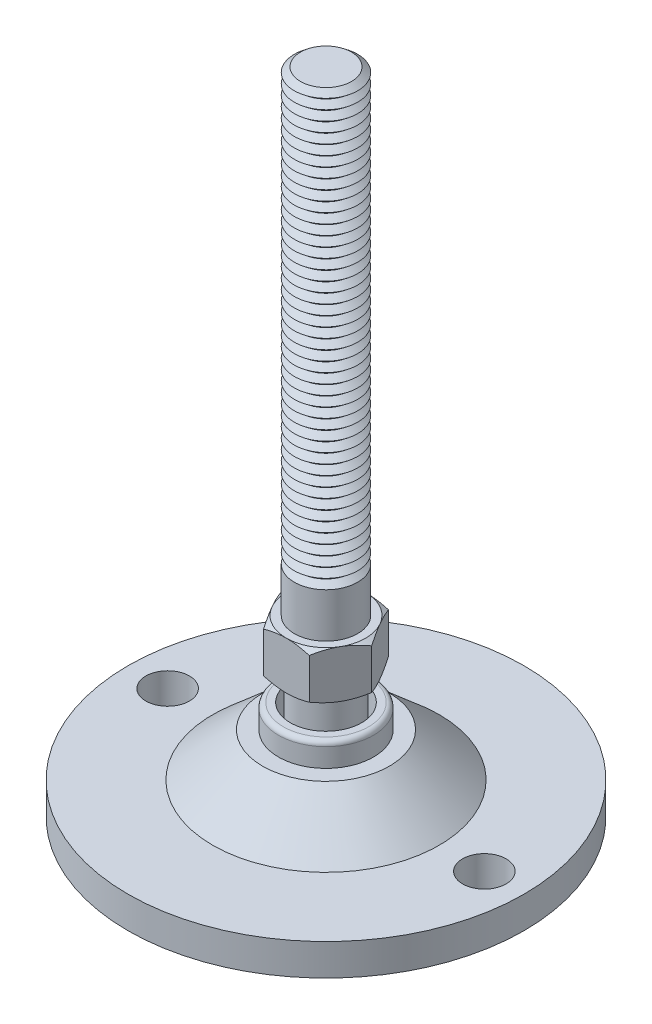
ISO-10303-21;
HEADER;
FILE_DESCRIPTION(('STEP AP214'),'2;1');
FILE_NAME('part.step','',(''),(''),'','','');
FILE_SCHEMA(('AUTOMOTIVE_DESIGN { 1 0 10303 214 1 1 1 1 }'));
ENDSEC;
DATA;
#1=APPLICATION_CONTEXT('core data for automotive mechanical design processes');
#2=APPLICATION_PROTOCOL_DEFINITION('international standard','automotive_design',2000,#1);
#3=PRODUCT_CONTEXT('',#1,'mechanical');
#4=PRODUCT('Part','Part','',(#3));
#5=PRODUCT_RELATED_PRODUCT_CATEGORY('part','',(#4));
#6=PRODUCT_DEFINITION_FORMATION('','',#4);
#7=PRODUCT_DEFINITION_CONTEXT('part definition',#1,'design');
#8=PRODUCT_DEFINITION('design','',#6,#7);
#9=PRODUCT_DEFINITION_SHAPE('','',#8);
#10=(LENGTH_UNIT() NAMED_UNIT(*) SI_UNIT(.MILLI.,.METRE.));
#11=(NAMED_UNIT(*) PLANE_ANGLE_UNIT() SI_UNIT($,.RADIAN.));
#12=(NAMED_UNIT(*) SI_UNIT($,.STERADIAN.) SOLID_ANGLE_UNIT());
#13=UNCERTAINTY_MEASURE_WITH_UNIT(LENGTH_MEASURE(1.E-05),#10,'distance_accuracy_value','');
#14=(GEOMETRIC_REPRESENTATION_CONTEXT(3) GLOBAL_UNCERTAINTY_ASSIGNED_CONTEXT((#13)) GLOBAL_UNIT_ASSIGNED_CONTEXT((#10,
#11,#12)) REPRESENTATION_CONTEXT('',''));
#15=CARTESIAN_POINT('',(0.,0.,0.));
#16=DIRECTION('',(0.,0.,1.));
#17=DIRECTION('',(1.,0.,0.));
#18=AXIS2_PLACEMENT_3D('',#15,#16,#17);
#19=CARTESIAN_POINT('',(0.,77.,0.));
#20=DIRECTION('',(0.,-1.,0.));
#21=DIRECTION('',(0.,0.,-1.));
#22=AXIS2_PLACEMENT_3D('',#19,#20,#21);
#23=CONICAL_SURFACE('',#22,3.2193752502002,0.895664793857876);
#24=CARTESIAN_POINT('',(0.,76.375,0.));
#25=DIRECTION('',(0.,-1.,0.));
#26=DIRECTION('',(0.,0.,-1.));
#27=AXIS2_PLACEMENT_3D('',#24,#25,#26);
#28=CIRCLE('',#27,4.);
#29=CARTESIAN_POINT('',(0.,76.375,-4.));
#30=VERTEX_POINT('',#29);
#31=EDGE_CURVE('P0_E1612',#30,#30,#28,.T.);
#32=ORIENTED_EDGE('',*,*,#31,.F.);
#33=EDGE_LOOP('',(#32));
#34=FACE_BOUND('',#33,.T.);
#35=CARTESIAN_POINT('',(0.,77.,0.));
#36=DIRECTION('',(0.,-1.,0.));
#37=DIRECTION('',(0.,0.,-1.));
#38=AXIS2_PLACEMENT_3D('',#35,#36,#37);
#39=CIRCLE('',#38,3.2193752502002);
#40=CARTESIAN_POINT('',(0.,77.,-3.2193752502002));
#41=VERTEX_POINT('',#40);
#42=EDGE_CURVE('P0_E1621',#41,#41,#39,.T.);
#43=ORIENTED_EDGE('',*,*,#42,.T.);
#44=EDGE_LOOP('',(#43));
#45=FACE_BOUND('',#44,.T.);
#46=ADVANCED_FACE('P0_F16',(#34,#45),#23,.T.);
#47=CARTESIAN_POINT('',(0.,77.625,0.));
#48=DIRECTION('',(0.,1.,0.));
#49=DIRECTION('',(0.,0.,1.));
#50=AXIS2_PLACEMENT_3D('',#47,#48,#49);
#51=CONICAL_SURFACE('',#50,4.,0.895664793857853);
#52=ORIENTED_EDGE('',*,*,#42,.F.);
#53=EDGE_LOOP('',(#52));
#54=FACE_BOUND('',#53,.T.);
#55=CARTESIAN_POINT('',(0.,77.625,0.));
#56=DIRECTION('',(0.,-1.,0.));
#57=DIRECTION('',(0.,0.,-1.));
#58=AXIS2_PLACEMENT_3D('',#55,#56,#57);
#59=CIRCLE('',#58,4.);
#60=CARTESIAN_POINT('',(0.,77.625,-4.));
#61=VERTEX_POINT('',#60);
#62=EDGE_CURVE('P0_E1618',#61,#61,#59,.T.);
#63=ORIENTED_EDGE('',*,*,#62,.T.);
#64=EDGE_LOOP('',(#63));
#65=FACE_BOUND('',#64,.T.);
#66=ADVANCED_FACE('P0_F308',(#54,#65),#51,.T.);
#67=CARTESIAN_POINT('',(0.,82.,0.));
#68=DIRECTION('',(0.,1.,0.));
#69=DIRECTION('',(0.,0.,1.));
#70=AXIS2_PLACEMENT_3D('',#67,#68,#69);
#71=PLANE('',#70);
#72=CARTESIAN_POINT('',(0.,82.,0.));
#73=DIRECTION('',(0.,-1.,0.));
#74=DIRECTION('',(0.,0.,-1.));
#75=AXIS2_PLACEMENT_3D('',#72,#73,#74);
#76=CIRCLE('',#75,3.2193752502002);
#77=CARTESIAN_POINT('',(0.,82.,-3.2193752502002));
#78=VERTEX_POINT('',#77);
#79=EDGE_CURVE('P0_E143',#78,#78,#76,.T.);
#80=ORIENTED_EDGE('',*,*,#79,.F.);
#81=EDGE_LOOP('',(#80));
#82=FACE_BOUND('',#81,.T.);
#83=ADVANCED_FACE('P0_F314',(#82),#71,.T.);
#84=CARTESIAN_POINT('',(0.,82.,0.));
#85=DIRECTION('',(0.,-1.,0.));
#86=DIRECTION('',(0.,0.,-1.));
#87=AXIS2_PLACEMENT_3D('',#84,#85,#86);
#88=CONICAL_SURFACE('',#87,3.2193752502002,0.895664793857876);
#89=CARTESIAN_POINT('',(0.,81.375,0.));
#90=DIRECTION('',(0.,-1.,0.));
#91=DIRECTION('',(0.,0.,-1.));
#92=AXIS2_PLACEMENT_3D('',#89,#90,#91);
#93=CIRCLE('',#92,4.);
#94=CARTESIAN_POINT('',(0.,81.375,-4.));
#95=VERTEX_POINT('',#94);
#96=EDGE_CURVE('P0_E353',#95,#95,#93,.T.);
#97=ORIENTED_EDGE('',*,*,#96,.F.);
#98=EDGE_LOOP('',(#97));
#99=FACE_BOUND('',#98,.T.);
#100=ORIENTED_EDGE('',*,*,#79,.T.);
#101=EDGE_LOOP('',(#100));
#102=FACE_BOUND('',#101,.T.);
#103=ADVANCED_FACE('P0_F211',(#99,#102),#88,.T.);
#104=CARTESIAN_POINT('',(0.,81.375,0.));
#105=DIRECTION('',(0.,1.,0.));
#106=DIRECTION('',(0.,0.,1.));
#107=AXIS2_PLACEMENT_3D('',#104,#105,#106);
#108=CONICAL_SURFACE('',#107,4.,0.895664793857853);
#109=CARTESIAN_POINT('',(0.,80.75,0.));
#110=DIRECTION('',(0.,-1.,0.));
#111=DIRECTION('',(0.,0.,-1.));
#112=AXIS2_PLACEMENT_3D('',#109,#110,#111);
#113=CIRCLE('',#112,3.2193752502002);
#114=CARTESIAN_POINT('',(0.,80.75,-3.2193752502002));
#115=VERTEX_POINT('',#114);
#116=EDGE_CURVE('P0_E352',#115,#115,#113,.T.);
#117=ORIENTED_EDGE('',*,*,#116,.F.);
#118=EDGE_LOOP('',(#117));
#119=FACE_BOUND('',#118,.T.);
#120=ORIENTED_EDGE('',*,*,#96,.T.);
#121=EDGE_LOOP('',(#120));
#122=FACE_BOUND('',#121,.T.);
#123=ADVANCED_FACE('P0_F339',(#119,#122),#108,.T.);
#124=CARTESIAN_POINT('',(0.,80.75,0.));
#125=DIRECTION('',(0.,-1.,0.));
#126=DIRECTION('',(0.,0.,-1.));
#127=AXIS2_PLACEMENT_3D('',#124,#125,#126);
#128=CONICAL_SURFACE('',#127,3.2193752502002,0.895664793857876);
#129=CARTESIAN_POINT('',(0.,80.125,0.));
#130=DIRECTION('',(0.,-1.,0.));
#131=DIRECTION('',(0.,0.,-1.));
#132=AXIS2_PLACEMENT_3D('',#129,#130,#131);
#133=CIRCLE('',#132,4.);
#134=CARTESIAN_POINT('',(0.,80.125,-4.));
#135=VERTEX_POINT('',#134);
#136=EDGE_CURVE('P0_E349',#135,#135,#133,.T.);
#137=ORIENTED_EDGE('',*,*,#136,.F.);
#138=EDGE_LOOP('',(#137));
#139=FACE_BOUND('',#138,.T.);
#140=ORIENTED_EDGE('',*,*,#116,.T.);
#141=EDGE_LOOP('',(#140));
#142=FACE_BOUND('',#141,.T.);
#143=ADVANCED_FACE('P0_F334',(#139,#142),#128,.T.);
#144=CARTESIAN_POINT('',(0.,80.125,0.));
#145=DIRECTION('',(0.,1.,0.));
#146=DIRECTION('',(0.,0.,1.));
#147=AXIS2_PLACEMENT_3D('',#144,#145,#146);
#148=CONICAL_SURFACE('',#147,4.,0.895664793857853);
#149=CARTESIAN_POINT('',(0.,79.5,0.));
#150=DIRECTION('',(0.,-1.,0.));
#151=DIRECTION('',(0.,0.,-1.));
#152=AXIS2_PLACEMENT_3D('',#149,#150,#151);
#153=CIRCLE('',#152,3.2193752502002);
#154=CARTESIAN_POINT('',(0.,79.5,-3.2193752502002));
#155=VERTEX_POINT('',#154);
#156=EDGE_CURVE('P0_E358',#155,#155,#153,.T.);
#157=ORIENTED_EDGE('',*,*,#156,.F.);
#158=EDGE_LOOP('',(#157));
#159=FACE_BOUND('',#158,.T.);
#160=ORIENTED_EDGE('',*,*,#136,.T.);
#161=EDGE_LOOP('',(#160));
#162=FACE_BOUND('',#161,.T.);
#163=ADVANCED_FACE('P0_F331',(#159,#162),#148,.T.);
#164=CARTESIAN_POINT('',(0.,79.5,0.));
#165=DIRECTION('',(0.,-1.,0.));
#166=DIRECTION('',(0.,0.,-1.));
#167=AXIS2_PLACEMENT_3D('',#164,#165,#166);
#168=CONICAL_SURFACE('',#167,3.2193752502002,0.895664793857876);
#169=CARTESIAN_POINT('',(0.,78.875,0.));
#170=DIRECTION('',(0.,-1.,0.));
#171=DIRECTION('',(0.,0.,-1.));
#172=AXIS2_PLACEMENT_3D('',#169,#170,#171);
#173=CIRCLE('',#172,4.);
#174=CARTESIAN_POINT('',(0.,78.875,-4.));
#175=VERTEX_POINT('',#174);
#176=EDGE_CURVE('P0_E1624',#175,#175,#173,.T.);
#177=ORIENTED_EDGE('',*,*,#176,.F.);
#178=EDGE_LOOP('',(#177));
#179=FACE_BOUND('',#178,.T.);
#180=ORIENTED_EDGE('',*,*,#156,.T.);
#181=EDGE_LOOP('',(#180));
#182=FACE_BOUND('',#181,.T.);
#183=ADVANCED_FACE('P0_F325',(#179,#182),#168,.T.);
#184=CARTESIAN_POINT('',(0.,78.875,0.));
#185=DIRECTION('',(0.,1.,0.));
#186=DIRECTION('',(0.,0.,1.));
#187=AXIS2_PLACEMENT_3D('',#184,#185,#186);
#188=CONICAL_SURFACE('',#187,4.,0.895664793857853);
#189=CARTESIAN_POINT('',(0.,78.25,0.));
#190=DIRECTION('',(0.,-1.,0.));
#191=DIRECTION('',(0.,0.,-1.));
#192=AXIS2_PLACEMENT_3D('',#189,#190,#191);
#193=CIRCLE('',#192,3.2193752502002);
#194=CARTESIAN_POINT('',(0.,78.25,-3.2193752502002));
#195=VERTEX_POINT('',#194);
#196=EDGE_CURVE('P0_E1627',#195,#195,#193,.T.);
#197=ORIENTED_EDGE('',*,*,#196,.F.);
#198=EDGE_LOOP('',(#197));
#199=FACE_BOUND('',#198,.T.);
#200=ORIENTED_EDGE('',*,*,#176,.T.);
#201=EDGE_LOOP('',(#200));
#202=FACE_BOUND('',#201,.T.);
#203=ADVANCED_FACE('P0_F321',(#199,#202),#188,.T.);
#204=CARTESIAN_POINT('',(0.,78.25,0.));
#205=DIRECTION('',(0.,-1.,0.));
#206=DIRECTION('',(0.,0.,-1.));
#207=AXIS2_PLACEMENT_3D('',#204,#205,#206);
#208=CONICAL_SURFACE('',#207,3.2193752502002,0.895664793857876);
#209=ORIENTED_EDGE('',*,*,#62,.F.);
#210=EDGE_LOOP('',(#209));
#211=FACE_BOUND('',#210,.T.);
#212=ORIENTED_EDGE('',*,*,#196,.T.);
#213=EDGE_LOOP('',(#212));
#214=FACE_BOUND('',#213,.T.);
#215=ADVANCED_FACE('P0_F324',(#211,#214),#208,.T.);
#216=CARTESIAN_POINT('',(0.,75.75,0.));
#217=DIRECTION('',(0.,-1.,0.));
#218=DIRECTION('',(0.,0.,-1.));
#219=AXIS2_PLACEMENT_3D('',#216,#217,#218);
#220=CONICAL_SURFACE('',#219,3.2193752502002,0.895664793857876);
#221=CARTESIAN_POINT('',(0.,75.125,0.));
#222=DIRECTION('',(0.,-1.,0.));
#223=DIRECTION('',(0.,0.,-1.));
#224=AXIS2_PLACEMENT_3D('',#221,#222,#223);
#225=CIRCLE('',#224,4.);
#226=CARTESIAN_POINT('',(0.,75.125,-4.));
#227=VERTEX_POINT('',#226);
#228=EDGE_CURVE('P0_E1606',#227,#227,#225,.T.);
#229=ORIENTED_EDGE('',*,*,#228,.F.);
#230=EDGE_LOOP('',(#229));
#231=FACE_BOUND('',#230,.T.);
#232=CARTESIAN_POINT('',(0.,75.75,0.));
#233=DIRECTION('',(0.,-1.,0.));
#234=DIRECTION('',(0.,0.,-1.));
#235=AXIS2_PLACEMENT_3D('',#232,#233,#234);
#236=CIRCLE('',#235,3.2193752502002);
#237=CARTESIAN_POINT('',(0.,75.75,-3.2193752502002));
#238=VERTEX_POINT('',#237);
#239=EDGE_CURVE('P0_E1615',#238,#238,#236,.T.);
#240=ORIENTED_EDGE('',*,*,#239,.T.);
#241=EDGE_LOOP('',(#240));
#242=FACE_BOUND('',#241,.T.);
#243=ADVANCED_FACE('P0_F329',(#231,#242),#220,.T.);
#244=CARTESIAN_POINT('',(0.,76.375,0.));
#245=DIRECTION('',(0.,1.,0.));
#246=DIRECTION('',(0.,0.,1.));
#247=AXIS2_PLACEMENT_3D('',#244,#245,#246);
#248=CONICAL_SURFACE('',#247,4.,0.895664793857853);
#249=ORIENTED_EDGE('',*,*,#239,.F.);
#250=EDGE_LOOP('',(#249));
#251=FACE_BOUND('',#250,.T.);
#252=ORIENTED_EDGE('',*,*,#31,.T.);
#253=EDGE_LOOP('',(#252));
#254=FACE_BOUND('',#253,.T.);
#255=ADVANCED_FACE('P0_F1284',(#251,#254),#248,.T.);
#256=CARTESIAN_POINT('',(0.,74.5,0.));
#257=DIRECTION('',(0.,-1.,0.));
#258=DIRECTION('',(0.,0.,-1.));
#259=AXIS2_PLACEMENT_3D('',#256,#257,#258);
#260=CONICAL_SURFACE('',#259,3.2193752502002,0.895664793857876);
#261=CARTESIAN_POINT('',(0.,73.875,0.));
#262=DIRECTION('',(0.,-1.,0.));
#263=DIRECTION('',(0.,0.,-1.));
#264=AXIS2_PLACEMENT_3D('',#261,#262,#263);
#265=CIRCLE('',#264,4.);
#266=CARTESIAN_POINT('',(0.,73.875,-4.));
#267=VERTEX_POINT('',#266);
#268=EDGE_CURVE('P0_E1600',#267,#267,#265,.T.);
#269=ORIENTED_EDGE('',*,*,#268,.F.);
#270=EDGE_LOOP('',(#269));
#271=FACE_BOUND('',#270,.T.);
#272=CARTESIAN_POINT('',(0.,74.5,0.));
#273=DIRECTION('',(0.,-1.,0.));
#274=DIRECTION('',(0.,0.,-1.));
#275=AXIS2_PLACEMENT_3D('',#272,#273,#274);
#276=CIRCLE('',#275,3.2193752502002);
#277=CARTESIAN_POINT('',(0.,74.5,-3.2193752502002));
#278=VERTEX_POINT('',#277);
#279=EDGE_CURVE('P0_E1609',#278,#278,#276,.T.);
#280=ORIENTED_EDGE('',*,*,#279,.T.);
#281=EDGE_LOOP('',(#280));
#282=FACE_BOUND('',#281,.T.);
#283=ADVANCED_FACE('P0_F1274',(#271,#282),#260,.T.);
#284=CARTESIAN_POINT('',(0.,75.125,0.));
#285=DIRECTION('',(0.,1.,0.));
#286=DIRECTION('',(0.,0.,1.));
#287=AXIS2_PLACEMENT_3D('',#284,#285,#286);
#288=CONICAL_SURFACE('',#287,4.,0.895664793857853);
#289=ORIENTED_EDGE('',*,*,#279,.F.);
#290=EDGE_LOOP('',(#289));
#291=FACE_BOUND('',#290,.T.);
#292=ORIENTED_EDGE('',*,*,#228,.T.);
#293=EDGE_LOOP('',(#292));
#294=FACE_BOUND('',#293,.T.);
#295=ADVANCED_FACE('P0_F1264',(#291,#294),#288,.T.);
#296=CARTESIAN_POINT('',(0.,73.25,0.));
#297=DIRECTION('',(0.,-1.,0.));
#298=DIRECTION('',(0.,0.,-1.));
#299=AXIS2_PLACEMENT_3D('',#296,#297,#298);
#300=CONICAL_SURFACE('',#299,3.2193752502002,0.895664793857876);
#301=CARTESIAN_POINT('',(0.,72.625,0.));
#302=DIRECTION('',(0.,-1.,0.));
#303=DIRECTION('',(0.,0.,-1.));
#304=AXIS2_PLACEMENT_3D('',#301,#302,#303);
#305=CIRCLE('',#304,4.);
#306=CARTESIAN_POINT('',(0.,72.625,-4.));
#307=VERTEX_POINT('',#306);
#308=EDGE_CURVE('P0_E1594',#307,#307,#305,.T.);
#309=ORIENTED_EDGE('',*,*,#308,.F.);
#310=EDGE_LOOP('',(#309));
#311=FACE_BOUND('',#310,.T.);
#312=CARTESIAN_POINT('',(0.,73.25,0.));
#313=DIRECTION('',(0.,-1.,0.));
#314=DIRECTION('',(0.,0.,-1.));
#315=AXIS2_PLACEMENT_3D('',#312,#313,#314);
#316=CIRCLE('',#315,3.2193752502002);
#317=CARTESIAN_POINT('',(0.,73.25,-3.2193752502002));
#318=VERTEX_POINT('',#317);
#319=EDGE_CURVE('P0_E1603',#318,#318,#316,.T.);
#320=ORIENTED_EDGE('',*,*,#319,.T.);
#321=EDGE_LOOP('',(#320));
#322=FACE_BOUND('',#321,.T.);
#323=ADVANCED_FACE('P0_F1254',(#311,#322),#300,.T.);
#324=CARTESIAN_POINT('',(0.,73.875,0.));
#325=DIRECTION('',(0.,1.,0.));
#326=DIRECTION('',(0.,0.,1.));
#327=AXIS2_PLACEMENT_3D('',#324,#325,#326);
#328=CONICAL_SURFACE('',#327,4.,0.895664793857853);
#329=ORIENTED_EDGE('',*,*,#319,.F.);
#330=EDGE_LOOP('',(#329));
#331=FACE_BOUND('',#330,.T.);
#332=ORIENTED_EDGE('',*,*,#268,.T.);
#333=EDGE_LOOP('',(#332));
#334=FACE_BOUND('',#333,.T.);
#335=ADVANCED_FACE('P0_F1244',(#331,#334),#328,.T.);
#336=CARTESIAN_POINT('',(0.,72.,0.));
#337=DIRECTION('',(0.,-1.,0.));
#338=DIRECTION('',(0.,0.,-1.));
#339=AXIS2_PLACEMENT_3D('',#336,#337,#338);
#340=CONICAL_SURFACE('',#339,3.2193752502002,0.895664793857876);
#341=CARTESIAN_POINT('',(0.,71.375,0.));
#342=DIRECTION('',(0.,-1.,0.));
#343=DIRECTION('',(0.,0.,-1.));
#344=AXIS2_PLACEMENT_3D('',#341,#342,#343);
#345=CIRCLE('',#344,4.);
#346=CARTESIAN_POINT('',(0.,71.375,-4.));
#347=VERTEX_POINT('',#346);
#348=EDGE_CURVE('P0_E1588',#347,#347,#345,.T.);
#349=ORIENTED_EDGE('',*,*,#348,.F.);
#350=EDGE_LOOP('',(#349));
#351=FACE_BOUND('',#350,.T.);
#352=CARTESIAN_POINT('',(0.,72.,0.));
#353=DIRECTION('',(0.,-1.,0.));
#354=DIRECTION('',(0.,0.,-1.));
#355=AXIS2_PLACEMENT_3D('',#352,#353,#354);
#356=CIRCLE('',#355,3.2193752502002);
#357=CARTESIAN_POINT('',(0.,72.,-3.2193752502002));
#358=VERTEX_POINT('',#357);
#359=EDGE_CURVE('P0_E1597',#358,#358,#356,.T.);
#360=ORIENTED_EDGE('',*,*,#359,.T.);
#361=EDGE_LOOP('',(#360));
#362=FACE_BOUND('',#361,.T.);
#363=ADVANCED_FACE('P0_F1234',(#351,#362),#340,.T.);
#364=CARTESIAN_POINT('',(0.,72.625,0.));
#365=DIRECTION('',(0.,1.,0.));
#366=DIRECTION('',(0.,0.,1.));
#367=AXIS2_PLACEMENT_3D('',#364,#365,#366);
#368=CONICAL_SURFACE('',#367,4.,0.895664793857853);
#369=ORIENTED_EDGE('',*,*,#359,.F.);
#370=EDGE_LOOP('',(#369));
#371=FACE_BOUND('',#370,.T.);
#372=ORIENTED_EDGE('',*,*,#308,.T.);
#373=EDGE_LOOP('',(#372));
#374=FACE_BOUND('',#373,.T.);
#375=ADVANCED_FACE('P0_F1224',(#371,#374),#368,.T.);
#376=CARTESIAN_POINT('',(0.,70.75,0.));
#377=DIRECTION('',(0.,-1.,0.));
#378=DIRECTION('',(0.,0.,-1.));
#379=AXIS2_PLACEMENT_3D('',#376,#377,#378);
#380=CONICAL_SURFACE('',#379,3.2193752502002,0.895664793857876);
#381=CARTESIAN_POINT('',(0.,70.125,0.));
#382=DIRECTION('',(0.,-1.,0.));
#383=DIRECTION('',(0.,0.,-1.));
#384=AXIS2_PLACEMENT_3D('',#381,#382,#383);
#385=CIRCLE('',#384,4.);
#386=CARTESIAN_POINT('',(0.,70.125,-4.));
#387=VERTEX_POINT('',#386);
#388=EDGE_CURVE('P0_E1582',#387,#387,#385,.T.);
#389=ORIENTED_EDGE('',*,*,#388,.F.);
#390=EDGE_LOOP('',(#389));
#391=FACE_BOUND('',#390,.T.);
#392=CARTESIAN_POINT('',(0.,70.75,0.));
#393=DIRECTION('',(0.,-1.,0.));
#394=DIRECTION('',(0.,0.,-1.));
#395=AXIS2_PLACEMENT_3D('',#392,#393,#394);
#396=CIRCLE('',#395,3.2193752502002);
#397=CARTESIAN_POINT('',(0.,70.75,-3.2193752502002));
#398=VERTEX_POINT('',#397);
#399=EDGE_CURVE('P0_E1591',#398,#398,#396,.T.);
#400=ORIENTED_EDGE('',*,*,#399,.T.);
#401=EDGE_LOOP('',(#400));
#402=FACE_BOUND('',#401,.T.);
#403=ADVANCED_FACE('P0_F1214',(#391,#402),#380,.T.);
#404=CARTESIAN_POINT('',(0.,71.375,0.));
#405=DIRECTION('',(0.,1.,0.));
#406=DIRECTION('',(0.,0.,1.));
#407=AXIS2_PLACEMENT_3D('',#404,#405,#406);
#408=CONICAL_SURFACE('',#407,4.,0.895664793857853);
#409=ORIENTED_EDGE('',*,*,#399,.F.);
#410=EDGE_LOOP('',(#409));
#411=FACE_BOUND('',#410,.T.);
#412=ORIENTED_EDGE('',*,*,#348,.T.);
#413=EDGE_LOOP('',(#412));
#414=FACE_BOUND('',#413,.T.);
#415=ADVANCED_FACE('P0_F1204',(#411,#414),#408,.T.);
#416=CARTESIAN_POINT('',(0.,69.5,0.));
#417=DIRECTION('',(0.,-1.,0.));
#418=DIRECTION('',(0.,0.,-1.));
#419=AXIS2_PLACEMENT_3D('',#416,#417,#418);
#420=CONICAL_SURFACE('',#419,3.2193752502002,0.895664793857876);
#421=CARTESIAN_POINT('',(0.,68.875,0.));
#422=DIRECTION('',(0.,-1.,0.));
#423=DIRECTION('',(0.,0.,-1.));
#424=AXIS2_PLACEMENT_3D('',#421,#422,#423);
#425=CIRCLE('',#424,4.);
#426=CARTESIAN_POINT('',(0.,68.875,-4.));
#427=VERTEX_POINT('',#426);
#428=EDGE_CURVE('P0_E1576',#427,#427,#425,.T.);
#429=ORIENTED_EDGE('',*,*,#428,.F.);
#430=EDGE_LOOP('',(#429));
#431=FACE_BOUND('',#430,.T.);
#432=CARTESIAN_POINT('',(0.,69.5,0.));
#433=DIRECTION('',(0.,-1.,0.));
#434=DIRECTION('',(0.,0.,-1.));
#435=AXIS2_PLACEMENT_3D('',#432,#433,#434);
#436=CIRCLE('',#435,3.2193752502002);
#437=CARTESIAN_POINT('',(0.,69.5,-3.2193752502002));
#438=VERTEX_POINT('',#437);
#439=EDGE_CURVE('P0_E1585',#438,#438,#436,.T.);
#440=ORIENTED_EDGE('',*,*,#439,.T.);
#441=EDGE_LOOP('',(#440));
#442=FACE_BOUND('',#441,.T.);
#443=ADVANCED_FACE('P0_F1194',(#431,#442),#420,.T.);
#444=CARTESIAN_POINT('',(0.,70.125,0.));
#445=DIRECTION('',(0.,1.,0.));
#446=DIRECTION('',(0.,0.,1.));
#447=AXIS2_PLACEMENT_3D('',#444,#445,#446);
#448=CONICAL_SURFACE('',#447,4.,0.895664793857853);
#449=ORIENTED_EDGE('',*,*,#439,.F.);
#450=EDGE_LOOP('',(#449));
#451=FACE_BOUND('',#450,.T.);
#452=ORIENTED_EDGE('',*,*,#388,.T.);
#453=EDGE_LOOP('',(#452));
#454=FACE_BOUND('',#453,.T.);
#455=ADVANCED_FACE('P0_F1184',(#451,#454),#448,.T.);
#456=CARTESIAN_POINT('',(0.,68.25,0.));
#457=DIRECTION('',(0.,-1.,0.));
#458=DIRECTION('',(0.,0.,-1.));
#459=AXIS2_PLACEMENT_3D('',#456,#457,#458);
#460=CONICAL_SURFACE('',#459,3.2193752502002,0.895664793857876);
#461=CARTESIAN_POINT('',(0.,67.625,0.));
#462=DIRECTION('',(0.,-1.,0.));
#463=DIRECTION('',(0.,0.,-1.));
#464=AXIS2_PLACEMENT_3D('',#461,#462,#463);
#465=CIRCLE('',#464,4.);
#466=CARTESIAN_POINT('',(0.,67.625,-4.));
#467=VERTEX_POINT('',#466);
#468=EDGE_CURVE('P0_E1570',#467,#467,#465,.T.);
#469=ORIENTED_EDGE('',*,*,#468,.F.);
#470=EDGE_LOOP('',(#469));
#471=FACE_BOUND('',#470,.T.);
#472=CARTESIAN_POINT('',(0.,68.25,0.));
#473=DIRECTION('',(0.,-1.,0.));
#474=DIRECTION('',(0.,0.,-1.));
#475=AXIS2_PLACEMENT_3D('',#472,#473,#474);
#476=CIRCLE('',#475,3.2193752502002);
#477=CARTESIAN_POINT('',(0.,68.25,-3.2193752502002));
#478=VERTEX_POINT('',#477);
#479=EDGE_CURVE('P0_E1579',#478,#478,#476,.T.);
#480=ORIENTED_EDGE('',*,*,#479,.T.);
#481=EDGE_LOOP('',(#480));
#482=FACE_BOUND('',#481,.T.);
#483=ADVANCED_FACE('P0_F1174',(#471,#482),#460,.T.);
#484=CARTESIAN_POINT('',(0.,68.875,0.));
#485=DIRECTION('',(0.,1.,0.));
#486=DIRECTION('',(0.,0.,1.));
#487=AXIS2_PLACEMENT_3D('',#484,#485,#486);
#488=CONICAL_SURFACE('',#487,4.,0.895664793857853);
#489=ORIENTED_EDGE('',*,*,#479,.F.);
#490=EDGE_LOOP('',(#489));
#491=FACE_BOUND('',#490,.T.);
#492=ORIENTED_EDGE('',*,*,#428,.T.);
#493=EDGE_LOOP('',(#492));
#494=FACE_BOUND('',#493,.T.);
#495=ADVANCED_FACE('P0_F1164',(#491,#494),#488,.T.);
#496=CARTESIAN_POINT('',(0.,67.,0.));
#497=DIRECTION('',(0.,-1.,0.));
#498=DIRECTION('',(0.,0.,-1.));
#499=AXIS2_PLACEMENT_3D('',#496,#497,#498);
#500=CONICAL_SURFACE('',#499,3.2193752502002,0.895664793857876);
#501=CARTESIAN_POINT('',(0.,66.375,0.));
#502=DIRECTION('',(0.,-1.,0.));
#503=DIRECTION('',(0.,0.,-1.));
#504=AXIS2_PLACEMENT_3D('',#501,#502,#503);
#505=CIRCLE('',#504,4.);
#506=CARTESIAN_POINT('',(0.,66.375,-4.));
#507=VERTEX_POINT('',#506);
#508=EDGE_CURVE('P0_E1564',#507,#507,#505,.T.);
#509=ORIENTED_EDGE('',*,*,#508,.F.);
#510=EDGE_LOOP('',(#509));
#511=FACE_BOUND('',#510,.T.);
#512=CARTESIAN_POINT('',(0.,67.,0.));
#513=DIRECTION('',(0.,-1.,0.));
#514=DIRECTION('',(0.,0.,-1.));
#515=AXIS2_PLACEMENT_3D('',#512,#513,#514);
#516=CIRCLE('',#515,3.2193752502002);
#517=CARTESIAN_POINT('',(0.,67.,-3.2193752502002));
#518=VERTEX_POINT('',#517);
#519=EDGE_CURVE('P0_E1573',#518,#518,#516,.T.);
#520=ORIENTED_EDGE('',*,*,#519,.T.);
#521=EDGE_LOOP('',(#520));
#522=FACE_BOUND('',#521,.T.);
#523=ADVANCED_FACE('P0_F1154',(#511,#522),#500,.T.);
#524=CARTESIAN_POINT('',(0.,67.625,0.));
#525=DIRECTION('',(0.,1.,0.));
#526=DIRECTION('',(0.,0.,1.));
#527=AXIS2_PLACEMENT_3D('',#524,#525,#526);
#528=CONICAL_SURFACE('',#527,4.,0.895664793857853);
#529=ORIENTED_EDGE('',*,*,#519,.F.);
#530=EDGE_LOOP('',(#529));
#531=FACE_BOUND('',#530,.T.);
#532=ORIENTED_EDGE('',*,*,#468,.T.);
#533=EDGE_LOOP('',(#532));
#534=FACE_BOUND('',#533,.T.);
#535=ADVANCED_FACE('P0_F1144',(#531,#534),#528,.T.);
#536=CARTESIAN_POINT('',(0.,65.75,0.));
#537=DIRECTION('',(0.,-1.,0.));
#538=DIRECTION('',(0.,0.,-1.));
#539=AXIS2_PLACEMENT_3D('',#536,#537,#538);
#540=CONICAL_SURFACE('',#539,3.2193752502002,0.895664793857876);
#541=CARTESIAN_POINT('',(0.,65.125,0.));
#542=DIRECTION('',(0.,-1.,0.));
#543=DIRECTION('',(0.,0.,-1.));
#544=AXIS2_PLACEMENT_3D('',#541,#542,#543);
#545=CIRCLE('',#544,4.);
#546=CARTESIAN_POINT('',(0.,65.125,-4.));
#547=VERTEX_POINT('',#546);
#548=EDGE_CURVE('P0_E1558',#547,#547,#545,.T.);
#549=ORIENTED_EDGE('',*,*,#548,.F.);
#550=EDGE_LOOP('',(#549));
#551=FACE_BOUND('',#550,.T.);
#552=CARTESIAN_POINT('',(0.,65.75,0.));
#553=DIRECTION('',(0.,-1.,0.));
#554=DIRECTION('',(0.,0.,-1.));
#555=AXIS2_PLACEMENT_3D('',#552,#553,#554);
#556=CIRCLE('',#555,3.2193752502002);
#557=CARTESIAN_POINT('',(0.,65.75,-3.2193752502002));
#558=VERTEX_POINT('',#557);
#559=EDGE_CURVE('P0_E1567',#558,#558,#556,.T.);
#560=ORIENTED_EDGE('',*,*,#559,.T.);
#561=EDGE_LOOP('',(#560));
#562=FACE_BOUND('',#561,.T.);
#563=ADVANCED_FACE('P0_F1134',(#551,#562),#540,.T.);
#564=CARTESIAN_POINT('',(0.,66.375,0.));
#565=DIRECTION('',(0.,1.,0.));
#566=DIRECTION('',(0.,0.,1.));
#567=AXIS2_PLACEMENT_3D('',#564,#565,#566);
#568=CONICAL_SURFACE('',#567,4.,0.895664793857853);
#569=ORIENTED_EDGE('',*,*,#559,.F.);
#570=EDGE_LOOP('',(#569));
#571=FACE_BOUND('',#570,.T.);
#572=ORIENTED_EDGE('',*,*,#508,.T.);
#573=EDGE_LOOP('',(#572));
#574=FACE_BOUND('',#573,.T.);
#575=ADVANCED_FACE('P0_F1124',(#571,#574),#568,.T.);
#576=CARTESIAN_POINT('',(0.,64.5,0.));
#577=DIRECTION('',(0.,-1.,0.));
#578=DIRECTION('',(0.,0.,-1.));
#579=AXIS2_PLACEMENT_3D('',#576,#577,#578);
#580=CONICAL_SURFACE('',#579,3.2193752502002,0.895664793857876);
#581=CARTESIAN_POINT('',(0.,63.875,0.));
#582=DIRECTION('',(0.,-1.,0.));
#583=DIRECTION('',(0.,0.,-1.));
#584=AXIS2_PLACEMENT_3D('',#581,#582,#583);
#585=CIRCLE('',#584,4.);
#586=CARTESIAN_POINT('',(0.,63.875,-4.));
#587=VERTEX_POINT('',#586);
#588=EDGE_CURVE('P0_E1552',#587,#587,#585,.T.);
#589=ORIENTED_EDGE('',*,*,#588,.F.);
#590=EDGE_LOOP('',(#589));
#591=FACE_BOUND('',#590,.T.);
#592=CARTESIAN_POINT('',(0.,64.5,0.));
#593=DIRECTION('',(0.,-1.,0.));
#594=DIRECTION('',(0.,0.,-1.));
#595=AXIS2_PLACEMENT_3D('',#592,#593,#594);
#596=CIRCLE('',#595,3.2193752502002);
#597=CARTESIAN_POINT('',(0.,64.5,-3.2193752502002));
#598=VERTEX_POINT('',#597);
#599=EDGE_CURVE('P0_E1561',#598,#598,#596,.T.);
#600=ORIENTED_EDGE('',*,*,#599,.T.);
#601=EDGE_LOOP('',(#600));
#602=FACE_BOUND('',#601,.T.);
#603=ADVANCED_FACE('P0_F1114',(#591,#602),#580,.T.);
#604=CARTESIAN_POINT('',(0.,65.125,0.));
#605=DIRECTION('',(0.,1.,0.));
#606=DIRECTION('',(0.,0.,1.));
#607=AXIS2_PLACEMENT_3D('',#604,#605,#606);
#608=CONICAL_SURFACE('',#607,4.,0.895664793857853);
#609=ORIENTED_EDGE('',*,*,#599,.F.);
#610=EDGE_LOOP('',(#609));
#611=FACE_BOUND('',#610,.T.);
#612=ORIENTED_EDGE('',*,*,#548,.T.);
#613=EDGE_LOOP('',(#612));
#614=FACE_BOUND('',#613,.T.);
#615=ADVANCED_FACE('P0_F1104',(#611,#614),#608,.T.);
#616=CARTESIAN_POINT('',(0.,63.25,0.));
#617=DIRECTION('',(0.,-1.,0.));
#618=DIRECTION('',(0.,0.,-1.));
#619=AXIS2_PLACEMENT_3D('',#616,#617,#618);
#620=CONICAL_SURFACE('',#619,3.2193752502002,0.895664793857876);
#621=CARTESIAN_POINT('',(0.,62.625,0.));
#622=DIRECTION('',(0.,-1.,0.));
#623=DIRECTION('',(0.,0.,-1.));
#624=AXIS2_PLACEMENT_3D('',#621,#622,#623);
#625=CIRCLE('',#624,4.);
#626=CARTESIAN_POINT('',(0.,62.625,-4.));
#627=VERTEX_POINT('',#626);
#628=EDGE_CURVE('P0_E1546',#627,#627,#625,.T.);
#629=ORIENTED_EDGE('',*,*,#628,.F.);
#630=EDGE_LOOP('',(#629));
#631=FACE_BOUND('',#630,.T.);
#632=CARTESIAN_POINT('',(0.,63.25,0.));
#633=DIRECTION('',(0.,-1.,0.));
#634=DIRECTION('',(0.,0.,-1.));
#635=AXIS2_PLACEMENT_3D('',#632,#633,#634);
#636=CIRCLE('',#635,3.2193752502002);
#637=CARTESIAN_POINT('',(0.,63.25,-3.2193752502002));
#638=VERTEX_POINT('',#637);
#639=EDGE_CURVE('P0_E1555',#638,#638,#636,.T.);
#640=ORIENTED_EDGE('',*,*,#639,.T.);
#641=EDGE_LOOP('',(#640));
#642=FACE_BOUND('',#641,.T.);
#643=ADVANCED_FACE('P0_F1094',(#631,#642),#620,.T.);
#644=CARTESIAN_POINT('',(0.,63.875,0.));
#645=DIRECTION('',(0.,1.,0.));
#646=DIRECTION('',(0.,0.,1.));
#647=AXIS2_PLACEMENT_3D('',#644,#645,#646);
#648=CONICAL_SURFACE('',#647,4.,0.895664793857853);
#649=ORIENTED_EDGE('',*,*,#639,.F.);
#650=EDGE_LOOP('',(#649));
#651=FACE_BOUND('',#650,.T.);
#652=ORIENTED_EDGE('',*,*,#588,.T.);
#653=EDGE_LOOP('',(#652));
#654=FACE_BOUND('',#653,.T.);
#655=ADVANCED_FACE('P0_F1084',(#651,#654),#648,.T.);
#656=CARTESIAN_POINT('',(0.,62.,0.));
#657=DIRECTION('',(0.,-1.,0.));
#658=DIRECTION('',(0.,0.,-1.));
#659=AXIS2_PLACEMENT_3D('',#656,#657,#658);
#660=CONICAL_SURFACE('',#659,3.2193752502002,0.895664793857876);
#661=CARTESIAN_POINT('',(0.,61.375,0.));
#662=DIRECTION('',(0.,-1.,0.));
#663=DIRECTION('',(0.,0.,-1.));
#664=AXIS2_PLACEMENT_3D('',#661,#662,#663);
#665=CIRCLE('',#664,4.);
#666=CARTESIAN_POINT('',(0.,61.375,-4.));
#667=VERTEX_POINT('',#666);
#668=EDGE_CURVE('P0_E1540',#667,#667,#665,.T.);
#669=ORIENTED_EDGE('',*,*,#668,.F.);
#670=EDGE_LOOP('',(#669));
#671=FACE_BOUND('',#670,.T.);
#672=CARTESIAN_POINT('',(0.,62.,0.));
#673=DIRECTION('',(0.,-1.,0.));
#674=DIRECTION('',(0.,0.,-1.));
#675=AXIS2_PLACEMENT_3D('',#672,#673,#674);
#676=CIRCLE('',#675,3.2193752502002);
#677=CARTESIAN_POINT('',(0.,62.,-3.2193752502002));
#678=VERTEX_POINT('',#677);
#679=EDGE_CURVE('P0_E1549',#678,#678,#676,.T.);
#680=ORIENTED_EDGE('',*,*,#679,.T.);
#681=EDGE_LOOP('',(#680));
#682=FACE_BOUND('',#681,.T.);
#683=ADVANCED_FACE('P0_F1074',(#671,#682),#660,.T.);
#684=CARTESIAN_POINT('',(0.,62.625,0.));
#685=DIRECTION('',(0.,1.,0.));
#686=DIRECTION('',(0.,0.,1.));
#687=AXIS2_PLACEMENT_3D('',#684,#685,#686);
#688=CONICAL_SURFACE('',#687,4.,0.895664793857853);
#689=ORIENTED_EDGE('',*,*,#679,.F.);
#690=EDGE_LOOP('',(#689));
#691=FACE_BOUND('',#690,.T.);
#692=ORIENTED_EDGE('',*,*,#628,.T.);
#693=EDGE_LOOP('',(#692));
#694=FACE_BOUND('',#693,.T.);
#695=ADVANCED_FACE('P0_F1064',(#691,#694),#688,.T.);
#696=CARTESIAN_POINT('',(0.,60.75,0.));
#697=DIRECTION('',(0.,-1.,0.));
#698=DIRECTION('',(0.,0.,-1.));
#699=AXIS2_PLACEMENT_3D('',#696,#697,#698);
#700=CONICAL_SURFACE('',#699,3.2193752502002,0.895664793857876);
#701=CARTESIAN_POINT('',(0.,60.125,0.));
#702=DIRECTION('',(0.,-1.,0.));
#703=DIRECTION('',(0.,0.,-1.));
#704=AXIS2_PLACEMENT_3D('',#701,#702,#703);
#705=CIRCLE('',#704,4.);
#706=CARTESIAN_POINT('',(0.,60.125,-4.));
#707=VERTEX_POINT('',#706);
#708=EDGE_CURVE('P0_E1534',#707,#707,#705,.T.);
#709=ORIENTED_EDGE('',*,*,#708,.F.);
#710=EDGE_LOOP('',(#709));
#711=FACE_BOUND('',#710,.T.);
#712=CARTESIAN_POINT('',(0.,60.75,0.));
#713=DIRECTION('',(0.,-1.,0.));
#714=DIRECTION('',(0.,0.,-1.));
#715=AXIS2_PLACEMENT_3D('',#712,#713,#714);
#716=CIRCLE('',#715,3.2193752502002);
#717=CARTESIAN_POINT('',(0.,60.75,-3.2193752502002));
#718=VERTEX_POINT('',#717);
#719=EDGE_CURVE('P0_E1543',#718,#718,#716,.T.);
#720=ORIENTED_EDGE('',*,*,#719,.T.);
#721=EDGE_LOOP('',(#720));
#722=FACE_BOUND('',#721,.T.);
#723=ADVANCED_FACE('P0_F1054',(#711,#722),#700,.T.);
#724=CARTESIAN_POINT('',(0.,61.375,0.));
#725=DIRECTION('',(0.,1.,0.));
#726=DIRECTION('',(0.,0.,1.));
#727=AXIS2_PLACEMENT_3D('',#724,#725,#726);
#728=CONICAL_SURFACE('',#727,4.,0.895664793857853);
#729=ORIENTED_EDGE('',*,*,#719,.F.);
#730=EDGE_LOOP('',(#729));
#731=FACE_BOUND('',#730,.T.);
#732=ORIENTED_EDGE('',*,*,#668,.T.);
#733=EDGE_LOOP('',(#732));
#734=FACE_BOUND('',#733,.T.);
#735=ADVANCED_FACE('P0_F1044',(#731,#734),#728,.T.);
#736=CARTESIAN_POINT('',(0.,59.5,0.));
#737=DIRECTION('',(0.,-1.,0.));
#738=DIRECTION('',(0.,0.,-1.));
#739=AXIS2_PLACEMENT_3D('',#736,#737,#738);
#740=CONICAL_SURFACE('',#739,3.2193752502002,0.895664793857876);
#741=CARTESIAN_POINT('',(0.,58.875,0.));
#742=DIRECTION('',(0.,-1.,0.));
#743=DIRECTION('',(0.,0.,-1.));
#744=AXIS2_PLACEMENT_3D('',#741,#742,#743);
#745=CIRCLE('',#744,4.);
#746=CARTESIAN_POINT('',(0.,58.875,-4.));
#747=VERTEX_POINT('',#746);
#748=EDGE_CURVE('P0_E1528',#747,#747,#745,.T.);
#749=ORIENTED_EDGE('',*,*,#748,.F.);
#750=EDGE_LOOP('',(#749));
#751=FACE_BOUND('',#750,.T.);
#752=CARTESIAN_POINT('',(0.,59.5,0.));
#753=DIRECTION('',(0.,-1.,0.));
#754=DIRECTION('',(0.,0.,-1.));
#755=AXIS2_PLACEMENT_3D('',#752,#753,#754);
#756=CIRCLE('',#755,3.2193752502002);
#757=CARTESIAN_POINT('',(0.,59.5,-3.2193752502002));
#758=VERTEX_POINT('',#757);
#759=EDGE_CURVE('P0_E1537',#758,#758,#756,.T.);
#760=ORIENTED_EDGE('',*,*,#759,.T.);
#761=EDGE_LOOP('',(#760));
#762=FACE_BOUND('',#761,.T.);
#763=ADVANCED_FACE('P0_F1034',(#751,#762),#740,.T.);
#764=CARTESIAN_POINT('',(0.,60.125,0.));
#765=DIRECTION('',(0.,1.,0.));
#766=DIRECTION('',(0.,0.,1.));
#767=AXIS2_PLACEMENT_3D('',#764,#765,#766);
#768=CONICAL_SURFACE('',#767,4.,0.895664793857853);
#769=ORIENTED_EDGE('',*,*,#759,.F.);
#770=EDGE_LOOP('',(#769));
#771=FACE_BOUND('',#770,.T.);
#772=ORIENTED_EDGE('',*,*,#708,.T.);
#773=EDGE_LOOP('',(#772));
#774=FACE_BOUND('',#773,.T.);
#775=ADVANCED_FACE('P0_F1024',(#771,#774),#768,.T.);
#776=CARTESIAN_POINT('',(0.,58.25,0.));
#777=DIRECTION('',(0.,-1.,0.));
#778=DIRECTION('',(0.,0.,-1.));
#779=AXIS2_PLACEMENT_3D('',#776,#777,#778);
#780=CONICAL_SURFACE('',#779,3.2193752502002,0.895664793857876);
#781=CARTESIAN_POINT('',(0.,57.625,0.));
#782=DIRECTION('',(0.,-1.,0.));
#783=DIRECTION('',(0.,0.,-1.));
#784=AXIS2_PLACEMENT_3D('',#781,#782,#783);
#785=CIRCLE('',#784,4.);
#786=CARTESIAN_POINT('',(0.,57.625,-4.));
#787=VERTEX_POINT('',#786);
#788=EDGE_CURVE('P0_E1522',#787,#787,#785,.T.);
#789=ORIENTED_EDGE('',*,*,#788,.F.);
#790=EDGE_LOOP('',(#789));
#791=FACE_BOUND('',#790,.T.);
#792=CARTESIAN_POINT('',(0.,58.25,0.));
#793=DIRECTION('',(0.,-1.,0.));
#794=DIRECTION('',(0.,0.,-1.));
#795=AXIS2_PLACEMENT_3D('',#792,#793,#794);
#796=CIRCLE('',#795,3.2193752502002);
#797=CARTESIAN_POINT('',(0.,58.25,-3.2193752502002));
#798=VERTEX_POINT('',#797);
#799=EDGE_CURVE('P0_E1531',#798,#798,#796,.T.);
#800=ORIENTED_EDGE('',*,*,#799,.T.);
#801=EDGE_LOOP('',(#800));
#802=FACE_BOUND('',#801,.T.);
#803=ADVANCED_FACE('P0_F1014',(#791,#802),#780,.T.);
#804=CARTESIAN_POINT('',(0.,58.875,0.));
#805=DIRECTION('',(0.,1.,0.));
#806=DIRECTION('',(0.,0.,1.));
#807=AXIS2_PLACEMENT_3D('',#804,#805,#806);
#808=CONICAL_SURFACE('',#807,4.,0.895664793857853);
#809=ORIENTED_EDGE('',*,*,#799,.F.);
#810=EDGE_LOOP('',(#809));
#811=FACE_BOUND('',#810,.T.);
#812=ORIENTED_EDGE('',*,*,#748,.T.);
#813=EDGE_LOOP('',(#812));
#814=FACE_BOUND('',#813,.T.);
#815=ADVANCED_FACE('P0_F1004',(#811,#814),#808,.T.);
#816=CARTESIAN_POINT('',(0.,57.,0.));
#817=DIRECTION('',(0.,-1.,0.));
#818=DIRECTION('',(0.,0.,-1.));
#819=AXIS2_PLACEMENT_3D('',#816,#817,#818);
#820=CONICAL_SURFACE('',#819,3.2193752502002,0.895664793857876);
#821=CARTESIAN_POINT('',(0.,56.375,0.));
#822=DIRECTION('',(0.,-1.,0.));
#823=DIRECTION('',(0.,0.,-1.));
#824=AXIS2_PLACEMENT_3D('',#821,#822,#823);
#825=CIRCLE('',#824,4.);
#826=CARTESIAN_POINT('',(0.,56.375,-4.));
#827=VERTEX_POINT('',#826);
#828=EDGE_CURVE('P0_E1516',#827,#827,#825,.T.);
#829=ORIENTED_EDGE('',*,*,#828,.F.);
#830=EDGE_LOOP('',(#829));
#831=FACE_BOUND('',#830,.T.);
#832=CARTESIAN_POINT('',(0.,57.,0.));
#833=DIRECTION('',(0.,-1.,0.));
#834=DIRECTION('',(0.,0.,-1.));
#835=AXIS2_PLACEMENT_3D('',#832,#833,#834);
#836=CIRCLE('',#835,3.2193752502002);
#837=CARTESIAN_POINT('',(0.,57.,-3.2193752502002));
#838=VERTEX_POINT('',#837);
#839=EDGE_CURVE('P0_E1525',#838,#838,#836,.T.);
#840=ORIENTED_EDGE('',*,*,#839,.T.);
#841=EDGE_LOOP('',(#840));
#842=FACE_BOUND('',#841,.T.);
#843=ADVANCED_FACE('P0_F994',(#831,#842),#820,.T.);
#844=CARTESIAN_POINT('',(0.,57.625,0.));
#845=DIRECTION('',(0.,1.,0.));
#846=DIRECTION('',(0.,0.,1.));
#847=AXIS2_PLACEMENT_3D('',#844,#845,#846);
#848=CONICAL_SURFACE('',#847,4.,0.895664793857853);
#849=ORIENTED_EDGE('',*,*,#839,.F.);
#850=EDGE_LOOP('',(#849));
#851=FACE_BOUND('',#850,.T.);
#852=ORIENTED_EDGE('',*,*,#788,.T.);
#853=EDGE_LOOP('',(#852));
#854=FACE_BOUND('',#853,.T.);
#855=ADVANCED_FACE('P0_F984',(#851,#854),#848,.T.);
#856=CARTESIAN_POINT('',(0.,55.75,0.));
#857=DIRECTION('',(0.,-1.,0.));
#858=DIRECTION('',(0.,0.,-1.));
#859=AXIS2_PLACEMENT_3D('',#856,#857,#858);
#860=CONICAL_SURFACE('',#859,3.2193752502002,0.895664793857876);
#861=CARTESIAN_POINT('',(0.,55.125,0.));
#862=DIRECTION('',(0.,-1.,0.));
#863=DIRECTION('',(0.,0.,-1.));
#864=AXIS2_PLACEMENT_3D('',#861,#862,#863);
#865=CIRCLE('',#864,4.);
#866=CARTESIAN_POINT('',(0.,55.125,-4.));
#867=VERTEX_POINT('',#866);
#868=EDGE_CURVE('P0_E1510',#867,#867,#865,.T.);
#869=ORIENTED_EDGE('',*,*,#868,.F.);
#870=EDGE_LOOP('',(#869));
#871=FACE_BOUND('',#870,.T.);
#872=CARTESIAN_POINT('',(0.,55.75,0.));
#873=DIRECTION('',(0.,-1.,0.));
#874=DIRECTION('',(0.,0.,-1.));
#875=AXIS2_PLACEMENT_3D('',#872,#873,#874);
#876=CIRCLE('',#875,3.2193752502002);
#877=CARTESIAN_POINT('',(0.,55.75,-3.2193752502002));
#878=VERTEX_POINT('',#877);
#879=EDGE_CURVE('P0_E1519',#878,#878,#876,.T.);
#880=ORIENTED_EDGE('',*,*,#879,.T.);
#881=EDGE_LOOP('',(#880));
#882=FACE_BOUND('',#881,.T.);
#883=ADVANCED_FACE('P0_F974',(#871,#882),#860,.T.);
#884=CARTESIAN_POINT('',(0.,56.375,0.));
#885=DIRECTION('',(0.,1.,0.));
#886=DIRECTION('',(0.,0.,1.));
#887=AXIS2_PLACEMENT_3D('',#884,#885,#886);
#888=CONICAL_SURFACE('',#887,4.,0.895664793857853);
#889=ORIENTED_EDGE('',*,*,#879,.F.);
#890=EDGE_LOOP('',(#889));
#891=FACE_BOUND('',#890,.T.);
#892=ORIENTED_EDGE('',*,*,#828,.T.);
#893=EDGE_LOOP('',(#892));
#894=FACE_BOUND('',#893,.T.);
#895=ADVANCED_FACE('P0_F964',(#891,#894),#888,.T.);
#896=CARTESIAN_POINT('',(0.,54.5,0.));
#897=DIRECTION('',(0.,-1.,0.));
#898=DIRECTION('',(0.,0.,-1.));
#899=AXIS2_PLACEMENT_3D('',#896,#897,#898);
#900=CONICAL_SURFACE('',#899,3.2193752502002,0.895664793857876);
#901=CARTESIAN_POINT('',(0.,53.875,0.));
#902=DIRECTION('',(0.,-1.,0.));
#903=DIRECTION('',(0.,0.,-1.));
#904=AXIS2_PLACEMENT_3D('',#901,#902,#903);
#905=CIRCLE('',#904,4.);
#906=CARTESIAN_POINT('',(0.,53.875,-4.));
#907=VERTEX_POINT('',#906);
#908=EDGE_CURVE('P0_E1504',#907,#907,#905,.T.);
#909=ORIENTED_EDGE('',*,*,#908,.F.);
#910=EDGE_LOOP('',(#909));
#911=FACE_BOUND('',#910,.T.);
#912=CARTESIAN_POINT('',(0.,54.5,0.));
#913=DIRECTION('',(0.,-1.,0.));
#914=DIRECTION('',(0.,0.,-1.));
#915=AXIS2_PLACEMENT_3D('',#912,#913,#914);
#916=CIRCLE('',#915,3.2193752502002);
#917=CARTESIAN_POINT('',(0.,54.5,-3.2193752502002));
#918=VERTEX_POINT('',#917);
#919=EDGE_CURVE('P0_E1513',#918,#918,#916,.T.);
#920=ORIENTED_EDGE('',*,*,#919,.T.);
#921=EDGE_LOOP('',(#920));
#922=FACE_BOUND('',#921,.T.);
#923=ADVANCED_FACE('P0_F954',(#911,#922),#900,.T.);
#924=CARTESIAN_POINT('',(0.,55.125,0.));
#925=DIRECTION('',(0.,1.,0.));
#926=DIRECTION('',(0.,0.,1.));
#927=AXIS2_PLACEMENT_3D('',#924,#925,#926);
#928=CONICAL_SURFACE('',#927,4.,0.895664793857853);
#929=ORIENTED_EDGE('',*,*,#919,.F.);
#930=EDGE_LOOP('',(#929));
#931=FACE_BOUND('',#930,.T.);
#932=ORIENTED_EDGE('',*,*,#868,.T.);
#933=EDGE_LOOP('',(#932));
#934=FACE_BOUND('',#933,.T.);
#935=ADVANCED_FACE('P0_F944',(#931,#934),#928,.T.);
#936=CARTESIAN_POINT('',(0.,53.25,0.));
#937=DIRECTION('',(0.,-1.,0.));
#938=DIRECTION('',(0.,0.,-1.));
#939=AXIS2_PLACEMENT_3D('',#936,#937,#938);
#940=CONICAL_SURFACE('',#939,3.2193752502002,0.895664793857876);
#941=CARTESIAN_POINT('',(0.,52.625,0.));
#942=DIRECTION('',(0.,-1.,0.));
#943=DIRECTION('',(0.,0.,-1.));
#944=AXIS2_PLACEMENT_3D('',#941,#942,#943);
#945=CIRCLE('',#944,4.);
#946=CARTESIAN_POINT('',(0.,52.625,-4.));
#947=VERTEX_POINT('',#946);
#948=EDGE_CURVE('P0_E1498',#947,#947,#945,.T.);
#949=ORIENTED_EDGE('',*,*,#948,.F.);
#950=EDGE_LOOP('',(#949));
#951=FACE_BOUND('',#950,.T.);
#952=CARTESIAN_POINT('',(0.,53.25,0.));
#953=DIRECTION('',(0.,-1.,0.));
#954=DIRECTION('',(0.,0.,-1.));
#955=AXIS2_PLACEMENT_3D('',#952,#953,#954);
#956=CIRCLE('',#955,3.2193752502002);
#957=CARTESIAN_POINT('',(0.,53.25,-3.2193752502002));
#958=VERTEX_POINT('',#957);
#959=EDGE_CURVE('P0_E1507',#958,#958,#956,.T.);
#960=ORIENTED_EDGE('',*,*,#959,.T.);
#961=EDGE_LOOP('',(#960));
#962=FACE_BOUND('',#961,.T.);
#963=ADVANCED_FACE('P0_F934',(#951,#962),#940,.T.);
#964=CARTESIAN_POINT('',(0.,53.875,0.));
#965=DIRECTION('',(0.,1.,0.));
#966=DIRECTION('',(0.,0.,1.));
#967=AXIS2_PLACEMENT_3D('',#964,#965,#966);
#968=CONICAL_SURFACE('',#967,4.,0.895664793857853);
#969=ORIENTED_EDGE('',*,*,#959,.F.);
#970=EDGE_LOOP('',(#969));
#971=FACE_BOUND('',#970,.T.);
#972=ORIENTED_EDGE('',*,*,#908,.T.);
#973=EDGE_LOOP('',(#972));
#974=FACE_BOUND('',#973,.T.);
#975=ADVANCED_FACE('P0_F924',(#971,#974),#968,.T.);
#976=CARTESIAN_POINT('',(0.,52.,0.));
#977=DIRECTION('',(0.,-1.,0.));
#978=DIRECTION('',(0.,0.,-1.));
#979=AXIS2_PLACEMENT_3D('',#976,#977,#978);
#980=CONICAL_SURFACE('',#979,3.2193752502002,0.895664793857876);
#981=CARTESIAN_POINT('',(0.,51.375,0.));
#982=DIRECTION('',(0.,-1.,0.));
#983=DIRECTION('',(0.,0.,-1.));
#984=AXIS2_PLACEMENT_3D('',#981,#982,#983);
#985=CIRCLE('',#984,4.);
#986=CARTESIAN_POINT('',(0.,51.375,-4.));
#987=VERTEX_POINT('',#986);
#988=EDGE_CURVE('P0_E1492',#987,#987,#985,.T.);
#989=ORIENTED_EDGE('',*,*,#988,.F.);
#990=EDGE_LOOP('',(#989));
#991=FACE_BOUND('',#990,.T.);
#992=CARTESIAN_POINT('',(0.,52.,0.));
#993=DIRECTION('',(0.,-1.,0.));
#994=DIRECTION('',(0.,0.,-1.));
#995=AXIS2_PLACEMENT_3D('',#992,#993,#994);
#996=CIRCLE('',#995,3.2193752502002);
#997=CARTESIAN_POINT('',(0.,52.,-3.2193752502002));
#998=VERTEX_POINT('',#997);
#999=EDGE_CURVE('P0_E1501',#998,#998,#996,.T.);
#1000=ORIENTED_EDGE('',*,*,#999,.T.);
#1001=EDGE_LOOP('',(#1000));
#1002=FACE_BOUND('',#1001,.T.);
#1003=ADVANCED_FACE('P0_F914',(#991,#1002),#980,.T.);
#1004=CARTESIAN_POINT('',(0.,52.625,0.));
#1005=DIRECTION('',(0.,1.,0.));
#1006=DIRECTION('',(0.,0.,1.));
#1007=AXIS2_PLACEMENT_3D('',#1004,#1005,#1006);
#1008=CONICAL_SURFACE('',#1007,4.,0.895664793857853);
#1009=ORIENTED_EDGE('',*,*,#999,.F.);
#1010=EDGE_LOOP('',(#1009));
#1011=FACE_BOUND('',#1010,.T.);
#1012=ORIENTED_EDGE('',*,*,#948,.T.);
#1013=EDGE_LOOP('',(#1012));
#1014=FACE_BOUND('',#1013,.T.);
#1015=ADVANCED_FACE('P0_F904',(#1011,#1014),#1008,.T.);
#1016=CARTESIAN_POINT('',(0.,50.75,0.));
#1017=DIRECTION('',(0.,-1.,0.));
#1018=DIRECTION('',(0.,0.,-1.));
#1019=AXIS2_PLACEMENT_3D('',#1016,#1017,#1018);
#1020=CONICAL_SURFACE('',#1019,3.2193752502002,0.895664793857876);
#1021=CARTESIAN_POINT('',(0.,50.125,0.));
#1022=DIRECTION('',(0.,-1.,0.));
#1023=DIRECTION('',(0.,0.,-1.));
#1024=AXIS2_PLACEMENT_3D('',#1021,#1022,#1023);
#1025=CIRCLE('',#1024,4.);
#1026=CARTESIAN_POINT('',(0.,50.125,-4.));
#1027=VERTEX_POINT('',#1026);
#1028=EDGE_CURVE('P0_E1486',#1027,#1027,#1025,.T.);
#1029=ORIENTED_EDGE('',*,*,#1028,.F.);
#1030=EDGE_LOOP('',(#1029));
#1031=FACE_BOUND('',#1030,.T.);
#1032=CARTESIAN_POINT('',(0.,50.75,0.));
#1033=DIRECTION('',(0.,-1.,0.));
#1034=DIRECTION('',(0.,0.,-1.));
#1035=AXIS2_PLACEMENT_3D('',#1032,#1033,#1034);
#1036=CIRCLE('',#1035,3.2193752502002);
#1037=CARTESIAN_POINT('',(0.,50.75,-3.2193752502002));
#1038=VERTEX_POINT('',#1037);
#1039=EDGE_CURVE('P0_E1495',#1038,#1038,#1036,.T.);
#1040=ORIENTED_EDGE('',*,*,#1039,.T.);
#1041=EDGE_LOOP('',(#1040));
#1042=FACE_BOUND('',#1041,.T.);
#1043=ADVANCED_FACE('P0_F894',(#1031,#1042),#1020,.T.);
#1044=CARTESIAN_POINT('',(0.,51.375,0.));
#1045=DIRECTION('',(0.,1.,0.));
#1046=DIRECTION('',(0.,0.,1.));
#1047=AXIS2_PLACEMENT_3D('',#1044,#1045,#1046);
#1048=CONICAL_SURFACE('',#1047,4.,0.895664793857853);
#1049=ORIENTED_EDGE('',*,*,#1039,.F.);
#1050=EDGE_LOOP('',(#1049));
#1051=FACE_BOUND('',#1050,.T.);
#1052=ORIENTED_EDGE('',*,*,#988,.T.);
#1053=EDGE_LOOP('',(#1052));
#1054=FACE_BOUND('',#1053,.T.);
#1055=ADVANCED_FACE('P0_F884',(#1051,#1054),#1048,.T.);
#1056=CARTESIAN_POINT('',(0.,49.5,0.));
#1057=DIRECTION('',(0.,-1.,0.));
#1058=DIRECTION('',(0.,0.,-1.));
#1059=AXIS2_PLACEMENT_3D('',#1056,#1057,#1058);
#1060=CONICAL_SURFACE('',#1059,3.2193752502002,0.895664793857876);
#1061=CARTESIAN_POINT('',(0.,48.875,0.));
#1062=DIRECTION('',(0.,-1.,0.));
#1063=DIRECTION('',(0.,0.,-1.));
#1064=AXIS2_PLACEMENT_3D('',#1061,#1062,#1063);
#1065=CIRCLE('',#1064,4.);
#1066=CARTESIAN_POINT('',(0.,48.875,-4.));
#1067=VERTEX_POINT('',#1066);
#1068=EDGE_CURVE('P0_E1480',#1067,#1067,#1065,.T.);
#1069=ORIENTED_EDGE('',*,*,#1068,.F.);
#1070=EDGE_LOOP('',(#1069));
#1071=FACE_BOUND('',#1070,.T.);
#1072=CARTESIAN_POINT('',(0.,49.5,0.));
#1073=DIRECTION('',(0.,-1.,0.));
#1074=DIRECTION('',(0.,0.,-1.));
#1075=AXIS2_PLACEMENT_3D('',#1072,#1073,#1074);
#1076=CIRCLE('',#1075,3.2193752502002);
#1077=CARTESIAN_POINT('',(0.,49.5,-3.2193752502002));
#1078=VERTEX_POINT('',#1077);
#1079=EDGE_CURVE('P0_E1489',#1078,#1078,#1076,.T.);
#1080=ORIENTED_EDGE('',*,*,#1079,.T.);
#1081=EDGE_LOOP('',(#1080));
#1082=FACE_BOUND('',#1081,.T.);
#1083=ADVANCED_FACE('P0_F874',(#1071,#1082),#1060,.T.);
#1084=CARTESIAN_POINT('',(0.,50.125,0.));
#1085=DIRECTION('',(0.,1.,0.));
#1086=DIRECTION('',(0.,0.,1.));
#1087=AXIS2_PLACEMENT_3D('',#1084,#1085,#1086);
#1088=CONICAL_SURFACE('',#1087,4.,0.895664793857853);
#1089=ORIENTED_EDGE('',*,*,#1079,.F.);
#1090=EDGE_LOOP('',(#1089));
#1091=FACE_BOUND('',#1090,.T.);
#1092=ORIENTED_EDGE('',*,*,#1028,.T.);
#1093=EDGE_LOOP('',(#1092));
#1094=FACE_BOUND('',#1093,.T.);
#1095=ADVANCED_FACE('P0_F864',(#1091,#1094),#1088,.T.);
#1096=CARTESIAN_POINT('',(0.,48.25,0.));
#1097=DIRECTION('',(0.,-1.,0.));
#1098=DIRECTION('',(0.,0.,-1.));
#1099=AXIS2_PLACEMENT_3D('',#1096,#1097,#1098);
#1100=CONICAL_SURFACE('',#1099,3.2193752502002,0.895664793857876);
#1101=CARTESIAN_POINT('',(0.,47.625,0.));
#1102=DIRECTION('',(0.,-1.,0.));
#1103=DIRECTION('',(0.,0.,-1.));
#1104=AXIS2_PLACEMENT_3D('',#1101,#1102,#1103);
#1105=CIRCLE('',#1104,4.);
#1106=CARTESIAN_POINT('',(0.,47.625,-4.));
#1107=VERTEX_POINT('',#1106);
#1108=EDGE_CURVE('P0_E1474',#1107,#1107,#1105,.T.);
#1109=ORIENTED_EDGE('',*,*,#1108,.F.);
#1110=EDGE_LOOP('',(#1109));
#1111=FACE_BOUND('',#1110,.T.);
#1112=CARTESIAN_POINT('',(0.,48.25,0.));
#1113=DIRECTION('',(0.,-1.,0.));
#1114=DIRECTION('',(0.,0.,-1.));
#1115=AXIS2_PLACEMENT_3D('',#1112,#1113,#1114);
#1116=CIRCLE('',#1115,3.2193752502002);
#1117=CARTESIAN_POINT('',(0.,48.25,-3.2193752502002));
#1118=VERTEX_POINT('',#1117);
#1119=EDGE_CURVE('P0_E1483',#1118,#1118,#1116,.T.);
#1120=ORIENTED_EDGE('',*,*,#1119,.T.);
#1121=EDGE_LOOP('',(#1120));
#1122=FACE_BOUND('',#1121,.T.);
#1123=ADVANCED_FACE('P0_F854',(#1111,#1122),#1100,.T.);
#1124=CARTESIAN_POINT('',(0.,48.875,0.));
#1125=DIRECTION('',(0.,1.,0.));
#1126=DIRECTION('',(0.,0.,1.));
#1127=AXIS2_PLACEMENT_3D('',#1124,#1125,#1126);
#1128=CONICAL_SURFACE('',#1127,4.,0.895664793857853);
#1129=ORIENTED_EDGE('',*,*,#1119,.F.);
#1130=EDGE_LOOP('',(#1129));
#1131=FACE_BOUND('',#1130,.T.);
#1132=ORIENTED_EDGE('',*,*,#1068,.T.);
#1133=EDGE_LOOP('',(#1132));
#1134=FACE_BOUND('',#1133,.T.);
#1135=ADVANCED_FACE('P0_F844',(#1131,#1134),#1128,.T.);
#1136=CARTESIAN_POINT('',(0.,47.,0.));
#1137=DIRECTION('',(0.,-1.,0.));
#1138=DIRECTION('',(0.,0.,-1.));
#1139=AXIS2_PLACEMENT_3D('',#1136,#1137,#1138);
#1140=CONICAL_SURFACE('',#1139,3.2193752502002,0.895664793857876);
#1141=CARTESIAN_POINT('',(0.,46.375,0.));
#1142=DIRECTION('',(0.,-1.,0.));
#1143=DIRECTION('',(0.,0.,-1.));
#1144=AXIS2_PLACEMENT_3D('',#1141,#1142,#1143);
#1145=CIRCLE('',#1144,4.);
#1146=CARTESIAN_POINT('',(0.,46.375,-4.));
#1147=VERTEX_POINT('',#1146);
#1148=EDGE_CURVE('P0_E1468',#1147,#1147,#1145,.T.);
#1149=ORIENTED_EDGE('',*,*,#1148,.F.);
#1150=EDGE_LOOP('',(#1149));
#1151=FACE_BOUND('',#1150,.T.);
#1152=CARTESIAN_POINT('',(0.,47.,0.));
#1153=DIRECTION('',(0.,-1.,0.));
#1154=DIRECTION('',(0.,0.,-1.));
#1155=AXIS2_PLACEMENT_3D('',#1152,#1153,#1154);
#1156=CIRCLE('',#1155,3.2193752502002);
#1157=CARTESIAN_POINT('',(0.,47.,-3.2193752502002));
#1158=VERTEX_POINT('',#1157);
#1159=EDGE_CURVE('P0_E1477',#1158,#1158,#1156,.T.);
#1160=ORIENTED_EDGE('',*,*,#1159,.T.);
#1161=EDGE_LOOP('',(#1160));
#1162=FACE_BOUND('',#1161,.T.);
#1163=ADVANCED_FACE('P0_F834',(#1151,#1162),#1140,.T.);
#1164=CARTESIAN_POINT('',(0.,47.625,0.));
#1165=DIRECTION('',(0.,1.,0.));
#1166=DIRECTION('',(0.,0.,1.));
#1167=AXIS2_PLACEMENT_3D('',#1164,#1165,#1166);
#1168=CONICAL_SURFACE('',#1167,4.,0.895664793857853);
#1169=ORIENTED_EDGE('',*,*,#1159,.F.);
#1170=EDGE_LOOP('',(#1169));
#1171=FACE_BOUND('',#1170,.T.);
#1172=ORIENTED_EDGE('',*,*,#1108,.T.);
#1173=EDGE_LOOP('',(#1172));
#1174=FACE_BOUND('',#1173,.T.);
#1175=ADVANCED_FACE('P0_F824',(#1171,#1174),#1168,.T.);
#1176=CARTESIAN_POINT('',(0.,45.75,0.));
#1177=DIRECTION('',(0.,-1.,0.));
#1178=DIRECTION('',(0.,0.,-1.));
#1179=AXIS2_PLACEMENT_3D('',#1176,#1177,#1178);
#1180=CONICAL_SURFACE('',#1179,3.2193752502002,0.895664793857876);
#1181=CARTESIAN_POINT('',(0.,45.125,0.));
#1182=DIRECTION('',(0.,-1.,0.));
#1183=DIRECTION('',(0.,0.,-1.));
#1184=AXIS2_PLACEMENT_3D('',#1181,#1182,#1183);
#1185=CIRCLE('',#1184,4.);
#1186=CARTESIAN_POINT('',(0.,45.125,-4.));
#1187=VERTEX_POINT('',#1186);
#1188=EDGE_CURVE('P0_E1462',#1187,#1187,#1185,.T.);
#1189=ORIENTED_EDGE('',*,*,#1188,.F.);
#1190=EDGE_LOOP('',(#1189));
#1191=FACE_BOUND('',#1190,.T.);
#1192=CARTESIAN_POINT('',(0.,45.75,0.));
#1193=DIRECTION('',(0.,-1.,0.));
#1194=DIRECTION('',(0.,0.,-1.));
#1195=AXIS2_PLACEMENT_3D('',#1192,#1193,#1194);
#1196=CIRCLE('',#1195,3.2193752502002);
#1197=CARTESIAN_POINT('',(0.,45.75,-3.2193752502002));
#1198=VERTEX_POINT('',#1197);
#1199=EDGE_CURVE('P0_E1471',#1198,#1198,#1196,.T.);
#1200=ORIENTED_EDGE('',*,*,#1199,.T.);
#1201=EDGE_LOOP('',(#1200));
#1202=FACE_BOUND('',#1201,.T.);
#1203=ADVANCED_FACE('P0_F814',(#1191,#1202),#1180,.T.);
#1204=CARTESIAN_POINT('',(0.,46.375,0.));
#1205=DIRECTION('',(0.,1.,0.));
#1206=DIRECTION('',(0.,0.,1.));
#1207=AXIS2_PLACEMENT_3D('',#1204,#1205,#1206);
#1208=CONICAL_SURFACE('',#1207,4.,0.895664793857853);
#1209=ORIENTED_EDGE('',*,*,#1199,.F.);
#1210=EDGE_LOOP('',(#1209));
#1211=FACE_BOUND('',#1210,.T.);
#1212=ORIENTED_EDGE('',*,*,#1148,.T.);
#1213=EDGE_LOOP('',(#1212));
#1214=FACE_BOUND('',#1213,.T.);
#1215=ADVANCED_FACE('P0_F804',(#1211,#1214),#1208,.T.);
#1216=CARTESIAN_POINT('',(0.,44.5,0.));
#1217=DIRECTION('',(0.,-1.,0.));
#1218=DIRECTION('',(0.,0.,-1.));
#1219=AXIS2_PLACEMENT_3D('',#1216,#1217,#1218);
#1220=CONICAL_SURFACE('',#1219,3.2193752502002,0.895664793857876);
#1221=CARTESIAN_POINT('',(0.,43.875,0.));
#1222=DIRECTION('',(0.,-1.,0.));
#1223=DIRECTION('',(0.,0.,-1.));
#1224=AXIS2_PLACEMENT_3D('',#1221,#1222,#1223);
#1225=CIRCLE('',#1224,4.);
#1226=CARTESIAN_POINT('',(0.,43.875,-4.));
#1227=VERTEX_POINT('',#1226);
#1228=EDGE_CURVE('P0_E1456',#1227,#1227,#1225,.T.);
#1229=ORIENTED_EDGE('',*,*,#1228,.F.);
#1230=EDGE_LOOP('',(#1229));
#1231=FACE_BOUND('',#1230,.T.);
#1232=CARTESIAN_POINT('',(0.,44.5,0.));
#1233=DIRECTION('',(0.,-1.,0.));
#1234=DIRECTION('',(0.,0.,-1.));
#1235=AXIS2_PLACEMENT_3D('',#1232,#1233,#1234);
#1236=CIRCLE('',#1235,3.2193752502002);
#1237=CARTESIAN_POINT('',(0.,44.5,-3.2193752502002));
#1238=VERTEX_POINT('',#1237);
#1239=EDGE_CURVE('P0_E1465',#1238,#1238,#1236,.T.);
#1240=ORIENTED_EDGE('',*,*,#1239,.T.);
#1241=EDGE_LOOP('',(#1240));
#1242=FACE_BOUND('',#1241,.T.);
#1243=ADVANCED_FACE('P0_F794',(#1231,#1242),#1220,.T.);
#1244=CARTESIAN_POINT('',(0.,45.125,0.));
#1245=DIRECTION('',(0.,1.,0.));
#1246=DIRECTION('',(0.,0.,1.));
#1247=AXIS2_PLACEMENT_3D('',#1244,#1245,#1246);
#1248=CONICAL_SURFACE('',#1247,4.,0.895664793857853);
#1249=ORIENTED_EDGE('',*,*,#1239,.F.);
#1250=EDGE_LOOP('',(#1249));
#1251=FACE_BOUND('',#1250,.T.);
#1252=ORIENTED_EDGE('',*,*,#1188,.T.);
#1253=EDGE_LOOP('',(#1252));
#1254=FACE_BOUND('',#1253,.T.);
#1255=ADVANCED_FACE('P0_F784',(#1251,#1254),#1248,.T.);
#1256=CARTESIAN_POINT('',(0.,43.25,0.));
#1257=DIRECTION('',(0.,-1.,0.));
#1258=DIRECTION('',(0.,0.,-1.));
#1259=AXIS2_PLACEMENT_3D('',#1256,#1257,#1258);
#1260=CONICAL_SURFACE('',#1259,3.2193752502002,0.895664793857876);
#1261=CARTESIAN_POINT('',(0.,42.625,0.));
#1262=DIRECTION('',(0.,-1.,0.));
#1263=DIRECTION('',(0.,0.,-1.));
#1264=AXIS2_PLACEMENT_3D('',#1261,#1262,#1263);
#1265=CIRCLE('',#1264,4.);
#1266=CARTESIAN_POINT('',(0.,42.625,-4.));
#1267=VERTEX_POINT('',#1266);
#1268=EDGE_CURVE('P0_E1450',#1267,#1267,#1265,.T.);
#1269=ORIENTED_EDGE('',*,*,#1268,.F.);
#1270=EDGE_LOOP('',(#1269));
#1271=FACE_BOUND('',#1270,.T.);
#1272=CARTESIAN_POINT('',(0.,43.25,0.));
#1273=DIRECTION('',(0.,-1.,0.));
#1274=DIRECTION('',(0.,0.,-1.));
#1275=AXIS2_PLACEMENT_3D('',#1272,#1273,#1274);
#1276=CIRCLE('',#1275,3.2193752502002);
#1277=CARTESIAN_POINT('',(0.,43.25,-3.2193752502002));
#1278=VERTEX_POINT('',#1277);
#1279=EDGE_CURVE('P0_E1459',#1278,#1278,#1276,.T.);
#1280=ORIENTED_EDGE('',*,*,#1279,.T.);
#1281=EDGE_LOOP('',(#1280));
#1282=FACE_BOUND('',#1281,.T.);
#1283=ADVANCED_FACE('P0_F774',(#1271,#1282),#1260,.T.);
#1284=CARTESIAN_POINT('',(0.,43.875,0.));
#1285=DIRECTION('',(0.,1.,0.));
#1286=DIRECTION('',(0.,0.,1.));
#1287=AXIS2_PLACEMENT_3D('',#1284,#1285,#1286);
#1288=CONICAL_SURFACE('',#1287,4.,0.895664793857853);
#1289=ORIENTED_EDGE('',*,*,#1279,.F.);
#1290=EDGE_LOOP('',(#1289));
#1291=FACE_BOUND('',#1290,.T.);
#1292=ORIENTED_EDGE('',*,*,#1228,.T.);
#1293=EDGE_LOOP('',(#1292));
#1294=FACE_BOUND('',#1293,.T.);
#1295=ADVANCED_FACE('P0_F764',(#1291,#1294),#1288,.T.);
#1296=CARTESIAN_POINT('',(0.,42.,0.));
#1297=DIRECTION('',(0.,-1.,0.));
#1298=DIRECTION('',(0.,0.,-1.));
#1299=AXIS2_PLACEMENT_3D('',#1296,#1297,#1298);
#1300=CONICAL_SURFACE('',#1299,3.2193752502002,0.895664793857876);
#1301=CARTESIAN_POINT('',(0.,41.375,0.));
#1302=DIRECTION('',(0.,-1.,0.));
#1303=DIRECTION('',(0.,0.,-1.));
#1304=AXIS2_PLACEMENT_3D('',#1301,#1302,#1303);
#1305=CIRCLE('',#1304,4.);
#1306=CARTESIAN_POINT('',(0.,41.375,-4.));
#1307=VERTEX_POINT('',#1306);
#1308=EDGE_CURVE('P0_E1444',#1307,#1307,#1305,.T.);
#1309=ORIENTED_EDGE('',*,*,#1308,.F.);
#1310=EDGE_LOOP('',(#1309));
#1311=FACE_BOUND('',#1310,.T.);
#1312=CARTESIAN_POINT('',(0.,42.,0.));
#1313=DIRECTION('',(0.,-1.,0.));
#1314=DIRECTION('',(0.,0.,-1.));
#1315=AXIS2_PLACEMENT_3D('',#1312,#1313,#1314);
#1316=CIRCLE('',#1315,3.2193752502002);
#1317=CARTESIAN_POINT('',(0.,42.,-3.2193752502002));
#1318=VERTEX_POINT('',#1317);
#1319=EDGE_CURVE('P0_E1453',#1318,#1318,#1316,.T.);
#1320=ORIENTED_EDGE('',*,*,#1319,.T.);
#1321=EDGE_LOOP('',(#1320));
#1322=FACE_BOUND('',#1321,.T.);
#1323=ADVANCED_FACE('P0_F754',(#1311,#1322),#1300,.T.);
#1324=CARTESIAN_POINT('',(0.,42.625,0.));
#1325=DIRECTION('',(0.,1.,0.));
#1326=DIRECTION('',(0.,0.,1.));
#1327=AXIS2_PLACEMENT_3D('',#1324,#1325,#1326);
#1328=CONICAL_SURFACE('',#1327,4.,0.895664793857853);
#1329=ORIENTED_EDGE('',*,*,#1319,.F.);
#1330=EDGE_LOOP('',(#1329));
#1331=FACE_BOUND('',#1330,.T.);
#1332=ORIENTED_EDGE('',*,*,#1268,.T.);
#1333=EDGE_LOOP('',(#1332));
#1334=FACE_BOUND('',#1333,.T.);
#1335=ADVANCED_FACE('P0_F744',(#1331,#1334),#1328,.T.);
#1336=CARTESIAN_POINT('',(0.,40.75,0.));
#1337=DIRECTION('',(0.,-1.,0.));
#1338=DIRECTION('',(0.,0.,-1.));
#1339=AXIS2_PLACEMENT_3D('',#1336,#1337,#1338);
#1340=CONICAL_SURFACE('',#1339,3.2193752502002,0.895664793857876);
#1341=CARTESIAN_POINT('',(0.,40.125,0.));
#1342=DIRECTION('',(0.,-1.,0.));
#1343=DIRECTION('',(0.,0.,-1.));
#1344=AXIS2_PLACEMENT_3D('',#1341,#1342,#1343);
#1345=CIRCLE('',#1344,4.);
#1346=CARTESIAN_POINT('',(0.,40.125,-4.));
#1347=VERTEX_POINT('',#1346);
#1348=EDGE_CURVE('P0_E1438',#1347,#1347,#1345,.T.);
#1349=ORIENTED_EDGE('',*,*,#1348,.F.);
#1350=EDGE_LOOP('',(#1349));
#1351=FACE_BOUND('',#1350,.T.);
#1352=CARTESIAN_POINT('',(0.,40.75,0.));
#1353=DIRECTION('',(0.,-1.,0.));
#1354=DIRECTION('',(0.,0.,-1.));
#1355=AXIS2_PLACEMENT_3D('',#1352,#1353,#1354);
#1356=CIRCLE('',#1355,3.2193752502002);
#1357=CARTESIAN_POINT('',(0.,40.75,-3.2193752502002));
#1358=VERTEX_POINT('',#1357);
#1359=EDGE_CURVE('P0_E1447',#1358,#1358,#1356,.T.);
#1360=ORIENTED_EDGE('',*,*,#1359,.T.);
#1361=EDGE_LOOP('',(#1360));
#1362=FACE_BOUND('',#1361,.T.);
#1363=ADVANCED_FACE('P0_F734',(#1351,#1362),#1340,.T.);
#1364=CARTESIAN_POINT('',(0.,41.375,0.));
#1365=DIRECTION('',(0.,1.,0.));
#1366=DIRECTION('',(0.,0.,1.));
#1367=AXIS2_PLACEMENT_3D('',#1364,#1365,#1366);
#1368=CONICAL_SURFACE('',#1367,4.,0.895664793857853);
#1369=ORIENTED_EDGE('',*,*,#1359,.F.);
#1370=EDGE_LOOP('',(#1369));
#1371=FACE_BOUND('',#1370,.T.);
#1372=ORIENTED_EDGE('',*,*,#1308,.T.);
#1373=EDGE_LOOP('',(#1372));
#1374=FACE_BOUND('',#1373,.T.);
#1375=ADVANCED_FACE('P0_F724',(#1371,#1374),#1368,.T.);
#1376=CARTESIAN_POINT('',(0.,39.5,0.));
#1377=DIRECTION('',(0.,-1.,0.));
#1378=DIRECTION('',(0.,0.,-1.));
#1379=AXIS2_PLACEMENT_3D('',#1376,#1377,#1378);
#1380=CONICAL_SURFACE('',#1379,3.2193752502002,0.895664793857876);
#1381=CARTESIAN_POINT('',(0.,38.875,0.));
#1382=DIRECTION('',(0.,-1.,0.));
#1383=DIRECTION('',(0.,0.,-1.));
#1384=AXIS2_PLACEMENT_3D('',#1381,#1382,#1383);
#1385=CIRCLE('',#1384,4.);
#1386=CARTESIAN_POINT('',(0.,38.875,-4.));
#1387=VERTEX_POINT('',#1386);
#1388=EDGE_CURVE('P0_E1432',#1387,#1387,#1385,.T.);
#1389=ORIENTED_EDGE('',*,*,#1388,.F.);
#1390=EDGE_LOOP('',(#1389));
#1391=FACE_BOUND('',#1390,.T.);
#1392=CARTESIAN_POINT('',(0.,39.5,0.));
#1393=DIRECTION('',(0.,-1.,0.));
#1394=DIRECTION('',(0.,0.,-1.));
#1395=AXIS2_PLACEMENT_3D('',#1392,#1393,#1394);
#1396=CIRCLE('',#1395,3.2193752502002);
#1397=CARTESIAN_POINT('',(0.,39.5,-3.2193752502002));
#1398=VERTEX_POINT('',#1397);
#1399=EDGE_CURVE('P0_E1441',#1398,#1398,#1396,.T.);
#1400=ORIENTED_EDGE('',*,*,#1399,.T.);
#1401=EDGE_LOOP('',(#1400));
#1402=FACE_BOUND('',#1401,.T.);
#1403=ADVANCED_FACE('P0_F714',(#1391,#1402),#1380,.T.);
#1404=CARTESIAN_POINT('',(0.,40.125,0.));
#1405=DIRECTION('',(0.,1.,0.));
#1406=DIRECTION('',(0.,0.,1.));
#1407=AXIS2_PLACEMENT_3D('',#1404,#1405,#1406);
#1408=CONICAL_SURFACE('',#1407,4.,0.895664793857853);
#1409=ORIENTED_EDGE('',*,*,#1399,.F.);
#1410=EDGE_LOOP('',(#1409));
#1411=FACE_BOUND('',#1410,.T.);
#1412=ORIENTED_EDGE('',*,*,#1348,.T.);
#1413=EDGE_LOOP('',(#1412));
#1414=FACE_BOUND('',#1413,.T.);
#1415=ADVANCED_FACE('P0_F704',(#1411,#1414),#1408,.T.);
#1416=CARTESIAN_POINT('',(0.,38.25,0.));
#1417=DIRECTION('',(0.,-1.,0.));
#1418=DIRECTION('',(0.,0.,-1.));
#1419=AXIS2_PLACEMENT_3D('',#1416,#1417,#1418);
#1420=CONICAL_SURFACE('',#1419,3.2193752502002,0.895664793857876);
#1421=CARTESIAN_POINT('',(0.,37.625,0.));
#1422=DIRECTION('',(0.,-1.,0.));
#1423=DIRECTION('',(0.,0.,-1.));
#1424=AXIS2_PLACEMENT_3D('',#1421,#1422,#1423);
#1425=CIRCLE('',#1424,4.);
#1426=CARTESIAN_POINT('',(0.,37.625,-4.));
#1427=VERTEX_POINT('',#1426);
#1428=EDGE_CURVE('P0_E1426',#1427,#1427,#1425,.T.);
#1429=ORIENTED_EDGE('',*,*,#1428,.F.);
#1430=EDGE_LOOP('',(#1429));
#1431=FACE_BOUND('',#1430,.T.);
#1432=CARTESIAN_POINT('',(0.,38.25,0.));
#1433=DIRECTION('',(0.,-1.,0.));
#1434=DIRECTION('',(0.,0.,-1.));
#1435=AXIS2_PLACEMENT_3D('',#1432,#1433,#1434);
#1436=CIRCLE('',#1435,3.2193752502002);
#1437=CARTESIAN_POINT('',(0.,38.25,-3.2193752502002));
#1438=VERTEX_POINT('',#1437);
#1439=EDGE_CURVE('P0_E1435',#1438,#1438,#1436,.T.);
#1440=ORIENTED_EDGE('',*,*,#1439,.T.);
#1441=EDGE_LOOP('',(#1440));
#1442=FACE_BOUND('',#1441,.T.);
#1443=ADVANCED_FACE('P0_F694',(#1431,#1442),#1420,.T.);
#1444=CARTESIAN_POINT('',(0.,38.875,0.));
#1445=DIRECTION('',(0.,1.,0.));
#1446=DIRECTION('',(0.,0.,1.));
#1447=AXIS2_PLACEMENT_3D('',#1444,#1445,#1446);
#1448=CONICAL_SURFACE('',#1447,4.,0.895664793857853);
#1449=ORIENTED_EDGE('',*,*,#1439,.F.);
#1450=EDGE_LOOP('',(#1449));
#1451=FACE_BOUND('',#1450,.T.);
#1452=ORIENTED_EDGE('',*,*,#1388,.T.);
#1453=EDGE_LOOP('',(#1452));
#1454=FACE_BOUND('',#1453,.T.);
#1455=ADVANCED_FACE('P0_F684',(#1451,#1454),#1448,.T.);
#1456=CARTESIAN_POINT('',(0.,37.,0.));
#1457=DIRECTION('',(0.,-1.,0.));
#1458=DIRECTION('',(0.,0.,-1.));
#1459=AXIS2_PLACEMENT_3D('',#1456,#1457,#1458);
#1460=CONICAL_SURFACE('',#1459,3.2193752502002,0.895664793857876);
#1461=CARTESIAN_POINT('',(0.,36.375,0.));
#1462=DIRECTION('',(0.,-1.,0.));
#1463=DIRECTION('',(0.,0.,-1.));
#1464=AXIS2_PLACEMENT_3D('',#1461,#1462,#1463);
#1465=CIRCLE('',#1464,4.);
#1466=CARTESIAN_POINT('',(0.,36.375,-4.));
#1467=VERTEX_POINT('',#1466);
#1468=EDGE_CURVE('P0_E1420',#1467,#1467,#1465,.T.);
#1469=ORIENTED_EDGE('',*,*,#1468,.F.);
#1470=EDGE_LOOP('',(#1469));
#1471=FACE_BOUND('',#1470,.T.);
#1472=CARTESIAN_POINT('',(0.,37.,0.));
#1473=DIRECTION('',(0.,-1.,0.));
#1474=DIRECTION('',(0.,0.,-1.));
#1475=AXIS2_PLACEMENT_3D('',#1472,#1473,#1474);
#1476=CIRCLE('',#1475,3.2193752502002);
#1477=CARTESIAN_POINT('',(0.,37.,-3.2193752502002));
#1478=VERTEX_POINT('',#1477);
#1479=EDGE_CURVE('P0_E1429',#1478,#1478,#1476,.T.);
#1480=ORIENTED_EDGE('',*,*,#1479,.T.);
#1481=EDGE_LOOP('',(#1480));
#1482=FACE_BOUND('',#1481,.T.);
#1483=ADVANCED_FACE('P0_F674',(#1471,#1482),#1460,.T.);
#1484=CARTESIAN_POINT('',(0.,37.625,0.));
#1485=DIRECTION('',(0.,1.,0.));
#1486=DIRECTION('',(0.,0.,1.));
#1487=AXIS2_PLACEMENT_3D('',#1484,#1485,#1486);
#1488=CONICAL_SURFACE('',#1487,4.,0.895664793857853);
#1489=ORIENTED_EDGE('',*,*,#1479,.F.);
#1490=EDGE_LOOP('',(#1489));
#1491=FACE_BOUND('',#1490,.T.);
#1492=ORIENTED_EDGE('',*,*,#1428,.T.);
#1493=EDGE_LOOP('',(#1492));
#1494=FACE_BOUND('',#1493,.T.);
#1495=ADVANCED_FACE('P0_F664',(#1491,#1494),#1488,.T.);
#1496=CARTESIAN_POINT('',(0.,35.75,0.));
#1497=DIRECTION('',(0.,-1.,0.));
#1498=DIRECTION('',(0.,0.,-1.));
#1499=AXIS2_PLACEMENT_3D('',#1496,#1497,#1498);
#1500=CONICAL_SURFACE('',#1499,3.2193752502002,0.895664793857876);
#1501=CARTESIAN_POINT('',(0.,35.125,0.));
#1502=DIRECTION('',(0.,-1.,0.));
#1503=DIRECTION('',(0.,0.,-1.));
#1504=AXIS2_PLACEMENT_3D('',#1501,#1502,#1503);
#1505=CIRCLE('',#1504,4.);
#1506=CARTESIAN_POINT('',(0.,35.125,-4.));
#1507=VERTEX_POINT('',#1506);
#1508=EDGE_CURVE('P0_E1414',#1507,#1507,#1505,.T.);
#1509=ORIENTED_EDGE('',*,*,#1508,.F.);
#1510=EDGE_LOOP('',(#1509));
#1511=FACE_BOUND('',#1510,.T.);
#1512=CARTESIAN_POINT('',(0.,35.75,0.));
#1513=DIRECTION('',(0.,-1.,0.));
#1514=DIRECTION('',(0.,0.,-1.));
#1515=AXIS2_PLACEMENT_3D('',#1512,#1513,#1514);
#1516=CIRCLE('',#1515,3.2193752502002);
#1517=CARTESIAN_POINT('',(0.,35.75,-3.2193752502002));
#1518=VERTEX_POINT('',#1517);
#1519=EDGE_CURVE('P0_E1423',#1518,#1518,#1516,.T.);
#1520=ORIENTED_EDGE('',*,*,#1519,.T.);
#1521=EDGE_LOOP('',(#1520));
#1522=FACE_BOUND('',#1521,.T.);
#1523=ADVANCED_FACE('P0_F654',(#1511,#1522),#1500,.T.);
#1524=CARTESIAN_POINT('',(0.,36.375,0.));
#1525=DIRECTION('',(0.,1.,0.));
#1526=DIRECTION('',(0.,0.,1.));
#1527=AXIS2_PLACEMENT_3D('',#1524,#1525,#1526);
#1528=CONICAL_SURFACE('',#1527,4.,0.895664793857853);
#1529=ORIENTED_EDGE('',*,*,#1519,.F.);
#1530=EDGE_LOOP('',(#1529));
#1531=FACE_BOUND('',#1530,.T.);
#1532=ORIENTED_EDGE('',*,*,#1468,.T.);
#1533=EDGE_LOOP('',(#1532));
#1534=FACE_BOUND('',#1533,.T.);
#1535=ADVANCED_FACE('P0_F644',(#1531,#1534),#1528,.T.);
#1536=CARTESIAN_POINT('',(0.,34.5,0.));
#1537=DIRECTION('',(0.,-1.,0.));
#1538=DIRECTION('',(0.,0.,-1.));
#1539=AXIS2_PLACEMENT_3D('',#1536,#1537,#1538);
#1540=CONICAL_SURFACE('',#1539,3.2193752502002,0.895664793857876);
#1541=CARTESIAN_POINT('',(0.,33.875,0.));
#1542=DIRECTION('',(0.,-1.,0.));
#1543=DIRECTION('',(0.,0.,-1.));
#1544=AXIS2_PLACEMENT_3D('',#1541,#1542,#1543);
#1545=CIRCLE('',#1544,4.);
#1546=CARTESIAN_POINT('',(0.,33.875,-4.));
#1547=VERTEX_POINT('',#1546);
#1548=EDGE_CURVE('P0_E1408',#1547,#1547,#1545,.T.);
#1549=ORIENTED_EDGE('',*,*,#1548,.F.);
#1550=EDGE_LOOP('',(#1549));
#1551=FACE_BOUND('',#1550,.T.);
#1552=CARTESIAN_POINT('',(0.,34.5,0.));
#1553=DIRECTION('',(0.,-1.,0.));
#1554=DIRECTION('',(0.,0.,-1.));
#1555=AXIS2_PLACEMENT_3D('',#1552,#1553,#1554);
#1556=CIRCLE('',#1555,3.2193752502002);
#1557=CARTESIAN_POINT('',(0.,34.5,-3.2193752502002));
#1558=VERTEX_POINT('',#1557);
#1559=EDGE_CURVE('P0_E1417',#1558,#1558,#1556,.T.);
#1560=ORIENTED_EDGE('',*,*,#1559,.T.);
#1561=EDGE_LOOP('',(#1560));
#1562=FACE_BOUND('',#1561,.T.);
#1563=ADVANCED_FACE('P0_F634',(#1551,#1562),#1540,.T.);
#1564=CARTESIAN_POINT('',(0.,35.125,0.));
#1565=DIRECTION('',(0.,1.,0.));
#1566=DIRECTION('',(0.,0.,1.));
#1567=AXIS2_PLACEMENT_3D('',#1564,#1565,#1566);
#1568=CONICAL_SURFACE('',#1567,4.,0.895664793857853);
#1569=ORIENTED_EDGE('',*,*,#1559,.F.);
#1570=EDGE_LOOP('',(#1569));
#1571=FACE_BOUND('',#1570,.T.);
#1572=ORIENTED_EDGE('',*,*,#1508,.T.);
#1573=EDGE_LOOP('',(#1572));
#1574=FACE_BOUND('',#1573,.T.);
#1575=ADVANCED_FACE('P0_F624',(#1571,#1574),#1568,.T.);
#1576=CARTESIAN_POINT('',(0.,33.25,0.));
#1577=DIRECTION('',(0.,-1.,0.));
#1578=DIRECTION('',(0.,0.,-1.));
#1579=AXIS2_PLACEMENT_3D('',#1576,#1577,#1578);
#1580=CONICAL_SURFACE('',#1579,3.2193752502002,0.895664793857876);
#1581=CARTESIAN_POINT('',(0.,32.625,0.));
#1582=DIRECTION('',(0.,-1.,0.));
#1583=DIRECTION('',(0.,0.,-1.));
#1584=AXIS2_PLACEMENT_3D('',#1581,#1582,#1583);
#1585=CIRCLE('',#1584,4.);
#1586=CARTESIAN_POINT('',(0.,32.625,-4.));
#1587=VERTEX_POINT('',#1586);
#1588=EDGE_CURVE('P0_E1402',#1587,#1587,#1585,.T.);
#1589=ORIENTED_EDGE('',*,*,#1588,.F.);
#1590=EDGE_LOOP('',(#1589));
#1591=FACE_BOUND('',#1590,.T.);
#1592=CARTESIAN_POINT('',(0.,33.25,0.));
#1593=DIRECTION('',(0.,-1.,0.));
#1594=DIRECTION('',(0.,0.,-1.));
#1595=AXIS2_PLACEMENT_3D('',#1592,#1593,#1594);
#1596=CIRCLE('',#1595,3.2193752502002);
#1597=CARTESIAN_POINT('',(0.,33.25,-3.2193752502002));
#1598=VERTEX_POINT('',#1597);
#1599=EDGE_CURVE('P0_E1411',#1598,#1598,#1596,.T.);
#1600=ORIENTED_EDGE('',*,*,#1599,.T.);
#1601=EDGE_LOOP('',(#1600));
#1602=FACE_BOUND('',#1601,.T.);
#1603=ADVANCED_FACE('P0_F614',(#1591,#1602),#1580,.T.);
#1604=CARTESIAN_POINT('',(0.,33.875,0.));
#1605=DIRECTION('',(0.,1.,0.));
#1606=DIRECTION('',(0.,0.,1.));
#1607=AXIS2_PLACEMENT_3D('',#1604,#1605,#1606);
#1608=CONICAL_SURFACE('',#1607,4.,0.895664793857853);
#1609=ORIENTED_EDGE('',*,*,#1599,.F.);
#1610=EDGE_LOOP('',(#1609));
#1611=FACE_BOUND('',#1610,.T.);
#1612=ORIENTED_EDGE('',*,*,#1548,.T.);
#1613=EDGE_LOOP('',(#1612));
#1614=FACE_BOUND('',#1613,.T.);
#1615=ADVANCED_FACE('P0_F604',(#1611,#1614),#1608,.T.);
#1616=CARTESIAN_POINT('',(0.,32.,0.));
#1617=DIRECTION('',(0.,-1.,0.));
#1618=DIRECTION('',(0.,0.,-1.));
#1619=AXIS2_PLACEMENT_3D('',#1616,#1617,#1618);
#1620=CONICAL_SURFACE('',#1619,3.2193752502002,0.895664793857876);
#1621=CARTESIAN_POINT('',(0.,31.375,0.));
#1622=DIRECTION('',(0.,-1.,0.));
#1623=DIRECTION('',(0.,0.,-1.));
#1624=AXIS2_PLACEMENT_3D('',#1621,#1622,#1623);
#1625=CIRCLE('',#1624,4.);
#1626=CARTESIAN_POINT('',(0.,31.375,-4.));
#1627=VERTEX_POINT('',#1626);
#1628=EDGE_CURVE('P0_E1396',#1627,#1627,#1625,.T.);
#1629=ORIENTED_EDGE('',*,*,#1628,.F.);
#1630=EDGE_LOOP('',(#1629));
#1631=FACE_BOUND('',#1630,.T.);
#1632=CARTESIAN_POINT('',(0.,32.,0.));
#1633=DIRECTION('',(0.,-1.,0.));
#1634=DIRECTION('',(0.,0.,-1.));
#1635=AXIS2_PLACEMENT_3D('',#1632,#1633,#1634);
#1636=CIRCLE('',#1635,3.2193752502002);
#1637=CARTESIAN_POINT('',(0.,32.,-3.2193752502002));
#1638=VERTEX_POINT('',#1637);
#1639=EDGE_CURVE('P0_E1405',#1638,#1638,#1636,.T.);
#1640=ORIENTED_EDGE('',*,*,#1639,.T.);
#1641=EDGE_LOOP('',(#1640));
#1642=FACE_BOUND('',#1641,.T.);
#1643=ADVANCED_FACE('P0_F594',(#1631,#1642),#1620,.T.);
#1644=CARTESIAN_POINT('',(0.,32.625,0.));
#1645=DIRECTION('',(0.,1.,0.));
#1646=DIRECTION('',(0.,0.,1.));
#1647=AXIS2_PLACEMENT_3D('',#1644,#1645,#1646);
#1648=CONICAL_SURFACE('',#1647,4.,0.895664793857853);
#1649=ORIENTED_EDGE('',*,*,#1639,.F.);
#1650=EDGE_LOOP('',(#1649));
#1651=FACE_BOUND('',#1650,.T.);
#1652=ORIENTED_EDGE('',*,*,#1588,.T.);
#1653=EDGE_LOOP('',(#1652));
#1654=FACE_BOUND('',#1653,.T.);
#1655=ADVANCED_FACE('P0_F584',(#1651,#1654),#1648,.T.);
#1656=CARTESIAN_POINT('',(0.,30.75,0.));
#1657=DIRECTION('',(0.,-1.,0.));
#1658=DIRECTION('',(0.,0.,-1.));
#1659=AXIS2_PLACEMENT_3D('',#1656,#1657,#1658);
#1660=CONICAL_SURFACE('',#1659,3.2193752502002,0.895664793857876);
#1661=CARTESIAN_POINT('',(0.,30.125,0.));
#1662=DIRECTION('',(0.,-1.,0.));
#1663=DIRECTION('',(0.,0.,-1.));
#1664=AXIS2_PLACEMENT_3D('',#1661,#1662,#1663);
#1665=CIRCLE('',#1664,4.);
#1666=CARTESIAN_POINT('',(0.,30.125,-4.));
#1667=VERTEX_POINT('',#1666);
#1668=EDGE_CURVE('P0_E1390',#1667,#1667,#1665,.T.);
#1669=ORIENTED_EDGE('',*,*,#1668,.F.);
#1670=EDGE_LOOP('',(#1669));
#1671=FACE_BOUND('',#1670,.T.);
#1672=CARTESIAN_POINT('',(0.,30.75,0.));
#1673=DIRECTION('',(0.,-1.,0.));
#1674=DIRECTION('',(0.,0.,-1.));
#1675=AXIS2_PLACEMENT_3D('',#1672,#1673,#1674);
#1676=CIRCLE('',#1675,3.2193752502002);
#1677=CARTESIAN_POINT('',(0.,30.75,-3.2193752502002));
#1678=VERTEX_POINT('',#1677);
#1679=EDGE_CURVE('P0_E1399',#1678,#1678,#1676,.T.);
#1680=ORIENTED_EDGE('',*,*,#1679,.T.);
#1681=EDGE_LOOP('',(#1680));
#1682=FACE_BOUND('',#1681,.T.);
#1683=ADVANCED_FACE('P0_F574',(#1671,#1682),#1660,.T.);
#1684=CARTESIAN_POINT('',(0.,31.375,0.));
#1685=DIRECTION('',(0.,1.,0.));
#1686=DIRECTION('',(0.,0.,1.));
#1687=AXIS2_PLACEMENT_3D('',#1684,#1685,#1686);
#1688=CONICAL_SURFACE('',#1687,4.,0.895664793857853);
#1689=ORIENTED_EDGE('',*,*,#1679,.F.);
#1690=EDGE_LOOP('',(#1689));
#1691=FACE_BOUND('',#1690,.T.);
#1692=ORIENTED_EDGE('',*,*,#1628,.T.);
#1693=EDGE_LOOP('',(#1692));
#1694=FACE_BOUND('',#1693,.T.);
#1695=ADVANCED_FACE('P0_F564',(#1691,#1694),#1688,.T.);
#1696=CARTESIAN_POINT('',(0.,29.5,0.));
#1697=DIRECTION('',(0.,-1.,0.));
#1698=DIRECTION('',(0.,0.,-1.));
#1699=AXIS2_PLACEMENT_3D('',#1696,#1697,#1698);
#1700=CONICAL_SURFACE('',#1699,3.2193752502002,0.895664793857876);
#1701=CARTESIAN_POINT('',(0.,28.875,0.));
#1702=DIRECTION('',(0.,-1.,0.));
#1703=DIRECTION('',(0.,0.,-1.));
#1704=AXIS2_PLACEMENT_3D('',#1701,#1702,#1703);
#1705=CIRCLE('',#1704,4.);
#1706=CARTESIAN_POINT('',(0.,28.875,-4.));
#1707=VERTEX_POINT('',#1706);
#1708=EDGE_CURVE('P0_E1382',#1707,#1707,#1705,.T.);
#1709=ORIENTED_EDGE('',*,*,#1708,.F.);
#1710=EDGE_LOOP('',(#1709));
#1711=FACE_BOUND('',#1710,.T.);
#1712=CARTESIAN_POINT('',(0.,29.5,0.));
#1713=DIRECTION('',(0.,-1.,0.));
#1714=DIRECTION('',(0.,0.,-1.));
#1715=AXIS2_PLACEMENT_3D('',#1712,#1713,#1714);
#1716=CIRCLE('',#1715,3.2193752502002);
#1717=CARTESIAN_POINT('',(0.,29.5,-3.2193752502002));
#1718=VERTEX_POINT('',#1717);
#1719=EDGE_CURVE('P0_E1393',#1718,#1718,#1716,.T.);
#1720=ORIENTED_EDGE('',*,*,#1719,.T.);
#1721=EDGE_LOOP('',(#1720));
#1722=FACE_BOUND('',#1721,.T.);
#1723=ADVANCED_FACE('P0_F554',(#1711,#1722),#1700,.T.);
#1724=CARTESIAN_POINT('',(0.,30.125,0.));
#1725=DIRECTION('',(0.,1.,0.));
#1726=DIRECTION('',(0.,0.,1.));
#1727=AXIS2_PLACEMENT_3D('',#1724,#1725,#1726);
#1728=CONICAL_SURFACE('',#1727,4.,0.895664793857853);
#1729=ORIENTED_EDGE('',*,*,#1719,.F.);
#1730=EDGE_LOOP('',(#1729));
#1731=FACE_BOUND('',#1730,.T.);
#1732=ORIENTED_EDGE('',*,*,#1668,.T.);
#1733=EDGE_LOOP('',(#1732));
#1734=FACE_BOUND('',#1733,.T.);
#1735=ADVANCED_FACE('P0_F544',(#1731,#1734),#1728,.T.);
#1736=CARTESIAN_POINT('',(0.,28.25,0.));
#1737=DIRECTION('',(0.,-1.,0.));
#1738=DIRECTION('',(0.,0.,-1.));
#1739=AXIS2_PLACEMENT_3D('',#1736,#1737,#1738);
#1740=CONICAL_SURFACE('',#1739,3.2193752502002,0.895664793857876);
#1741=CARTESIAN_POINT('',(0.,27.625,0.));
#1742=DIRECTION('',(0.,-1.,0.));
#1743=DIRECTION('',(0.,0.,-1.));
#1744=AXIS2_PLACEMENT_3D('',#1741,#1742,#1743);
#1745=CIRCLE('',#1744,4.);
#1746=CARTESIAN_POINT('',(0.,27.625,-4.));
#1747=VERTEX_POINT('',#1746);
#1748=EDGE_CURVE('P0_E1380',#1747,#1747,#1745,.T.);
#1749=ORIENTED_EDGE('',*,*,#1748,.F.);
#1750=EDGE_LOOP('',(#1749));
#1751=FACE_BOUND('',#1750,.T.);
#1752=CARTESIAN_POINT('',(0.,28.25,0.));
#1753=DIRECTION('',(0.,-1.,0.));
#1754=DIRECTION('',(0.,0.,-1.));
#1755=AXIS2_PLACEMENT_3D('',#1752,#1753,#1754);
#1756=CIRCLE('',#1755,3.2193752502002);
#1757=CARTESIAN_POINT('',(0.,28.25,-3.2193752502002));
#1758=VERTEX_POINT('',#1757);
#1759=EDGE_CURVE('P0_E1385',#1758,#1758,#1756,.T.);
#1760=ORIENTED_EDGE('',*,*,#1759,.T.);
#1761=EDGE_LOOP('',(#1760));
#1762=FACE_BOUND('',#1761,.T.);
#1763=ADVANCED_FACE('P0_F304',(#1751,#1762),#1740,.T.);
#1764=CARTESIAN_POINT('',(0.,28.875,0.));
#1765=DIRECTION('',(0.,1.,0.));
#1766=DIRECTION('',(0.,0.,1.));
#1767=AXIS2_PLACEMENT_3D('',#1764,#1765,#1766);
#1768=CONICAL_SURFACE('',#1767,4.,0.895664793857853);
#1769=ORIENTED_EDGE('',*,*,#1759,.F.);
#1770=EDGE_LOOP('',(#1769));
#1771=FACE_BOUND('',#1770,.T.);
#1772=ORIENTED_EDGE('',*,*,#1708,.T.);
#1773=EDGE_LOOP('',(#1772));
#1774=FACE_BOUND('',#1773,.T.);
#1775=ADVANCED_FACE('P0_F297',(#1771,#1774),#1768,.T.);
#1776=CARTESIAN_POINT('',(0.,6.25,0.));
#1777=DIRECTION('',(-1.,0.,0.));
#1778=DIRECTION('',(0.,1.,0.));
#1779=AXIS2_PLACEMENT_3D('',#1776,#1777,#1778);
#1780=SPHERICAL_SURFACE('',#1779,5.);
#1781=CARTESIAN_POINT('',(0.,6.25,0.));
#1782=DIRECTION('',(0.,-1.,0.));
#1783=DIRECTION('',(0.,0.,-1.));
#1784=AXIS2_PLACEMENT_3D('',#1781,#1782,#1783);
#1785=SPHERICAL_SURFACE('',#1784,5.);
#1786=CARTESIAN_POINT('',(0.,9.55718913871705,0.));
#1787=DIRECTION('',(0.,-1.,0.));
#1788=DIRECTION('',(0.,0.,-1.));
#1789=AXIS2_PLACEMENT_3D('',#1786,#1787,#1788);
#1790=CIRCLE('',#1789,3.75);
#1791=CARTESIAN_POINT('',(0.,9.55718913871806,3.75));
#1792=VERTEX_POINT('',#1791);
#1793=EDGE_CURVE('P0_E137',#1792,#1792,#1790,.F.);
#1794=ORIENTED_EDGE('',*,*,#1793,.F.);
#1795=EDGE_LOOP('',(#1794));
#1796=FACE_BOUND('',#1795,.T.);
#1797=ADVANCED_FACE('P0_F18',(#1796),#1785,.T.);
#1798=CARTESIAN_POINT('',(0.,-499993.75,0.));
#1799=DIRECTION('',(0.,1.,0.));
#1800=DIRECTION('',(0.,0.,1.));
#1801=AXIS2_PLACEMENT_3D('',#1798,#1799,#1800);
#1802=CYLINDRICAL_SURFACE('',#1801,3.75);
#1803=CARTESIAN_POINT('',(0.,15.9999999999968,0.));
#1804=DIRECTION('',(0.,-1.,0.));
#1805=DIRECTION('',(0.,0.,-1.));
#1806=AXIS2_PLACEMENT_3D('',#1803,#1804,#1805);
#1807=CIRCLE('',#1806,3.75);
#1808=CARTESIAN_POINT('',(0.,15.9999999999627,3.75));
#1809=VERTEX_POINT('',#1808);
#1810=EDGE_CURVE('P0_E287',#1809,#1809,#1807,.T.);
#1811=CARTESIAN_POINT('',(0.,9.55718913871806,3.75));
#1812=CARTESIAN_POINT('',(0.,9.62430175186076,3.75));
#1813=CARTESIAN_POINT('',(0.,9.69141436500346,3.75));
#1814=CARTESIAN_POINT('',(0.,9.82563959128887,3.75));
#1815=CARTESIAN_POINT('',(0.,9.89275220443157,3.75));
#1816=CARTESIAN_POINT('',(0.,10.026977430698,3.75));
#1817=CARTESIAN_POINT('',(0.,10.0940900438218,3.75));
#1818=CARTESIAN_POINT('',(0.,10.2283152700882,3.75));
#1819=CARTESIAN_POINT('',(0.,10.2954278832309,3.75));
#1820=CARTESIAN_POINT('',(0.,10.4296531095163,3.75));
#1821=CARTESIAN_POINT('',(0.,10.496765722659,3.75));
#1822=CARTESIAN_POINT('',(0.,10.6309909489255,3.75));
#1823=CARTESIAN_POINT('',(0.,10.6981035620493,3.75));
#1824=CARTESIAN_POINT('',(0.,10.8323287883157,3.75));
#1825=CARTESIAN_POINT('',(0.,10.8994414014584,3.75));
#1826=CARTESIAN_POINT('',(0.,11.0336666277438,3.75));
#1827=CARTESIAN_POINT('',(0.,11.1007792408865,3.75));
#1828=CARTESIAN_POINT('',(0.,11.2350044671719,3.75));
#1829=CARTESIAN_POINT('',(0.,11.3021170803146,3.75));
#1830=CARTESIAN_POINT('',(0.,11.4363423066,3.75));
#1831=CARTESIAN_POINT('',(0.,11.5034549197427,3.75));
#1832=CARTESIAN_POINT('',(0.,11.6376801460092,3.75));
#1833=CARTESIAN_POINT('',(0.,11.7047927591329,3.75));
#1834=CARTESIAN_POINT('',(0.,11.8390179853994,3.75));
#1835=CARTESIAN_POINT('',(0.,11.9061305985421,3.75));
#1836=CARTESIAN_POINT('',(0.,12.0403558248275,3.75));
#1837=CARTESIAN_POINT('',(0.,12.1074684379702,3.75));
#1838=CARTESIAN_POINT('',(0.,12.2416936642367,3.75));
#1839=CARTESIAN_POINT('',(0.,12.3088062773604,3.75));
#1840=CARTESIAN_POINT('',(0.,12.4430315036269,3.75));
#1841=CARTESIAN_POINT('',(0.,12.5101441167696,3.75));
#1842=CARTESIAN_POINT('',(0.,12.644369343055,3.75));
#1843=CARTESIAN_POINT('',(0.,12.7114819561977,3.75));
#1844=CARTESIAN_POINT('',(0.,12.8457071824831,3.75));
#1845=CARTESIAN_POINT('',(0.,12.9128197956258,3.75));
#1846=CARTESIAN_POINT('',(0.,13.0470450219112,3.75));
#1847=CARTESIAN_POINT('',(0.,13.1141576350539,3.75));
#1848=CARTESIAN_POINT('',(0.,13.2483828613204,3.75));
#1849=CARTESIAN_POINT('',(0.,13.3154954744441,3.75));
#1850=CARTESIAN_POINT('',(0.,13.4497207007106,3.75));
#1851=CARTESIAN_POINT('',(0.,13.5168333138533,3.75));
#1852=CARTESIAN_POINT('',(0.,13.6510585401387,3.75));
#1853=CARTESIAN_POINT('',(0.,13.7181711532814,3.75));
#1854=CARTESIAN_POINT('',(0.,13.8523963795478,3.75));
#1855=CARTESIAN_POINT('',(0.,13.9195089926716,3.75));
#1856=CARTESIAN_POINT('',(0.,14.053734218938,3.75));
#1857=CARTESIAN_POINT('',(0.,14.1208468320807,3.75));
#1858=CARTESIAN_POINT('',(0.,14.2550720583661,3.75));
#1859=CARTESIAN_POINT('',(0.,14.3221846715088,3.75));
#1860=CARTESIAN_POINT('',(0.,14.4564098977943,3.75));
#1861=CARTESIAN_POINT('',(0.,14.523522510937,3.75));
#1862=CARTESIAN_POINT('',(0.,14.6577477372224,3.75));
#1863=CARTESIAN_POINT('',(0.,14.7248603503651,3.75));
#1864=CARTESIAN_POINT('',(0.,14.8590855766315,3.75));
#1865=CARTESIAN_POINT('',(0.,14.9261981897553,3.75));
#1866=CARTESIAN_POINT('',(0.,15.0604234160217,3.75));
#1867=CARTESIAN_POINT('',(0.,15.1275360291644,3.75));
#1868=CARTESIAN_POINT('',(0.,15.2617612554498,3.75));
#1869=CARTESIAN_POINT('',(0.,15.3288738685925,3.75));
#1870=CARTESIAN_POINT('',(0.,15.463099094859,3.75));
#1871=CARTESIAN_POINT('',(0.,15.5302117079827,3.75));
#1872=CARTESIAN_POINT('',(0.,15.6644369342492,3.75));
#1873=CARTESIAN_POINT('',(0.,15.7315495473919,3.75));
#1874=CARTESIAN_POINT('',(0.,15.8657747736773,3.75));
#1875=CARTESIAN_POINT('',(0.,15.93288738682,3.75));
#1876=CARTESIAN_POINT('',(0.,15.9999999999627,3.75));
#1877=B_SPLINE_CURVE_WITH_KNOTS('',3,(#1811,#1812,#1813,#1814,#1815,#1816,#1817,#1818,#1819,
#1820,#1821,#1822,#1823,#1824,#1825,#1826,#1827,#1828,#1829,#1830,#1831,#1832,#1833,#1834,#1835,
#1836,#1837,#1838,#1839,#1840,#1841,#1842,#1843,#1844,#1845,#1846,#1847,#1848,#1849,#1850,#1851,
#1852,#1853,#1854,#1855,#1856,#1857,#1858,#1859,#1860,#1861,#1862,#1863,#1864,#1865,#1866,#1867,
#1868,#1869,#1870,#1871,#1872,#1873,#1874,#1875,#1876),.UNSPECIFIED.,.F.,.F.,(4,2,2,2,2,2,2,2,2,
2,2,2,2,2,2,2,2,2,2,2,2,2,2,2,2,2,2,2,2,2,2,2,4),(0.,0.201337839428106,0.402675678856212,
0.604013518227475,0.805351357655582,1.00668919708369,1.20802703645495,1.40936487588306,
1.61070271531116,1.81204055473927,2.01337839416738,2.21471623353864,2.41605407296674,
2.61739191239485,2.81872975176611,3.02006759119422,3.22140543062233,3.42274327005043,
3.62408110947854,3.8254189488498,4.02675678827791,4.22809462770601,4.42943246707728,
4.63077030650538,4.83210814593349,5.0334459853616,5.2347838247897,5.43612166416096,
5.63745950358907,5.83879734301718,6.04013518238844,6.24147302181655,6.44281086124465),.UNSPECIFIED.);
#1878=EDGE_CURVE('P0_BSEAM293',#1792,#1809,#1877,.T.);
#1879=ORIENTED_EDGE('',*,*,#1793,.T.);
#1880=ORIENTED_EDGE('',*,*,#1810,.T.);
#1881=ORIENTED_EDGE('',*,*,#1878,.T.);
#1882=ORIENTED_EDGE('',*,*,#1878,.F.);
#1883=EDGE_LOOP('',(#1879,#1881,#1880,#1882));
#1884=FACE_BOUND('',#1883,.T.);
#1885=ADVANCED_FACE('P0_F293',(#1884),#1802,.T.);
#1886=CARTESIAN_POINT('',(2.88675134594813,16.,5.));
#1887=DIRECTION('',(0.,-1.,0.));
#1888=DIRECTION('',(0.,0.,-1.));
#1889=AXIS2_PLACEMENT_3D('',#1886,#1887,#1888);
#1890=PLANE('',#1889);
#1891=ORIENTED_EDGE('',*,*,#1810,.F.);
#1892=EDGE_LOOP('',(#1891));
#1893=FACE_BOUND('',#1892,.T.);
#1894=CARTESIAN_POINT('',(0.,16.,0.));
#1895=DIRECTION('',(0.,-1.,0.));
#1896=DIRECTION('',(0.,0.,-1.));
#1897=AXIS2_PLACEMENT_3D('',#1894,#1895,#1896);
#1898=CIRCLE('',#1897,5.);
#1899=CARTESIAN_POINT('',(-4.33012701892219,16.,-2.5));
#1900=VERTEX_POINT('',#1899);
#1901=CARTESIAN_POINT('',(0.,16.,-5.));
#1902=VERTEX_POINT('',#1901);
#1903=EDGE_CURVE('P0_E142',#1900,#1902,#1898,.T.);
#1904=ORIENTED_EDGE('',*,*,#1903,.T.);
#1905=CARTESIAN_POINT('',(4.33012701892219,16.,-2.5));
#1906=VERTEX_POINT('',#1905);
#1907=EDGE_CURVE('P0_E361',#1902,#1906,#1898,.T.);
#1908=ORIENTED_EDGE('',*,*,#1907,.T.);
#1909=CARTESIAN_POINT('',(4.33012701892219,16.,2.5));
#1910=VERTEX_POINT('',#1909);
#1911=EDGE_CURVE('P0_E363',#1906,#1910,#1898,.T.);
#1912=ORIENTED_EDGE('',*,*,#1911,.T.);
#1913=CARTESIAN_POINT('',(0.,16.,5.));
#1914=VERTEX_POINT('',#1913);
#1915=EDGE_CURVE('P0_E368',#1910,#1914,#1898,.T.);
#1916=ORIENTED_EDGE('',*,*,#1915,.T.);
#1917=CARTESIAN_POINT('',(-4.3301270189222,16.,2.5));
#1918=VERTEX_POINT('',#1917);
#1919=EDGE_CURVE('P0_E36',#1914,#1918,#1898,.T.);
#1920=ORIENTED_EDGE('',*,*,#1919,.T.);
#1921=EDGE_CURVE('P0_E44',#1918,#1900,#1898,.T.);
#1922=ORIENTED_EDGE('',*,*,#1921,.T.);
#1923=EDGE_LOOP('',(#1904,#1908,#1912,#1916,#1920,#1922));
#1924=FACE_BOUND('',#1923,.T.);
#1925=ADVANCED_FACE('P0_F303',(#1893,#1924),#1890,.T.);
#1926=CARTESIAN_POINT('',(0.,16.,0.));
#1927=DIRECTION('',(0.,1.,0.));
#1928=DIRECTION('',(0.,0.,1.));
#1929=AXIS2_PLACEMENT_3D('',#1926,#1927,#1928);
#1930=CONICAL_SURFACE('',#1929,5.,1.0471975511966);
#1931=CARTESIAN_POINT('',(5.7736181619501,16.4466486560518,-0.000200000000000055));
#1932=CARTESIAN_POINT('',(5.64675433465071,16.3733865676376,0.219534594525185));
#1933=CARTESIAN_POINT('',(5.5188054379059,16.3067513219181,0.441148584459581));
#1934=CARTESIAN_POINT('',(5.26069210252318,16.1904389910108,0.888213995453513));
#1935=CARTESIAN_POINT('',(5.13052307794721,16.1408030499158,1.11367335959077));
#1936=CARTESIAN_POINT('',(4.87177839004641,16.0635510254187,1.56183230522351));
#1937=CARTESIAN_POINT('',(4.74324302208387,16.0354203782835,1.78446209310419));
#1938=CARTESIAN_POINT('',(4.54998783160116,16.0101949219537,2.11918990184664));
#1939=CARTESIAN_POINT('',(4.48552534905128,16.0046134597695,2.23084219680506));
#1940=CARTESIAN_POINT('',(4.35654081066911,15.9992022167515,2.4542499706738));
#1941=CARTESIAN_POINT('',(4.2920187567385,15.9993722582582,2.56600544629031));
#1942=CARTESIAN_POINT('',(4.11524635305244,16.007753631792,2.87218423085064));
#1943=CARTESIAN_POINT('',(4.00305457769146,16.0218297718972,3.06650608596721));
#1944=CARTESIAN_POINT('',(3.77941563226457,16.0664652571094,3.4538601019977));
#1945=CARTESIAN_POINT('',(3.66796924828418,16.0970398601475,3.64689090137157));
#1946=CARTESIAN_POINT('',(3.44387972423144,16.1734684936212,4.03502534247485));
#1947=CARTESIAN_POINT('',(3.3312648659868,16.2196463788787,4.23007999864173));
#1948=CARTESIAN_POINT('',(3.10771464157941,16.3244517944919,4.61728034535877));
#1949=CARTESIAN_POINT('',(2.99677641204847,16.3830547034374,4.80943099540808));
#1950=CARTESIAN_POINT('',(2.88663587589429,16.4466486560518,5.0002));
#1951=B_SPLINE_CURVE_WITH_KNOTS('',3,(#1931,#1932,#1933,#1934,#1935,#1936,#1937,#1938,#1939,
#1940,#1941,#1942,#1943,#1944,#1945,#1946,#1947,#1948,#1949,#1950),.UNSPECIFIED.,.F.,.F.,(4,2,2,
2,2,2,2,2,2,4),(0.,0.792555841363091,1.58701660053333,2.3618153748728,2.74884076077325,
3.13585419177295,3.80962362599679,4.48401723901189,5.17336882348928,5.86136694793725),.UNSPECIFIED.);
#1952=CARTESIAN_POINT('',(2.88675134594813,16.4465819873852,5.));
#1953=VERTEX_POINT('',#1952);
#1954=EDGE_CURVE('P0_E231',#1910,#1953,#1951,.T.);
#1955=ORIENTED_EDGE('',*,*,#1954,.T.);
#1956=CARTESIAN_POINT('',(-7.80316883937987,18.4639322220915,5.));
#1957=CARTESIAN_POINT('',(-7.58434008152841,18.3575845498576,5.));
#1958=CARTESIAN_POINT('',(-7.36501415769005,18.2522426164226,5.));
#1959=CARTESIAN_POINT('',(-6.92510371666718,18.0441350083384,5.));
#1960=CARTESIAN_POINT('',(-6.70451901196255,17.9413697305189,5.));
#1961=CARTESIAN_POINT('',(-6.26071393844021,17.7384738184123,5.));
#1962=CARTESIAN_POINT('',(-6.03748578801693,17.6383601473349,5.));
#1963=CARTESIAN_POINT('',(-5.58927072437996,17.4421657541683,5.));
#1964=CARTESIAN_POINT('',(-5.36428389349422,17.3460848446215,5.));
#1965=CARTESIAN_POINT('',(-4.90480770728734,17.1559630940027,5.));
#1966=CARTESIAN_POINT('',(-4.67024799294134,17.0620913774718,5.));
#1967=CARTESIAN_POINT('',(-4.19840267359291,16.8813346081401,5.));
#1968=CARTESIAN_POINT('',(-3.96111676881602,16.794450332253,5.));
#1969=CARTESIAN_POINT('',(-3.48386980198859,16.6299129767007,5.));
#1970=CARTESIAN_POINT('',(-3.24391509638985,16.552241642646,5.));
#1971=CARTESIAN_POINT('',(-2.76056410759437,16.4085898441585,5.));
#1972=CARTESIAN_POINT('',(-2.51716891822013,16.3426057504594,5.));
#1973=CARTESIAN_POINT('',(-2.028127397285,16.2258081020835,5.));
#1974=CARTESIAN_POINT('',(-1.78250104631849,16.1749124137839,5.));
#1975=CARTESIAN_POINT('',(-1.28814345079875,16.0911449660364,5.));
#1976=CARTESIAN_POINT('',(-1.0394125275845,16.0582713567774,5.));
#1977=CARTESIAN_POINT('',(-0.543358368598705,16.0135987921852,5.));
#1978=CARTESIAN_POINT('',(-0.296060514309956,16.0015249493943,5.));
#1979=CARTESIAN_POINT('',(0.198679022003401,15.9987487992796,5.));
#1980=CARTESIAN_POINT('',(0.446120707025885,16.0080469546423,5.));
#1981=CARTESIAN_POINT('',(0.86470374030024,16.0411910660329,5.));
#1982=CARTESIAN_POINT('',(1.03628722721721,16.0597865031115,5.));
#1983=CARTESIAN_POINT('',(1.37822308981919,16.1061232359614,5.));
#1984=CARTESIAN_POINT('',(1.54857530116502,16.1338657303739,5.));
#1985=CARTESIAN_POINT('',(2.05753955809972,16.2293581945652,5.));
#1986=CARTESIAN_POINT('',(2.39388041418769,16.3093570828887,5.));
#1987=CARTESIAN_POINT('',(2.89698014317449,16.4484209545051,5.));
#1988=CARTESIAN_POINT('',(3.06633597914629,16.4986282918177,5.));
#1989=CARTESIAN_POINT('',(3.40340262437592,16.6043389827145,5.));
#1990=CARTESIAN_POINT('',(3.57111342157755,16.6598423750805,5.));
#1991=CARTESIAN_POINT('',(3.90494322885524,16.7752475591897,5.));
#1992=CARTESIAN_POINT('',(4.07106271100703,16.8351479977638,5.));
#1993=CARTESIAN_POINT('',(4.40191818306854,16.9586342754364,5.));
#1994=CARTESIAN_POINT('',(4.56665419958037,17.0222200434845,5.));
#1995=CARTESIAN_POINT('',(4.99446476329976,17.1919698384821,5.));
#1996=CARTESIAN_POINT('',(5.25657381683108,17.3005643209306,5.));
#1997=CARTESIAN_POINT('',(5.77823779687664,17.5237440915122,5.));
#1998=CARTESIAN_POINT('',(6.03779248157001,17.6383299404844,5.));
#1999=CARTESIAN_POINT('',(6.55489643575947,17.8721287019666,5.));
#2000=CARTESIAN_POINT('',(6.81244508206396,17.991342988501,5.));
#2001=CARTESIAN_POINT('',(7.325859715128,18.2333485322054,5.));
#2002=CARTESIAN_POINT('',(7.5817256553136,18.3561398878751,5.));
#2003=CARTESIAN_POINT('',(8.09244052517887,18.6047179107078,5.));
#2004=CARTESIAN_POINT('',(8.34728752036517,18.7305085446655,5.));
#2005=CARTESIAN_POINT('',(8.85585005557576,18.9843588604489,5.));
#2006=CARTESIAN_POINT('',(9.10956558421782,19.1124185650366,5.));
#2007=CARTESIAN_POINT('',(9.86922079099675,19.4992818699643,5.));
#2008=CARTESIAN_POINT('',(10.3737681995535,19.760818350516,5.));
#2009=CARTESIAN_POINT('',(11.330233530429,20.2625769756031,5.));
#2010=CARTESIAN_POINT('',(11.7823970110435,20.5023332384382,5.));
#2011=CARTESIAN_POINT('',(12.6851700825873,20.9848088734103,5.));
#2012=CARTESIAN_POINT('',(13.135779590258,21.2275284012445,5.));
#2013=CARTESIAN_POINT('',(14.0344206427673,21.7144286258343,5.));
#2014=CARTESIAN_POINT('',(14.4824558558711,21.9586025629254,5.));
#2015=CARTESIAN_POINT('',(15.3775525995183,22.4486547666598,5.));
#2016=CARTESIAN_POINT('',(15.8246141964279,22.6945329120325,5.));
#2017=CARTESIAN_POINT('',(16.2713292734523,22.9410350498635,5.));
#2018=B_SPLINE_CURVE_WITH_KNOTS('',3,(#1956,#1957,#1958,#1959,#1960,#1961,#1962,#1963,#1964,
#1965,#1966,#1967,#1968,#1969,#1970,#1971,#1972,#1973,#1974,#1975,#1976,#1977,#1978,#1979,#1980,
#1981,#1982,#1983,#1984,#1985,#1986,#1987,#1988,#1989,#1990,#1991,#1992,#1993,#1994,#1995,#1996,
#1997,#1998,#1999,#2000,#2001,#2002,#2003,#2004,#2005,#2006,#2007,#2008,#2009,#2010,#2011,#2012,
#2013,#2014,#2015,#2016,#2017),.UNSPECIFIED.,.F.,.F.,(4,2,2,2,2,2,2,2,2,2,2,2,2,2,2,2,2,2,2,2,2,
2,2,2,2,2,2,2,2,2,4),(0.,0.729914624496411,1.45994098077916,2.19385859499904,2.92774205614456,
3.68559492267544,4.44353193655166,5.19994116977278,5.95611510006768,6.7080938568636,
7.459995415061,8.20188143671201,8.94378351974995,9.46129810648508,9.97888053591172,
11.0145815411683,11.5444594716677,12.0743412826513,12.6040607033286,13.1337699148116,
13.9848048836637,14.835919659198,15.687289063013,16.5386819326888,17.3912712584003,
18.2438691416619,19.9487336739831,21.4841095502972,23.0195664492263,24.5503166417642,
26.0809590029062),.UNSPECIFIED.);
#2019=EDGE_CURVE('P0_E229',#1953,#1914,#2018,.F.);
#2020=ORIENTED_EDGE('',*,*,#2019,.T.);
#2021=ORIENTED_EDGE('',*,*,#1915,.F.);
#2022=EDGE_LOOP('',(#1955,#2020,#2021));
#2023=FACE_BOUND('',#2022,.T.);
#2024=ADVANCED_FACE('P0_F209',(#2023),#1930,.T.);
#2025=CARTESIAN_POINT('',(-2.88675134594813,16.4465819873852,5.));
#2026=VERTEX_POINT('',#2025);
#2027=EDGE_CURVE('P0_E224',#1914,#2026,#2018,.F.);
#2028=ORIENTED_EDGE('',*,*,#2027,.T.);
#2029=CARTESIAN_POINT('',(-2.88663587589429,16.4466486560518,5.0002));
#2030=CARTESIAN_POINT('',(-3.01349970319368,16.3733865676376,4.78046540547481));
#2031=CARTESIAN_POINT('',(-3.14144859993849,16.3067513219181,4.55885141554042));
#2032=CARTESIAN_POINT('',(-3.39956193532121,16.1904389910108,4.11178600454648));
#2033=CARTESIAN_POINT('',(-3.52973095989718,16.1408030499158,3.88632664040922));
#2034=CARTESIAN_POINT('',(-3.78847564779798,16.0635510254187,3.43816769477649));
#2035=CARTESIAN_POINT('',(-3.91701101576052,16.0354203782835,3.21553790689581));
#2036=CARTESIAN_POINT('',(-4.11026620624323,16.0101949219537,2.88081009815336));
#2037=CARTESIAN_POINT('',(-4.17472868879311,16.0046134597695,2.76915780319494));
#2038=CARTESIAN_POINT('',(-4.30371322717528,15.9992022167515,2.5457500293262));
#2039=CARTESIAN_POINT('',(-4.36823528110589,15.9993722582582,2.43399455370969));
#2040=CARTESIAN_POINT('',(-4.54500768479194,16.007753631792,2.12781576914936));
#2041=CARTESIAN_POINT('',(-4.65719946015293,16.0218297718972,1.93349391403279));
#2042=CARTESIAN_POINT('',(-4.88083840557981,16.0664652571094,1.54613989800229));
#2043=CARTESIAN_POINT('',(-4.9922847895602,16.0970398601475,1.35310909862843));
#2044=CARTESIAN_POINT('',(-5.21637431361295,16.1734684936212,0.964974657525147));
#2045=CARTESIAN_POINT('',(-5.32898917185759,16.2196463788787,0.769920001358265));
#2046=CARTESIAN_POINT('',(-5.55253939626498,16.3244517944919,0.382719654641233));
#2047=CARTESIAN_POINT('',(-5.66347762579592,16.3830547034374,0.190569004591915));
#2048=CARTESIAN_POINT('',(-5.7736181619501,16.4466486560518,-0.000199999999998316));
#2049=B_SPLINE_CURVE_WITH_KNOTS('',3,(#2029,#2030,#2031,#2032,#2033,#2034,#2035,#2036,#2037,
#2038,#2039,#2040,#2041,#2042,#2043,#2044,#2045,#2046,#2047,#2048),.UNSPECIFIED.,.F.,.F.,(4,2,2,
2,2,2,2,2,2,4),(0.,0.792555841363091,1.58701660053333,2.3618153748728,2.74884076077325,
3.13585419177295,3.80962362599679,4.48401723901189,5.17336882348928,5.86136694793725),.UNSPECIFIED.);
#2050=EDGE_CURVE('P0_E230',#2026,#1918,#2049,.T.);
#2051=ORIENTED_EDGE('',*,*,#2050,.T.);
#2052=ORIENTED_EDGE('',*,*,#1919,.F.);
#2053=EDGE_LOOP('',(#2028,#2051,#2052));
#2054=FACE_BOUND('',#2053,.T.);
#2055=ADVANCED_FACE('P0_F384',(#2054),#1930,.T.);
#2056=CARTESIAN_POINT('',(-5.77350269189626,16.4465819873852,0.));
#2057=VERTEX_POINT('',#2056);
#2058=EDGE_CURVE('P0_E219',#1918,#2057,#2049,.T.);
#2059=ORIENTED_EDGE('',*,*,#2058,.T.);
#2060=CARTESIAN_POINT('',(-5.7736181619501,16.4466486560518,0.000200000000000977));
#2061=CARTESIAN_POINT('',(-5.64675433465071,16.3733865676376,-0.219534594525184));
#2062=CARTESIAN_POINT('',(-5.5188054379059,16.3067513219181,-0.441148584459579));
#2063=CARTESIAN_POINT('',(-5.26069210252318,16.1904389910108,-0.888213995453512));
#2064=CARTESIAN_POINT('',(-5.13052307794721,16.1408030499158,-1.11367335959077));
#2065=CARTESIAN_POINT('',(-4.87177839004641,16.0635510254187,-1.56183230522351));
#2066=CARTESIAN_POINT('',(-4.74324302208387,16.0354203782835,-1.78446209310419));
#2067=CARTESIAN_POINT('',(-4.54998783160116,16.0101949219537,-2.11918990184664));
#2068=CARTESIAN_POINT('',(-4.48552534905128,16.0046134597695,-2.23084219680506));
#2069=CARTESIAN_POINT('',(-4.35654081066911,15.9992022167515,-2.45424997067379));
#2070=CARTESIAN_POINT('',(-4.2920187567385,15.9993722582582,-2.56600544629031));
#2071=CARTESIAN_POINT('',(-4.11524635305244,16.007753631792,-2.87218423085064));
#2072=CARTESIAN_POINT('',(-4.00305457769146,16.0218297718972,-3.06650608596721));
#2073=CARTESIAN_POINT('',(-3.77941563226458,16.0664652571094,-3.4538601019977));
#2074=CARTESIAN_POINT('',(-3.66796924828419,16.0970398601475,-3.64689090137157));
#2075=CARTESIAN_POINT('',(-3.44387972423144,16.1734684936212,-4.03502534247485));
#2076=CARTESIAN_POINT('',(-3.3312648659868,16.2196463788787,-4.23007999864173));
#2077=CARTESIAN_POINT('',(-3.1077146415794,16.3244517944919,-4.61728034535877));
#2078=CARTESIAN_POINT('',(-2.99677641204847,16.3830547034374,-4.80943099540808));
#2079=CARTESIAN_POINT('',(-2.88663587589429,16.4466486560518,-5.0002));
#2080=B_SPLINE_CURVE_WITH_KNOTS('',3,(#2060,#2061,#2062,#2063,#2064,#2065,#2066,#2067,#2068,
#2069,#2070,#2071,#2072,#2073,#2074,#2075,#2076,#2077,#2078,#2079),.UNSPECIFIED.,.F.,.F.,(4,2,2,
2,2,2,2,2,2,4),(0.,0.792555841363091,1.58701660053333,2.3618153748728,2.74884076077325,
3.13585419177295,3.80962362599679,4.48401723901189,5.17336882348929,5.86136694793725),.UNSPECIFIED.);
#2081=EDGE_CURVE('P0_E386',#2057,#1900,#2080,.T.);
#2082=ORIENTED_EDGE('',*,*,#2081,.T.);
#2083=ORIENTED_EDGE('',*,*,#1921,.F.);
#2084=EDGE_LOOP('',(#2059,#2082,#2083));
#2085=FACE_BOUND('',#2084,.T.);
#2086=ADVANCED_FACE('P0_F207',(#2085),#1930,.T.);
#2087=CARTESIAN_POINT('',(5.77350269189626,16.4465819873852,0.));
#2088=VERTEX_POINT('',#2087);
#2089=EDGE_CURVE('P0_E376',#2088,#1910,#1951,.T.);
#2090=ORIENTED_EDGE('',*,*,#2089,.T.);
#2091=ORIENTED_EDGE('',*,*,#1911,.F.);
#2092=CARTESIAN_POINT('',(2.88663587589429,16.4466486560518,-5.0002));
#2093=CARTESIAN_POINT('',(3.01349970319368,16.3733865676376,-4.78046540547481));
#2094=CARTESIAN_POINT('',(3.14144859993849,16.3067513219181,-4.55885141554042));
#2095=CARTESIAN_POINT('',(3.39956193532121,16.1904389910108,-4.11178600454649));
#2096=CARTESIAN_POINT('',(3.52973095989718,16.1408030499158,-3.88632664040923));
#2097=CARTESIAN_POINT('',(3.78847564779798,16.0635510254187,-3.43816769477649));
#2098=CARTESIAN_POINT('',(3.91701101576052,16.0354203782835,-3.21553790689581));
#2099=CARTESIAN_POINT('',(4.11026620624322,16.0101949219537,-2.88081009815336));
#2100=CARTESIAN_POINT('',(4.17472868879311,16.0046134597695,-2.76915780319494));
#2101=CARTESIAN_POINT('',(4.30371322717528,15.9992022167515,-2.5457500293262));
#2102=CARTESIAN_POINT('',(4.36823528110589,15.9993722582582,-2.43399455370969));
#2103=CARTESIAN_POINT('',(4.54500768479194,16.007753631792,-2.12781576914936));
#2104=CARTESIAN_POINT('',(4.65719946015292,16.0218297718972,-1.93349391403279));
#2105=CARTESIAN_POINT('',(4.88083840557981,16.0664652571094,-1.5461398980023));
#2106=CARTESIAN_POINT('',(4.9922847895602,16.0970398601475,-1.35310909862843));
#2107=CARTESIAN_POINT('',(5.21637431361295,16.1734684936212,-0.964974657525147));
#2108=CARTESIAN_POINT('',(5.32898917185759,16.2196463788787,-0.769920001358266));
#2109=CARTESIAN_POINT('',(5.55253939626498,16.3244517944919,-0.382719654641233));
#2110=CARTESIAN_POINT('',(5.66347762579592,16.3830547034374,-0.190569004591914));
#2111=CARTESIAN_POINT('',(5.7736181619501,16.4466486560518,0.000199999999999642));
#2112=B_SPLINE_CURVE_WITH_KNOTS('',3,(#2092,#2093,#2094,#2095,#2096,#2097,#2098,#2099,#2100,
#2101,#2102,#2103,#2104,#2105,#2106,#2107,#2108,#2109,#2110,#2111),.UNSPECIFIED.,.F.,.F.,(4,2,2,
2,2,2,2,2,2,4),(0.,0.792555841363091,1.58701660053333,2.3618153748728,2.74884076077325,
3.13585419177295,3.80962362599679,4.48401723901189,5.17336882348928,5.86136694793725),.UNSPECIFIED.);
#2113=EDGE_CURVE('P0_E20',#1906,#2088,#2112,.T.);
#2114=ORIENTED_EDGE('',*,*,#2113,.T.);
#2115=EDGE_LOOP('',(#2090,#2091,#2114));
#2116=FACE_BOUND('',#2115,.T.);
#2117=ADVANCED_FACE('P0_F202',(#2116),#1930,.T.);
#2118=CARTESIAN_POINT('',(-2.88675134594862,16.4465819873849,-5.));
#2119=VERTEX_POINT('',#2118);
#2120=EDGE_CURVE('P0_E197',#1900,#2119,#2080,.T.);
#2121=ORIENTED_EDGE('',*,*,#2120,.T.);
#2122=CARTESIAN_POINT('',(-7.80316884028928,18.4639322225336,-5.));
#2123=CARTESIAN_POINT('',(-7.58434008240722,18.3575845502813,-5.));
#2124=CARTESIAN_POINT('',(-7.36501415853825,18.2522426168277,-5.));
#2125=CARTESIAN_POINT('',(-6.92510371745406,18.0441350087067,-5.));
#2126=CARTESIAN_POINT('',(-6.70451901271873,17.9413697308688,-5.));
#2127=CARTESIAN_POINT('',(-6.2607139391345,17.7384738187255,-5.));
#2128=CARTESIAN_POINT('',(-6.03748578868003,17.6383601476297,-5.));
#2129=CARTESIAN_POINT('',(-5.58927072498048,17.4421657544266,-5.));
#2130=CARTESIAN_POINT('',(-5.36428389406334,17.3460848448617,-5.));
#2131=CARTESIAN_POINT('',(-4.9048077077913,17.1559630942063,-5.));
#2132=CARTESIAN_POINT('',(-4.67024799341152,17.0620913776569,-5.));
#2133=CARTESIAN_POINT('',(-4.19840267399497,16.8813346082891,-5.));
#2134=CARTESIAN_POINT('',(-3.96111676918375,16.7944503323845,-5.));
#2135=CARTESIAN_POINT('',(-3.48386980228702,16.6299129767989,-5.));
#2136=CARTESIAN_POINT('',(-3.24391509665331,16.5522416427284,-5.));
#2137=CARTESIAN_POINT('',(-2.76056410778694,16.4085898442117,-5.));
#2138=CARTESIAN_POINT('',(-2.51716891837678,16.3426057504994,-5.));
#2139=CARTESIAN_POINT('',(-2.02812739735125,16.2258081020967,-5.));
#2140=CARTESIAN_POINT('',(-1.78250104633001,16.1749124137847,-5.));
#2141=CARTESIAN_POINT('',(-1.2881434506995,16.0911449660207,-5.));
#2142=CARTESIAN_POINT('',(-1.0394125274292,16.0582713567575,-5.));
#2143=CARTESIAN_POINT('',(-0.543358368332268,16.013598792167,-5.));
#2144=CARTESIAN_POINT('',(-0.296060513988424,16.0015249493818,-5.));
#2145=CARTESIAN_POINT('',(0.198679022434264,15.9987487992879,-5.));
#2146=CARTESIAN_POINT('',(0.446120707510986,16.0080469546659,-5.));
#2147=CARTESIAN_POINT('',(0.864703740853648,16.0411910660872,-5.));
#2148=CARTESIAN_POINT('',(1.0362872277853,16.0597865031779,-5.));
#2149=CARTESIAN_POINT('',(1.37822309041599,16.1061232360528,-5.));
#2150=CARTESIAN_POINT('',(1.54857530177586,16.1338657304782,-5.));
#2151=CARTESIAN_POINT('',(2.0575395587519,16.2293581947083,-5.));
#2152=CARTESIAN_POINT('',(2.39388041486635,16.309357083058,-5.));
#2153=CARTESIAN_POINT('',(2.89698014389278,16.4484209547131,-5.));
#2154=CARTESIAN_POINT('',(3.06633597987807,16.4986282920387,-5.));
#2155=CARTESIAN_POINT('',(3.40340262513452,16.604338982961,-5.));
#2156=CARTESIAN_POINT('',(3.57111342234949,16.6598423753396,-5.));
#2157=CARTESIAN_POINT('',(3.90494322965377,16.7752475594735,-5.));
#2158=CARTESIAN_POINT('',(4.0710627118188,16.8351479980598,-5.));
#2159=CARTESIAN_POINT('',(4.4019181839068,16.9586342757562,-5.));
#2160=CARTESIAN_POINT('',(4.56665420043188,17.0222200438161,-5.));
#2161=CARTESIAN_POINT('',(4.9944647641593,17.1919698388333,-5.));
#2162=CARTESIAN_POINT('',(5.25657381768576,17.3005643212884,-5.));
#2163=CARTESIAN_POINT('',(5.77823779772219,17.5237440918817,-5.));
#2164=CARTESIAN_POINT('',(6.03779248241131,17.6383299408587,-5.));
#2165=CARTESIAN_POINT('',(6.55489643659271,17.8721287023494,-5.));
#2166=CARTESIAN_POINT('',(6.8124450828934,17.9913429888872,-5.));
#2167=CARTESIAN_POINT('',(7.32585971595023,18.2333485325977,-5.));
#2168=CARTESIAN_POINT('',(7.58172565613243,18.3561398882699,-5.));
#2169=CARTESIAN_POINT('',(8.09244052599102,18.6047179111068,-5.));
#2170=CARTESIAN_POINT('',(8.34728752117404,18.7305085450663,-5.));
#2171=CARTESIAN_POINT('',(8.85585005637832,18.9843588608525,-5.));
#2172=CARTESIAN_POINT('',(9.10956558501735,19.1124185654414,-5.));
#2173=CARTESIAN_POINT('',(9.86922079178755,19.4992818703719,-5.));
#2174=CARTESIAN_POINT('',(10.3737682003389,19.7608183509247,-5.));
#2175=CARTESIAN_POINT('',(11.3302335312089,20.2625769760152,-5.));
#2176=CARTESIAN_POINT('',(11.7823970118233,20.5023332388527,-5.));
#2177=CARTESIAN_POINT('',(12.6851700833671,20.9848088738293,-5.));
#2178=CARTESIAN_POINT('',(13.1357795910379,21.2275284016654,-5.));
#2179=CARTESIAN_POINT('',(14.0344206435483,21.7144286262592,-5.));
#2180=CARTESIAN_POINT('',(14.4824558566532,21.9586025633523,-5.));
#2181=CARTESIAN_POINT('',(15.3775526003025,22.4486547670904,-5.));
#2182=CARTESIAN_POINT('',(15.8246141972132,22.6945329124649,-5.));
#2183=CARTESIAN_POINT('',(16.2713292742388,22.9410350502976,-5.));
#2184=B_SPLINE_CURVE_WITH_KNOTS('',3,(#2122,#2123,#2124,#2125,#2126,#2127,#2128,#2129,#2130,
#2131,#2132,#2133,#2134,#2135,#2136,#2137,#2138,#2139,#2140,#2141,#2142,#2143,#2144,#2145,#2146,
#2147,#2148,#2149,#2150,#2151,#2152,#2153,#2154,#2155,#2156,#2157,#2158,#2159,#2160,#2161,#2162,
#2163,#2164,#2165,#2166,#2167,#2168,#2169,#2170,#2171,#2172,#2173,#2174,#2175,#2176,#2177,#2178,
#2179,#2180,#2181,#2182,#2183),.UNSPECIFIED.,.F.,.F.,(4,2,2,2,2,2,2,2,2,2,2,2,2,2,2,2,2,2,2,2,2,
2,2,2,2,2,2,2,2,2,4),(0.,0.729914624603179,1.45994098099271,2.19385859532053,2.92774205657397,
3.68559492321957,4.44353193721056,5.19994117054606,5.95611510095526,6.70809385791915,
7.45999541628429,8.20188143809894,8.94378352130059,9.46129810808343,9.9788805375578,
11.01458154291,11.5444594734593,12.0743412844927,12.6040607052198,13.1337699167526,
13.984804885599,14.8359196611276,15.6872890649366,16.5386819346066,17.3912712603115,
18.2438691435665,19.9487336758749,21.484109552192,23.0195664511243,24.5503166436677,
26.0809590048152),.UNSPECIFIED.);
#2185=EDGE_CURVE('P0_E190',#2119,#1902,#2184,.T.);
#2186=ORIENTED_EDGE('',*,*,#2185,.T.);
#2187=ORIENTED_EDGE('',*,*,#1903,.F.);
#2188=EDGE_LOOP('',(#2121,#2186,#2187));
#2189=FACE_BOUND('',#2188,.T.);
#2190=ADVANCED_FACE('P0_F206',(#2189),#1930,.T.);
#2191=CARTESIAN_POINT('',(2.88675134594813,16.4465819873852,-5.));
#2192=VERTEX_POINT('',#2191);
#2193=EDGE_CURVE('P0_E184',#1902,#2192,#2184,.T.);
#2194=ORIENTED_EDGE('',*,*,#2193,.T.);
#2195=EDGE_CURVE('P0_E11',#2192,#1906,#2112,.T.);
#2196=ORIENTED_EDGE('',*,*,#2195,.T.);
#2197=ORIENTED_EDGE('',*,*,#1907,.F.);
#2198=EDGE_LOOP('',(#2194,#2196,#2197));
#2199=FACE_BOUND('',#2198,.T.);
#2200=ADVANCED_FACE('P0_F210',(#2199),#1930,.T.);
#2201=CARTESIAN_POINT('',(5.77350269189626,16.,0.));
#2202=DIRECTION('',(-0.866025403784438,0.,-0.5));
#2203=DIRECTION('',(-0.5,0.,0.866025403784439));
#2204=AXIS2_PLACEMENT_3D('',#2201,#2202,#2203);
#2205=PLANE('',#2204);
#2206=CARTESIAN_POINT('',(2.88663587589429,21.5533513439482,5.0002));
#2207=CARTESIAN_POINT('',(3.01349970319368,21.6266134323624,4.78046540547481));
#2208=CARTESIAN_POINT('',(3.14144859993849,21.6932486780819,4.55885141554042));
#2209=CARTESIAN_POINT('',(3.39956193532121,21.8095610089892,4.11178600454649));
#2210=CARTESIAN_POINT('',(3.52973095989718,21.8591969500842,3.88632664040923));
#2211=CARTESIAN_POINT('',(3.78847564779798,21.9364489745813,3.43816769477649));
#2212=CARTESIAN_POINT('',(3.91701101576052,21.9645796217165,3.21553790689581));
#2213=CARTESIAN_POINT('',(4.11026620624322,21.9898050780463,2.88081009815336));
#2214=CARTESIAN_POINT('',(4.17472868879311,21.9953865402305,2.76915780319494));
#2215=CARTESIAN_POINT('',(4.30371322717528,22.0007977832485,2.5457500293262));
#2216=CARTESIAN_POINT('',(4.36823528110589,22.0006277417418,2.43399455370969));
#2217=CARTESIAN_POINT('',(4.54500768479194,21.992246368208,2.12781576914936));
#2218=CARTESIAN_POINT('',(4.65719946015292,21.9781702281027,1.93349391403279));
#2219=CARTESIAN_POINT('',(4.88083840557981,21.9335347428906,1.54613989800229));
#2220=CARTESIAN_POINT('',(4.9922847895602,21.9029601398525,1.35310909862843));
#2221=CARTESIAN_POINT('',(5.21637431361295,21.8265315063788,0.964974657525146));
#2222=CARTESIAN_POINT('',(5.32898917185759,21.7803536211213,0.769920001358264));
#2223=CARTESIAN_POINT('',(5.55253939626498,21.6755482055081,0.382719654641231));
#2224=CARTESIAN_POINT('',(5.66347762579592,21.6169452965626,0.190569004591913));
#2225=CARTESIAN_POINT('',(5.7736181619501,21.5533513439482,-0.000199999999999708));
#2226=B_SPLINE_CURVE_WITH_KNOTS('',3,(#2206,#2207,#2208,#2209,#2210,#2211,#2212,#2213,#2214,
#2215,#2216,#2217,#2218,#2219,#2220,#2221,#2222,#2223,#2224,#2225),.UNSPECIFIED.,.F.,.F.,(4,2,2,
2,2,2,2,2,2,4),(0.,0.792555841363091,1.58701660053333,2.3618153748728,2.74884076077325,
3.13585419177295,3.80962362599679,4.48401723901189,5.17336882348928,5.86136694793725),.UNSPECIFIED.);
#2227=CARTESIAN_POINT('',(2.88675134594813,21.5534180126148,5.));
#2228=VERTEX_POINT('',#2227);
#2229=CARTESIAN_POINT('',(4.33012701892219,22.,2.5));
#2230=VERTEX_POINT('',#2229);
#2231=EDGE_CURVE('P0_E150',#2228,#2230,#2226,.T.);
#2232=ORIENTED_EDGE('',*,*,#2231,.F.);
#2233=DIRECTION('',(0.,1.,0.));
#2234=VECTOR('',#2233,1.);
#2235=CARTESIAN_POINT('',(2.88675134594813,16.,5.));
#2236=LINE('',#2235,#2234);
#2237=EDGE_CURVE('P0_E276',#1953,#2228,#2236,.T.);
#2238=ORIENTED_EDGE('',*,*,#2237,.F.);
#2239=ORIENTED_EDGE('',*,*,#1954,.F.);
#2240=ORIENTED_EDGE('',*,*,#2089,.F.);
#2241=DIRECTION('',(0.,1.,0.));
#2242=VECTOR('',#2241,1.);
#2243=CARTESIAN_POINT('',(5.77350269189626,16.,0.));
#2244=LINE('',#2243,#2242);
#2245=CARTESIAN_POINT('',(5.77350269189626,21.5534180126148,0.));
#2246=VERTEX_POINT('',#2245);
#2247=EDGE_CURVE('P0_E381',#2088,#2246,#2244,.T.);
#2248=ORIENTED_EDGE('',*,*,#2247,.T.);
#2249=EDGE_CURVE('P0_E122',#2230,#2246,#2226,.T.);
#2250=ORIENTED_EDGE('',*,*,#2249,.F.);
#2251=EDGE_LOOP('',(#2232,#2238,#2239,#2240,#2248,#2250));
#2252=FACE_BOUND('',#2251,.T.);
#2253=ADVANCED_FACE('P0_F240',(#2252),#2205,.F.);
#2254=CARTESIAN_POINT('',(2.88675134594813,16.,5.));
#2255=DIRECTION('',(0.,0.,-1.));
#2256=DIRECTION('',(-1.,0.,0.));
#2257=AXIS2_PLACEMENT_3D('',#2254,#2255,#2256);
#2258=PLANE('',#2257);
#2259=CARTESIAN_POINT('',(-7.80316883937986,19.5360677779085,5.));
#2260=CARTESIAN_POINT('',(-7.5843400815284,19.6424154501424,5.));
#2261=CARTESIAN_POINT('',(-7.36501415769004,19.7477573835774,5.));
#2262=CARTESIAN_POINT('',(-6.92510371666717,19.9558649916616,5.));
#2263=CARTESIAN_POINT('',(-6.70451901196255,20.0586302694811,5.));
#2264=CARTESIAN_POINT('',(-6.2607139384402,20.2615261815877,5.));
#2265=CARTESIAN_POINT('',(-6.03748578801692,20.3616398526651,5.));
#2266=CARTESIAN_POINT('',(-5.58927072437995,20.5578342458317,5.));
#2267=CARTESIAN_POINT('',(-5.36428389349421,20.6539151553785,5.));
#2268=CARTESIAN_POINT('',(-4.90480770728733,20.8440369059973,5.));
#2269=CARTESIAN_POINT('',(-4.67024799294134,20.9379086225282,5.));
#2270=CARTESIAN_POINT('',(-4.1984026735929,21.1186653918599,5.));
#2271=CARTESIAN_POINT('',(-3.96111676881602,21.205549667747,5.));
#2272=CARTESIAN_POINT('',(-3.48386980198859,21.3700870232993,5.));
#2273=CARTESIAN_POINT('',(-3.24391509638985,21.4477583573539,5.));
#2274=CARTESIAN_POINT('',(-2.76056410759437,21.5914101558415,5.));
#2275=CARTESIAN_POINT('',(-2.51716891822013,21.6573942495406,5.));
#2276=CARTESIAN_POINT('',(-2.028127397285,21.7741918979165,5.));
#2277=CARTESIAN_POINT('',(-1.78250104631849,21.8250875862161,5.));
#2278=CARTESIAN_POINT('',(-1.28814345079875,21.9088550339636,5.));
#2279=CARTESIAN_POINT('',(-1.0394125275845,21.9417286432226,5.));
#2280=CARTESIAN_POINT('',(-0.543358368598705,21.9864012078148,5.));
#2281=CARTESIAN_POINT('',(-0.296060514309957,21.9984750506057,5.));
#2282=CARTESIAN_POINT('',(0.198679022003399,22.0012512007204,5.));
#2283=CARTESIAN_POINT('',(0.446120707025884,21.9919530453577,5.));
#2284=CARTESIAN_POINT('',(0.864703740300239,21.9588089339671,5.));
#2285=CARTESIAN_POINT('',(1.03628722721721,21.9402134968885,5.));
#2286=CARTESIAN_POINT('',(1.37822308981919,21.8938767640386,5.));
#2287=CARTESIAN_POINT('',(1.54857530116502,21.8661342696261,5.));
#2288=CARTESIAN_POINT('',(2.05753955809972,21.7706418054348,5.));
#2289=CARTESIAN_POINT('',(2.39388041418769,21.6906429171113,5.));
#2290=CARTESIAN_POINT('',(2.89698014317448,21.5515790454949,5.));
#2291=CARTESIAN_POINT('',(3.06633597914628,21.5013717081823,5.));
#2292=CARTESIAN_POINT('',(3.40340262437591,21.3956610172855,5.));
#2293=CARTESIAN_POINT('',(3.57111342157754,21.3401576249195,5.));
#2294=CARTESIAN_POINT('',(3.90494322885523,21.2247524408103,5.));
#2295=CARTESIAN_POINT('',(4.07106271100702,21.1648520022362,5.));
#2296=CARTESIAN_POINT('',(4.40191818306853,21.0413657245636,5.));
#2297=CARTESIAN_POINT('',(4.56665419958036,20.9777799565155,5.));
#2298=CARTESIAN_POINT('',(4.99446476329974,20.8080301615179,5.));
#2299=CARTESIAN_POINT('',(5.25657381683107,20.6994356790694,5.));
#2300=CARTESIAN_POINT('',(5.77823779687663,20.4762559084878,5.));
#2301=CARTESIAN_POINT('',(6.03779248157,20.3616700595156,5.));
#2302=CARTESIAN_POINT('',(6.55489643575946,20.1278712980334,5.));
#2303=CARTESIAN_POINT('',(6.81244508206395,20.008657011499,5.));
#2304=CARTESIAN_POINT('',(7.32585971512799,19.7666514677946,5.));
#2305=CARTESIAN_POINT('',(7.58172565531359,19.6438601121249,5.));
#2306=CARTESIAN_POINT('',(8.09244052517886,19.3952820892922,5.));
#2307=CARTESIAN_POINT('',(8.34728752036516,19.2694914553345,5.));
#2308=CARTESIAN_POINT('',(8.85585005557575,19.0156411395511,5.));
#2309=CARTESIAN_POINT('',(9.10956558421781,18.8875814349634,5.));
#2310=CARTESIAN_POINT('',(9.86922079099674,18.5007181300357,5.));
#2311=CARTESIAN_POINT('',(10.3737681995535,18.239181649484,5.));
#2312=CARTESIAN_POINT('',(11.330233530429,17.7374230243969,5.));
#2313=CARTESIAN_POINT('',(11.7823970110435,17.4976667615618,5.));
#2314=CARTESIAN_POINT('',(12.6851700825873,17.0151911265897,5.));
#2315=CARTESIAN_POINT('',(13.135779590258,16.7724715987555,5.));
#2316=CARTESIAN_POINT('',(14.0344206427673,16.2855713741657,5.));
#2317=CARTESIAN_POINT('',(14.4824558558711,16.0413974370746,5.));
#2318=CARTESIAN_POINT('',(15.3775525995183,15.5513452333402,5.));
#2319=CARTESIAN_POINT('',(15.8246141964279,15.3054670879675,5.));
#2320=CARTESIAN_POINT('',(16.2713292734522,15.0589649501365,5.));
#2321=B_SPLINE_CURVE_WITH_KNOTS('',3,(#2259,#2260,#2261,#2262,#2263,#2264,#2265,#2266,#2267,
#2268,#2269,#2270,#2271,#2272,#2273,#2274,#2275,#2276,#2277,#2278,#2279,#2280,#2281,#2282,#2283,
#2284,#2285,#2286,#2287,#2288,#2289,#2290,#2291,#2292,#2293,#2294,#2295,#2296,#2297,#2298,#2299,
#2300,#2301,#2302,#2303,#2304,#2305,#2306,#2307,#2308,#2309,#2310,#2311,#2312,#2313,#2314,#2315,
#2316,#2317,#2318,#2319,#2320),.UNSPECIFIED.,.F.,.F.,(4,2,2,2,2,2,2,2,2,2,2,2,2,2,2,2,2,2,2,2,2,
2,2,2,2,2,2,2,2,2,4),(0.,0.729914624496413,1.45994098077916,2.19385859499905,2.92774205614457,
3.68559492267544,4.44353193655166,5.19994116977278,5.95611510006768,6.70809385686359,
7.459995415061,8.20188143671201,8.94378351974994,9.46129810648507,9.97888053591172,
11.0145815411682,11.5444594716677,12.0743412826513,12.6040607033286,13.1337699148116,
13.9848048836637,14.835919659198,15.6872890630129,16.5386819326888,17.3912712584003,
18.2438691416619,19.9487336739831,21.4841095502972,23.0195664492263,24.5503166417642,
26.0809590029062),.UNSPECIFIED.);
#2322=CARTESIAN_POINT('',(-2.88675134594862,21.5534180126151,5.));
#2323=VERTEX_POINT('',#2322);
#2324=CARTESIAN_POINT('',(0.,22.,5.));
#2325=VERTEX_POINT('',#2324);
#2326=EDGE_CURVE('P0_E249',#2323,#2325,#2321,.T.);
#2327=ORIENTED_EDGE('',*,*,#2326,.F.);
#2328=DIRECTION('',(0.,1.,0.));
#2329=VECTOR('',#2328,1.);
#2330=CARTESIAN_POINT('',(-2.88675134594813,16.,5.));
#2331=LINE('',#2330,#2329);
#2332=EDGE_CURVE('P0_E273',#2026,#2323,#2331,.T.);
#2333=ORIENTED_EDGE('',*,*,#2332,.F.);
#2334=ORIENTED_EDGE('',*,*,#2027,.F.);
#2335=ORIENTED_EDGE('',*,*,#2019,.F.);
#2336=ORIENTED_EDGE('',*,*,#2237,.T.);
#2337=EDGE_CURVE('P0_E151',#2325,#2228,#2321,.T.);
#2338=ORIENTED_EDGE('',*,*,#2337,.F.);
#2339=EDGE_LOOP('',(#2327,#2333,#2334,#2335,#2336,#2338));
#2340=FACE_BOUND('',#2339,.T.);
#2341=ADVANCED_FACE('P0_F236',(#2340),#2258,.F.);
#2342=CARTESIAN_POINT('',(-2.88675134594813,16.,5.));
#2343=DIRECTION('',(0.866025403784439,0.,-0.5));
#2344=DIRECTION('',(-0.5,0.,-0.866025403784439));
#2345=AXIS2_PLACEMENT_3D('',#2342,#2343,#2344);
#2346=PLANE('',#2345);
#2347=CARTESIAN_POINT('',(-5.7736181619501,21.5533513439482,-0.00019999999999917));
#2348=CARTESIAN_POINT('',(-5.64675433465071,21.6266134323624,0.219534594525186));
#2349=CARTESIAN_POINT('',(-5.5188054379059,21.6932486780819,0.441148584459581));
#2350=CARTESIAN_POINT('',(-5.26069210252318,21.8095610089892,0.888213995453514));
#2351=CARTESIAN_POINT('',(-5.13052307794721,21.8591969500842,1.11367335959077));
#2352=CARTESIAN_POINT('',(-4.87177839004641,21.9364489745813,1.56183230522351));
#2353=CARTESIAN_POINT('',(-4.74324302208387,21.9645796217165,1.78446209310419));
#2354=CARTESIAN_POINT('',(-4.54998783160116,21.9898050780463,2.11918990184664));
#2355=CARTESIAN_POINT('',(-4.48552534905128,21.9953865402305,2.23084219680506));
#2356=CARTESIAN_POINT('',(-4.35654081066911,22.0007977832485,2.4542499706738));
#2357=CARTESIAN_POINT('',(-4.2920187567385,22.0006277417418,2.56600544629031));
#2358=CARTESIAN_POINT('',(-4.11524635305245,21.992246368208,2.87218423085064));
#2359=CARTESIAN_POINT('',(-4.00305457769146,21.9781702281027,3.06650608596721));
#2360=CARTESIAN_POINT('',(-3.77941563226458,21.9335347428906,3.45386010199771));
#2361=CARTESIAN_POINT('',(-3.66796924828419,21.9029601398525,3.64689090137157));
#2362=CARTESIAN_POINT('',(-3.44387972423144,21.8265315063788,4.03502534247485));
#2363=CARTESIAN_POINT('',(-3.3312648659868,21.7803536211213,4.23007999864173));
#2364=CARTESIAN_POINT('',(-3.10771464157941,21.6755482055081,4.61728034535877));
#2365=CARTESIAN_POINT('',(-2.99677641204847,21.6169452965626,4.80943099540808));
#2366=CARTESIAN_POINT('',(-2.88663587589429,21.5533513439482,5.0002));
#2367=B_SPLINE_CURVE_WITH_KNOTS('',3,(#2347,#2348,#2349,#2350,#2351,#2352,#2353,#2354,#2355,
#2356,#2357,#2358,#2359,#2360,#2361,#2362,#2363,#2364,#2365,#2366),.UNSPECIFIED.,.F.,.F.,(4,2,2,
2,2,2,2,2,2,4),(0.,0.79255584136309,1.58701660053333,2.3618153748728,2.74884076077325,
3.13585419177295,3.80962362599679,4.48401723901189,5.17336882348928,5.86136694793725),.UNSPECIFIED.);
#2368=CARTESIAN_POINT('',(-5.77350269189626,21.5534180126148,0.));
#2369=VERTEX_POINT('',#2368);
#2370=CARTESIAN_POINT('',(-4.33012701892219,22.,2.5));
#2371=VERTEX_POINT('',#2370);
#2372=EDGE_CURVE('P0_E191',#2369,#2371,#2367,.T.);
#2373=ORIENTED_EDGE('',*,*,#2372,.F.);
#2374=DIRECTION('',(0.,1.,0.));
#2375=VECTOR('',#2374,1.);
#2376=CARTESIAN_POINT('',(-5.77350269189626,16.,0.));
#2377=LINE('',#2376,#2375);
#2378=EDGE_CURVE('P0_E277',#2057,#2369,#2377,.T.);
#2379=ORIENTED_EDGE('',*,*,#2378,.F.);
#2380=ORIENTED_EDGE('',*,*,#2058,.F.);
#2381=ORIENTED_EDGE('',*,*,#2050,.F.);
#2382=ORIENTED_EDGE('',*,*,#2332,.T.);
#2383=EDGE_CURVE('P0_E192',#2371,#2323,#2367,.T.);
#2384=ORIENTED_EDGE('',*,*,#2383,.F.);
#2385=EDGE_LOOP('',(#2373,#2379,#2380,#2381,#2382,#2384));
#2386=FACE_BOUND('',#2385,.T.);
#2387=ADVANCED_FACE('P0_F239',(#2386),#2346,.F.);
#2388=CARTESIAN_POINT('',(-5.77350269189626,16.,0.));
#2389=DIRECTION('',(0.866025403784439,0.,0.5));
#2390=DIRECTION('',(0.5,0.,-0.866025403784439));
#2391=AXIS2_PLACEMENT_3D('',#2388,#2389,#2390);
#2392=PLANE('',#2391);
#2393=CARTESIAN_POINT('',(-2.88663587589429,21.5533513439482,-5.0002));
#2394=CARTESIAN_POINT('',(-3.01349970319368,21.6266134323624,-4.78046540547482));
#2395=CARTESIAN_POINT('',(-3.14144859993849,21.6932486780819,-4.55885141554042));
#2396=CARTESIAN_POINT('',(-3.39956193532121,21.8095610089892,-4.11178600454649));
#2397=CARTESIAN_POINT('',(-3.52973095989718,21.8591969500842,-3.88632664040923));
#2398=CARTESIAN_POINT('',(-3.78847564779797,21.9364489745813,-3.43816769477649));
#2399=CARTESIAN_POINT('',(-3.91701101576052,21.9645796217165,-3.21553790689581));
#2400=CARTESIAN_POINT('',(-4.11026620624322,21.9898050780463,-2.88081009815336));
#2401=CARTESIAN_POINT('',(-4.17472868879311,21.9953865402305,-2.76915780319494));
#2402=CARTESIAN_POINT('',(-4.30371322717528,22.0007977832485,-2.5457500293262));
#2403=CARTESIAN_POINT('',(-4.36823528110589,22.0006277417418,-2.43399455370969));
#2404=CARTESIAN_POINT('',(-4.54500768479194,21.992246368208,-2.12781576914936));
#2405=CARTESIAN_POINT('',(-4.65719946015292,21.9781702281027,-1.93349391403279));
#2406=CARTESIAN_POINT('',(-4.88083840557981,21.9335347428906,-1.5461398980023));
#2407=CARTESIAN_POINT('',(-4.9922847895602,21.9029601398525,-1.35310909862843));
#2408=CARTESIAN_POINT('',(-5.21637431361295,21.8265315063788,-0.964974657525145));
#2409=CARTESIAN_POINT('',(-5.32898917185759,21.7803536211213,-0.769920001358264));
#2410=CARTESIAN_POINT('',(-5.55253939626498,21.6755482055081,-0.382719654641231));
#2411=CARTESIAN_POINT('',(-5.66347762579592,21.6169452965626,-0.190569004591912));
#2412=CARTESIAN_POINT('',(-5.7736181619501,21.5533513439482,0.000200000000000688));
#2413=B_SPLINE_CURVE_WITH_KNOTS('',3,(#2393,#2394,#2395,#2396,#2397,#2398,#2399,#2400,#2401,
#2402,#2403,#2404,#2405,#2406,#2407,#2408,#2409,#2410,#2411,#2412),.UNSPECIFIED.,.F.,.F.,(4,2,2,
2,2,2,2,2,2,4),(0.,0.792555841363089,1.58701660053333,2.3618153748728,2.74884076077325,
3.13585419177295,3.80962362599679,4.48401723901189,5.17336882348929,5.86136694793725),.UNSPECIFIED.);
#2414=CARTESIAN_POINT('',(-2.88675134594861,21.5534180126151,-5.));
#2415=VERTEX_POINT('',#2414);
#2416=CARTESIAN_POINT('',(-4.33012701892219,22.,-2.5));
#2417=VERTEX_POINT('',#2416);
#2418=EDGE_CURVE('P0_E132',#2415,#2417,#2413,.T.);
#2419=ORIENTED_EDGE('',*,*,#2418,.F.);
#2420=DIRECTION('',(0.,1.,0.));
#2421=VECTOR('',#2420,1.);
#2422=CARTESIAN_POINT('',(-2.88675134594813,16.,-5.));
#2423=LINE('',#2422,#2421);
#2424=EDGE_CURVE('P0_E149',#2119,#2415,#2423,.T.);
#2425=ORIENTED_EDGE('',*,*,#2424,.F.);
#2426=ORIENTED_EDGE('',*,*,#2120,.F.);
#2427=ORIENTED_EDGE('',*,*,#2081,.F.);
#2428=ORIENTED_EDGE('',*,*,#2378,.T.);
#2429=EDGE_CURVE('P0_E153',#2417,#2369,#2413,.T.);
#2430=ORIENTED_EDGE('',*,*,#2429,.F.);
#2431=EDGE_LOOP('',(#2419,#2425,#2426,#2427,#2428,#2430));
#2432=FACE_BOUND('',#2431,.T.);
#2433=ADVANCED_FACE('P0_F179',(#2432),#2392,.F.);
#2434=CARTESIAN_POINT('',(2.88675134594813,16.,-5.));
#2435=DIRECTION('',(-0.866025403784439,0.,0.5));
#2436=DIRECTION('',(0.5,0.,0.866025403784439));
#2437=AXIS2_PLACEMENT_3D('',#2434,#2435,#2436);
#2438=PLANE('',#2437);
#2439=CARTESIAN_POINT('',(5.7736181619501,21.5533513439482,0.000200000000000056));
#2440=CARTESIAN_POINT('',(5.64675433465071,21.6266134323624,-0.219534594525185));
#2441=CARTESIAN_POINT('',(5.5188054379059,21.6932486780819,-0.44114858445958));
#2442=CARTESIAN_POINT('',(5.26069210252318,21.8095610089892,-0.888213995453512));
#2443=CARTESIAN_POINT('',(5.13052307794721,21.8591969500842,-1.11367335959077));
#2444=CARTESIAN_POINT('',(4.87177839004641,21.9364489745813,-1.56183230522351));
#2445=CARTESIAN_POINT('',(4.74324302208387,21.9645796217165,-1.78446209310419));
#2446=CARTESIAN_POINT('',(4.54998783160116,21.9898050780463,-2.11918990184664));
#2447=CARTESIAN_POINT('',(4.48552534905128,21.9953865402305,-2.23084219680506));
#2448=CARTESIAN_POINT('',(4.35654081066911,22.0007977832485,-2.4542499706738));
#2449=CARTESIAN_POINT('',(4.2920187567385,22.0006277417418,-2.56600544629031));
#2450=CARTESIAN_POINT('',(4.11524635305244,21.992246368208,-2.87218423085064));
#2451=CARTESIAN_POINT('',(4.00305457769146,21.9781702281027,-3.06650608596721));
#2452=CARTESIAN_POINT('',(3.77941563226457,21.9335347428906,-3.4538601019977));
#2453=CARTESIAN_POINT('',(3.66796924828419,21.9029601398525,-3.64689090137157));
#2454=CARTESIAN_POINT('',(3.44387972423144,21.8265315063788,-4.03502534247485));
#2455=CARTESIAN_POINT('',(3.3312648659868,21.7803536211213,-4.23007999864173));
#2456=CARTESIAN_POINT('',(3.10771464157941,21.6755482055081,-4.61728034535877));
#2457=CARTESIAN_POINT('',(2.99677641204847,21.6169452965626,-4.80943099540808));
#2458=CARTESIAN_POINT('',(2.88663587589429,21.5533513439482,-5.0002));
#2459=B_SPLINE_CURVE_WITH_KNOTS('',3,(#2439,#2440,#2441,#2442,#2443,#2444,#2445,#2446,#2447,
#2448,#2449,#2450,#2451,#2452,#2453,#2454,#2455,#2456,#2457,#2458),.UNSPECIFIED.,.F.,.F.,(4,2,2,
2,2,2,2,2,2,4),(0.,0.79255584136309,1.58701660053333,2.3618153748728,2.74884076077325,
3.13585419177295,3.80962362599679,4.48401723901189,5.17336882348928,5.86136694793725),.UNSPECIFIED.);
#2460=CARTESIAN_POINT('',(4.33012701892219,22.,-2.5));
#2461=VERTEX_POINT('',#2460);
#2462=EDGE_CURVE('P0_E123',#2246,#2461,#2459,.T.);
#2463=ORIENTED_EDGE('',*,*,#2462,.F.);
#2464=ORIENTED_EDGE('',*,*,#2247,.F.);
#2465=ORIENTED_EDGE('',*,*,#2113,.F.);
#2466=ORIENTED_EDGE('',*,*,#2195,.F.);
#2467=DIRECTION('',(0.,1.,0.));
#2468=VECTOR('',#2467,1.);
#2469=CARTESIAN_POINT('',(2.88675134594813,16.,-5.));
#2470=LINE('',#2469,#2468);
#2471=CARTESIAN_POINT('',(2.88675134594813,21.5534180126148,-5.));
#2472=VERTEX_POINT('',#2471);
#2473=EDGE_CURVE('P0_E394',#2192,#2472,#2470,.T.);
#2474=ORIENTED_EDGE('',*,*,#2473,.T.);
#2475=EDGE_CURVE('P0_E117',#2461,#2472,#2459,.T.);
#2476=ORIENTED_EDGE('',*,*,#2475,.F.);
#2477=EDGE_LOOP('',(#2463,#2464,#2465,#2466,#2474,#2476));
#2478=FACE_BOUND('',#2477,.T.);
#2479=ADVANCED_FACE('P0_F176',(#2478),#2438,.F.);
#2480=CARTESIAN_POINT('',(-2.88675134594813,16.,-5.));
#2481=DIRECTION('',(0.,0.,1.));
#2482=DIRECTION('',(1.,0.,0.));
#2483=AXIS2_PLACEMENT_3D('',#2480,#2481,#2482);
#2484=PLANE('',#2483);
#2485=CARTESIAN_POINT('',(-7.80316884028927,19.5360677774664,-5.));
#2486=CARTESIAN_POINT('',(-7.58434008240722,19.6424154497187,-5.));
#2487=CARTESIAN_POINT('',(-7.36501415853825,19.7477573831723,-5.));
#2488=CARTESIAN_POINT('',(-6.92510371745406,19.9558649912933,-5.));
#2489=CARTESIAN_POINT('',(-6.70451901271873,20.0586302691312,-5.));
#2490=CARTESIAN_POINT('',(-6.26071393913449,20.2615261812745,-5.));
#2491=CARTESIAN_POINT('',(-6.03748578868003,20.3616398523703,-5.));
#2492=CARTESIAN_POINT('',(-5.58927072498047,20.5578342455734,-5.));
#2493=CARTESIAN_POINT('',(-5.36428389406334,20.6539151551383,-5.));
#2494=CARTESIAN_POINT('',(-4.90480770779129,20.8440369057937,-5.));
#2495=CARTESIAN_POINT('',(-4.67024799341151,20.9379086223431,-5.));
#2496=CARTESIAN_POINT('',(-4.19840267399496,21.1186653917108,-5.));
#2497=CARTESIAN_POINT('',(-3.96111676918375,21.2055496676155,-5.));
#2498=CARTESIAN_POINT('',(-3.48386980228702,21.3700870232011,-5.));
#2499=CARTESIAN_POINT('',(-3.2439150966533,21.4477583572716,-5.));
#2500=CARTESIAN_POINT('',(-2.76056410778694,21.5914101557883,-5.));
#2501=CARTESIAN_POINT('',(-2.51716891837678,21.6573942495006,-5.));
#2502=CARTESIAN_POINT('',(-2.02812739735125,21.7741918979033,-5.));
#2503=CARTESIAN_POINT('',(-1.78250104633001,21.8250875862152,-5.));
#2504=CARTESIAN_POINT('',(-1.2881434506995,21.9088550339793,-5.));
#2505=CARTESIAN_POINT('',(-1.0394125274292,21.9417286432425,-5.));
#2506=CARTESIAN_POINT('',(-0.543358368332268,21.986401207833,-5.));
#2507=CARTESIAN_POINT('',(-0.296060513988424,21.9984750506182,-5.));
#2508=CARTESIAN_POINT('',(0.198679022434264,22.0012512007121,-5.));
#2509=CARTESIAN_POINT('',(0.446120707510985,21.9919530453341,-5.));
#2510=CARTESIAN_POINT('',(0.864703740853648,21.9588089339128,-5.));
#2511=CARTESIAN_POINT('',(1.0362872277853,21.9402134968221,-5.));
#2512=CARTESIAN_POINT('',(1.37822309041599,21.8938767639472,-5.));
#2513=CARTESIAN_POINT('',(1.54857530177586,21.8661342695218,-5.));
#2514=CARTESIAN_POINT('',(2.0575395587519,21.7706418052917,-5.));
#2515=CARTESIAN_POINT('',(2.39388041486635,21.690642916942,-5.));
#2516=CARTESIAN_POINT('',(2.89698014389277,21.5515790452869,-5.));
#2517=CARTESIAN_POINT('',(3.06633597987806,21.5013717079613,-5.));
#2518=CARTESIAN_POINT('',(3.40340262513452,21.395661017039,-5.));
#2519=CARTESIAN_POINT('',(3.57111342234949,21.3401576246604,-5.));
#2520=CARTESIAN_POINT('',(3.90494322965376,21.2247524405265,-5.));
#2521=CARTESIAN_POINT('',(4.07106271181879,21.1648520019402,-5.));
#2522=CARTESIAN_POINT('',(4.40191818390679,21.0413657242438,-5.));
#2523=CARTESIAN_POINT('',(4.56665420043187,20.9777799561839,-5.));
#2524=CARTESIAN_POINT('',(4.99446476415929,20.8080301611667,-5.));
#2525=CARTESIAN_POINT('',(5.25657381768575,20.6994356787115,-5.));
#2526=CARTESIAN_POINT('',(5.77823779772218,20.4762559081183,-5.));
#2527=CARTESIAN_POINT('',(6.0377924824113,20.3616700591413,-5.));
#2528=CARTESIAN_POINT('',(6.5548964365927,20.1278712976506,-5.));
#2529=CARTESIAN_POINT('',(6.81244508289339,20.0086570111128,-5.));
#2530=CARTESIAN_POINT('',(7.32585971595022,19.7666514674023,-5.));
#2531=CARTESIAN_POINT('',(7.58172565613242,19.6438601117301,-5.));
#2532=CARTESIAN_POINT('',(8.09244052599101,19.3952820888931,-5.));
#2533=CARTESIAN_POINT('',(8.34728752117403,19.2694914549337,-5.));
#2534=CARTESIAN_POINT('',(8.85585005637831,19.0156411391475,-5.));
#2535=CARTESIAN_POINT('',(9.10956558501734,18.8875814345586,-5.));
#2536=CARTESIAN_POINT('',(9.86922079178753,18.5007181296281,-5.));
#2537=CARTESIAN_POINT('',(10.3737682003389,18.2391816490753,-5.));
#2538=CARTESIAN_POINT('',(11.3302335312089,17.7374230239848,-5.));
#2539=CARTESIAN_POINT('',(11.7823970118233,17.4976667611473,-5.));
#2540=CARTESIAN_POINT('',(12.6851700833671,17.0151911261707,-5.));
#2541=CARTESIAN_POINT('',(13.1357795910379,16.7724715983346,-5.));
#2542=CARTESIAN_POINT('',(14.0344206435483,16.2855713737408,-5.));
#2543=CARTESIAN_POINT('',(14.4824558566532,16.0413974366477,-5.));
#2544=CARTESIAN_POINT('',(15.3775526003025,15.5513452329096,-5.));
#2545=CARTESIAN_POINT('',(15.8246141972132,15.3054670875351,-5.));
#2546=CARTESIAN_POINT('',(16.2713292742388,15.0589649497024,-5.));
#2547=B_SPLINE_CURVE_WITH_KNOTS('',3,(#2485,#2486,#2487,#2488,#2489,#2490,#2491,#2492,#2493,
#2494,#2495,#2496,#2497,#2498,#2499,#2500,#2501,#2502,#2503,#2504,#2505,#2506,#2507,#2508,#2509,
#2510,#2511,#2512,#2513,#2514,#2515,#2516,#2517,#2518,#2519,#2520,#2521,#2522,#2523,#2524,#2525,
#2526,#2527,#2528,#2529,#2530,#2531,#2532,#2533,#2534,#2535,#2536,#2537,#2538,#2539,#2540,#2541,
#2542,#2543,#2544,#2545,#2546),.UNSPECIFIED.,.F.,.F.,(4,2,2,2,2,2,2,2,2,2,2,2,2,2,2,2,2,2,2,2,2,
2,2,2,2,2,2,2,2,2,4),(0.,0.729914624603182,1.45994098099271,2.19385859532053,2.92774205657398,
3.68559492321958,4.44353193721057,5.19994117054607,5.95611510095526,6.70809385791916,
7.45999541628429,8.20188143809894,8.94378352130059,9.46129810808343,9.9788805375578,
11.01458154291,11.5444594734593,12.0743412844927,12.6040607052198,13.1337699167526,
13.984804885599,14.8359196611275,15.6872890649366,16.5386819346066,17.3912712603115,
18.2438691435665,19.9487336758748,21.484109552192,23.0195664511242,24.5503166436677,
26.0809590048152),.UNSPECIFIED.);
#2548=CARTESIAN_POINT('',(0.,22.,-5.));
#2549=VERTEX_POINT('',#2548);
#2550=EDGE_CURVE('P0_E110',#2472,#2549,#2547,.F.);
#2551=ORIENTED_EDGE('',*,*,#2550,.F.);
#2552=ORIENTED_EDGE('',*,*,#2473,.F.);
#2553=ORIENTED_EDGE('',*,*,#2193,.F.);
#2554=ORIENTED_EDGE('',*,*,#2185,.F.);
#2555=ORIENTED_EDGE('',*,*,#2424,.T.);
#2556=EDGE_CURVE('P0_E125',#2549,#2415,#2547,.F.);
#2557=ORIENTED_EDGE('',*,*,#2556,.F.);
#2558=EDGE_LOOP('',(#2551,#2552,#2553,#2554,#2555,#2557));
#2559=FACE_BOUND('',#2558,.T.);
#2560=ADVANCED_FACE('P0_F146',(#2559),#2484,.F.);
#2561=CARTESIAN_POINT('',(0.,19.,0.));
#2562=DIRECTION('',(0.,-1.,0.));
#2563=DIRECTION('',(0.,0.,-1.));
#2564=AXIS2_PLACEMENT_3D('',#2561,#2562,#2563);
#2565=CONICAL_SURFACE('',#2564,10.1961524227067,1.0471975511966);
#2566=ORIENTED_EDGE('',*,*,#2249,.T.);
#2567=ORIENTED_EDGE('',*,*,#2462,.T.);
#2568=CARTESIAN_POINT('',(0.,22.,0.));
#2569=DIRECTION('',(0.,-1.,0.));
#2570=DIRECTION('',(0.,0.,-1.));
#2571=AXIS2_PLACEMENT_3D('',#2568,#2569,#2570);
#2572=CIRCLE('',#2571,5.);
#2573=EDGE_CURVE('P0_E138',#2461,#2230,#2572,.T.);
#2574=ORIENTED_EDGE('',*,*,#2573,.T.);
#2575=EDGE_LOOP('',(#2566,#2567,#2574));
#2576=FACE_BOUND('',#2575,.T.);
#2577=ADVANCED_FACE('P0_F175',(#2576),#2565,.T.);
#2578=ORIENTED_EDGE('',*,*,#2337,.T.);
#2579=ORIENTED_EDGE('',*,*,#2231,.T.);
#2580=EDGE_CURVE('P0_E269',#2230,#2325,#2572,.T.);
#2581=ORIENTED_EDGE('',*,*,#2580,.T.);
#2582=EDGE_LOOP('',(#2578,#2579,#2581));
#2583=FACE_BOUND('',#2582,.T.);
#2584=ADVANCED_FACE('P0_F397',(#2583),#2565,.T.);
#2585=ORIENTED_EDGE('',*,*,#2383,.T.);
#2586=ORIENTED_EDGE('',*,*,#2326,.T.);
#2587=EDGE_CURVE('P0_E267',#2325,#2371,#2572,.T.);
#2588=ORIENTED_EDGE('',*,*,#2587,.T.);
#2589=EDGE_LOOP('',(#2585,#2586,#2588));
#2590=FACE_BOUND('',#2589,.T.);
#2591=ADVANCED_FACE('P0_F268',(#2590),#2565,.T.);
#2592=ORIENTED_EDGE('',*,*,#2372,.T.);
#2593=EDGE_CURVE('P0_E136',#2371,#2417,#2572,.T.);
#2594=ORIENTED_EDGE('',*,*,#2593,.T.);
#2595=ORIENTED_EDGE('',*,*,#2429,.T.);
#2596=EDGE_LOOP('',(#2592,#2594,#2595));
#2597=FACE_BOUND('',#2596,.T.);
#2598=ADVANCED_FACE('P0_F169',(#2597),#2565,.T.);
#2599=ORIENTED_EDGE('',*,*,#2418,.T.);
#2600=EDGE_CURVE('P0_E129',#2417,#2549,#2572,.T.);
#2601=ORIENTED_EDGE('',*,*,#2600,.T.);
#2602=ORIENTED_EDGE('',*,*,#2556,.T.);
#2603=EDGE_LOOP('',(#2599,#2601,#2602));
#2604=FACE_BOUND('',#2603,.T.);
#2605=ADVANCED_FACE('P0_F130',(#2604),#2565,.T.);
#2606=ORIENTED_EDGE('',*,*,#2550,.T.);
#2607=CARTESIAN_POINT('',(0.,22.,0.));
#2608=DIRECTION('',(0.,-1.,0.));
#2609=DIRECTION('',(0.,0.,-1.));
#2610=AXIS2_PLACEMENT_3D('',#2607,#2608,#2609);
#2611=CIRCLE('',#2610,5.);
#2612=EDGE_CURVE('P0_E114',#2549,#2461,#2611,.T.);
#2613=ORIENTED_EDGE('',*,*,#2612,.T.);
#2614=ORIENTED_EDGE('',*,*,#2475,.T.);
#2615=EDGE_LOOP('',(#2606,#2613,#2614));
#2616=FACE_BOUND('',#2615,.T.);
#2617=ADVANCED_FACE('P0_F112',(#2616),#2565,.T.);
#2618=CARTESIAN_POINT('',(2.88675134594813,22.,5.));
#2619=DIRECTION('',(0.,-1.,0.));
#2620=DIRECTION('',(0.,0.,-1.));
#2621=AXIS2_PLACEMENT_3D('',#2618,#2619,#2620);
#2622=PLANE('',#2621);
#2623=CARTESIAN_POINT('',(0.,22.,0.));
#2624=DIRECTION('',(0.,-1.,0.));
#2625=DIRECTION('',(0.,0.,-1.));
#2626=AXIS2_PLACEMENT_3D('',#2623,#2624,#2625);
#2627=CIRCLE('',#2626,4.);
#2628=CARTESIAN_POINT('',(0.,22.,-4.));
#2629=VERTEX_POINT('',#2628);
#2630=EDGE_CURVE('P0_E280',#2629,#2629,#2627,.T.);
#2631=ORIENTED_EDGE('',*,*,#2630,.T.);
#2632=EDGE_LOOP('',(#2631));
#2633=FACE_BOUND('',#2632,.T.);
#2634=ORIENTED_EDGE('',*,*,#2612,.F.);
#2635=ORIENTED_EDGE('',*,*,#2600,.F.);
#2636=ORIENTED_EDGE('',*,*,#2593,.F.);
#2637=ORIENTED_EDGE('',*,*,#2587,.F.);
#2638=ORIENTED_EDGE('',*,*,#2580,.F.);
#2639=ORIENTED_EDGE('',*,*,#2573,.F.);
#2640=EDGE_LOOP('',(#2634,#2635,#2636,#2637,#2638,#2639));
#2641=FACE_BOUND('',#2640,.T.);
#2642=ADVANCED_FACE('P0_F139',(#2633,#2641),#2622,.F.);
#2643=CARTESIAN_POINT('',(0.,27.,0.));
#2644=DIRECTION('',(0.,1.,0.));
#2645=DIRECTION('',(0.,0.,1.));
#2646=AXIS2_PLACEMENT_3D('',#2643,#2644,#2645);
#2647=CYLINDRICAL_SURFACE('',#2646,4.);
#2648=ORIENTED_EDGE('',*,*,#1748,.T.);
#2649=EDGE_LOOP('',(#2648));
#2650=FACE_BOUND('',#2649,.T.);
#2651=ORIENTED_EDGE('',*,*,#2630,.F.);
#2652=EDGE_LOOP('',(#2651));
#2653=FACE_BOUND('',#2652,.T.);
#2654=ADVANCED_FACE('P0_F1370',(#2650,#2653),#2647,.T.);
#2655=CLOSED_SHELL('',(#46,#66,#83,#103,#123,#143,#163,#183,#203,#215,#243,#255,#283,#295,#323,
#335,#363,#375,#403,#415,#443,#455,#483,#495,#523,#535,#563,#575,#603,#615,#643,#655,#683,#695,
#723,#735,#763,#775,#803,#815,#843,#855,#883,#895,#923,#935,#963,#975,#1003,#1015,#1043,#1055,
#1083,#1095,#1123,#1135,#1163,#1175,#1203,#1215,#1243,#1255,#1283,#1295,#1323,#1335,#1363,#1375,
#1403,#1415,#1443,#1455,#1483,#1495,#1523,#1535,#1563,#1575,#1603,#1615,#1643,#1655,#1683,#1695,
#1723,#1735,#1763,#1775,#1797,#1885,#1925,#2024,#2055,#2086,#2117,#2190,#2200,#2253,#2341,#2387,
#2433,#2479,#2560,#2577,#2584,#2591,#2598,#2605,#2617,#2642,#2654));
#2656=MANIFOLD_SOLID_BREP('P0_B1',#2655);
#2657=CARTESIAN_POINT('',(0.,4.,0.));
#2658=DIRECTION('',(0.,1.,0.));
#2659=DIRECTION('',(0.,0.,1.));
#2660=AXIS2_PLACEMENT_3D('',#2657,#2658,#2659);
#2661=PLANE('',#2660);
#2662=CARTESIAN_POINT('',(0.,4.,0.));
#2663=DIRECTION('',(0.,1.,0.));
#2664=DIRECTION('',(0.,0.,1.));
#2665=AXIS2_PLACEMENT_3D('',#2662,#2663,#2664);
#2666=CIRCLE('',#2665,14.3);
#2667=CARTESIAN_POINT('',(0.,4.,14.3));
#2668=VERTEX_POINT('',#2667);
#2669=EDGE_CURVE('P1_E24',#2668,#2668,#2666,.T.);
#2670=ORIENTED_EDGE('',*,*,#2669,.F.);
#2671=EDGE_LOOP('',(#2670));
#2672=FACE_BOUND('',#2671,.T.);
#2673=CARTESIAN_POINT('',(-20.,4.,0.));
#2674=DIRECTION('',(0.,1.,0.));
#2675=DIRECTION('',(0.,0.,1.));
#2676=AXIS2_PLACEMENT_3D('',#2673,#2674,#2675);
#2677=CIRCLE('',#2676,2.75);
#2678=CARTESIAN_POINT('',(-20.,4.,2.75));
#2679=VERTEX_POINT('',#2678);
#2680=EDGE_CURVE('P1_E34',#2679,#2679,#2677,.T.);
#2681=ORIENTED_EDGE('',*,*,#2680,.F.);
#2682=EDGE_LOOP('',(#2681));
#2683=FACE_BOUND('',#2682,.T.);
#2684=CARTESIAN_POINT('',(0.,4.,0.));
#2685=DIRECTION('',(0.,1.,0.));
#2686=DIRECTION('',(0.,0.,1.));
#2687=AXIS2_PLACEMENT_3D('',#2684,#2685,#2686);
#2688=CIRCLE('',#2687,25.);
#2689=CARTESIAN_POINT('',(0.,4.,25.));
#2690=VERTEX_POINT('',#2689);
#2691=EDGE_CURVE('P1_E28',#2690,#2690,#2688,.T.);
#2692=ORIENTED_EDGE('',*,*,#2691,.T.);
#2693=EDGE_LOOP('',(#2692));
#2694=FACE_BOUND('',#2693,.T.);
#2695=CARTESIAN_POINT('',(20.,4.,0.));
#2696=DIRECTION('',(0.,1.,0.));
#2697=DIRECTION('',(0.,0.,1.));
#2698=AXIS2_PLACEMENT_3D('',#2695,#2696,#2697);
#2699=CIRCLE('',#2698,2.75);
#2700=CARTESIAN_POINT('',(20.,4.,2.75));
#2701=VERTEX_POINT('',#2700);
#2702=EDGE_CURVE('P1_E40',#2701,#2701,#2699,.T.);
#2703=ORIENTED_EDGE('',*,*,#2702,.F.);
#2704=EDGE_LOOP('',(#2703));
#2705=FACE_BOUND('',#2704,.T.);
#2706=ADVANCED_FACE('P1_F13',(#2672,#2683,#2694,#2705),#2661,.T.);
#2707=CARTESIAN_POINT('',(0.,0.,0.));
#2708=DIRECTION('',(0.,1.,0.));
#2709=DIRECTION('',(0.,0.,1.));
#2710=AXIS2_PLACEMENT_3D('',#2707,#2708,#2709);
#2711=PLANE('',#2710);
#2712=CARTESIAN_POINT('',(0.,0.,0.));
#2713=DIRECTION('',(0.,1.,0.));
#2714=DIRECTION('',(0.,0.,1.));
#2715=AXIS2_PLACEMENT_3D('',#2712,#2713,#2714);
#2716=CIRCLE('',#2715,25.);
#2717=CARTESIAN_POINT('',(0.,0.,25.));
#2718=VERTEX_POINT('',#2717);
#2719=EDGE_CURVE('P1_E31',#2718,#2718,#2716,.T.);
#2720=ORIENTED_EDGE('',*,*,#2719,.F.);
#2721=EDGE_LOOP('',(#2720));
#2722=FACE_BOUND('',#2721,.T.);
#2723=CARTESIAN_POINT('',(-20.,0.,0.));
#2724=DIRECTION('',(0.,1.,0.));
#2725=DIRECTION('',(0.,0.,1.));
#2726=AXIS2_PLACEMENT_3D('',#2723,#2724,#2725);
#2727=CIRCLE('',#2726,2.75);
#2728=CARTESIAN_POINT('',(-20.,0.,2.75));
#2729=VERTEX_POINT('',#2728);
#2730=EDGE_CURVE('P1_E37',#2729,#2729,#2727,.T.);
#2731=ORIENTED_EDGE('',*,*,#2730,.T.);
#2732=EDGE_LOOP('',(#2731));
#2733=FACE_BOUND('',#2732,.T.);
#2734=CARTESIAN_POINT('',(20.,0.,0.));
#2735=DIRECTION('',(0.,1.,0.));
#2736=DIRECTION('',(0.,0.,1.));
#2737=AXIS2_PLACEMENT_3D('',#2734,#2735,#2736);
#2738=CIRCLE('',#2737,2.75);
#2739=CARTESIAN_POINT('',(20.,0.,2.75));
#2740=VERTEX_POINT('',#2739);
#2741=EDGE_CURVE('P1_E43',#2740,#2740,#2738,.T.);
#2742=ORIENTED_EDGE('',*,*,#2741,.T.);
#2743=EDGE_LOOP('',(#2742));
#2744=FACE_BOUND('',#2743,.T.);
#2745=ADVANCED_FACE('P1_F77',(#2722,#2733,#2744),#2711,.F.);
#2746=CARTESIAN_POINT('',(0.,4.,0.));
#2747=DIRECTION('',(0.,-1.,0.));
#2748=DIRECTION('',(0.,0.,-1.));
#2749=AXIS2_PLACEMENT_3D('',#2746,#2747,#2748);
#2750=CYLINDRICAL_SURFACE('',#2749,25.);
#2751=ORIENTED_EDGE('',*,*,#2691,.F.);
#2752=EDGE_LOOP('',(#2751));
#2753=FACE_BOUND('',#2752,.T.);
#2754=ORIENTED_EDGE('',*,*,#2719,.T.);
#2755=EDGE_LOOP('',(#2754));
#2756=FACE_BOUND('',#2755,.T.);
#2757=ADVANCED_FACE('P1_F83',(#2753,#2756),#2750,.T.);
#2758=CARTESIAN_POINT('',(-20.,4.,0.));
#2759=DIRECTION('',(0.,-1.,0.));
#2760=DIRECTION('',(0.,0.,-1.));
#2761=AXIS2_PLACEMENT_3D('',#2758,#2759,#2760);
#2762=CYLINDRICAL_SURFACE('',#2761,2.75);
#2763=ORIENTED_EDGE('',*,*,#2680,.T.);
#2764=EDGE_LOOP('',(#2763));
#2765=FACE_BOUND('',#2764,.T.);
#2766=ORIENTED_EDGE('',*,*,#2730,.F.);
#2767=EDGE_LOOP('',(#2766));
#2768=FACE_BOUND('',#2767,.T.);
#2769=ADVANCED_FACE('P1_F89',(#2765,#2768),#2762,.F.);
#2770=CARTESIAN_POINT('',(20.,4.,0.));
#2771=DIRECTION('',(0.,-1.,0.));
#2772=DIRECTION('',(0.,0.,-1.));
#2773=AXIS2_PLACEMENT_3D('',#2770,#2771,#2772);
#2774=CYLINDRICAL_SURFACE('',#2773,2.75);
#2775=ORIENTED_EDGE('',*,*,#2702,.T.);
#2776=EDGE_LOOP('',(#2775));
#2777=FACE_BOUND('',#2776,.T.);
#2778=ORIENTED_EDGE('',*,*,#2741,.F.);
#2779=EDGE_LOOP('',(#2778));
#2780=FACE_BOUND('',#2779,.T.);
#2781=ADVANCED_FACE('P1_F96',(#2777,#2780),#2774,.F.);
#2782=CARTESIAN_POINT('',(0.,9.5,0.));
#2783=DIRECTION('',(0.,-1.,0.));
#2784=DIRECTION('',(1.,0.,0.));
#2785=AXIS2_PLACEMENT_3D('',#2782,#2783,#2784);
#2786=CONICAL_SURFACE('',#2785,8.,0.853091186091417);
#2787=ORIENTED_EDGE('',*,*,#2669,.T.);
#2788=EDGE_LOOP('',(#2787));
#2789=FACE_BOUND('',#2788,.T.);
#2790=CARTESIAN_POINT('',(0.,9.5,0.));
#2791=DIRECTION('',(0.,1.,0.));
#2792=DIRECTION('',(-1.,0.,0.));
#2793=AXIS2_PLACEMENT_3D('',#2790,#2791,#2792);
#2794=CIRCLE('',#2793,8.);
#2795=CARTESIAN_POINT('',(-8.,9.5,0.));
#2796=VERTEX_POINT('',#2795);
#2797=EDGE_CURVE('P1_E46',#2796,#2796,#2794,.T.);
#2798=ORIENTED_EDGE('',*,*,#2797,.F.);
#2799=EDGE_LOOP('',(#2798));
#2800=FACE_BOUND('',#2799,.T.);
#2801=ADVANCED_FACE('P1_F107',(#2789,#2800),#2786,.T.);
#2802=CARTESIAN_POINT('',(-8.,9.5,0.));
#2803=DIRECTION('',(0.,1.,0.));
#2804=DIRECTION('',(-1.,0.,0.));
#2805=AXIS2_PLACEMENT_3D('',#2802,#2803,#2804);
#2806=PLANE('',#2805);
#2807=ORIENTED_EDGE('',*,*,#2797,.T.);
#2808=EDGE_LOOP('',(#2807));
#2809=FACE_BOUND('',#2808,.T.);
#2810=CARTESIAN_POINT('',(0.,9.5,0.));
#2811=DIRECTION('',(0.,1.,0.));
#2812=DIRECTION('',(-1.,0.,0.));
#2813=AXIS2_PLACEMENT_3D('',#2810,#2811,#2812);
#2814=CIRCLE('',#2813,6.);
#2815=CARTESIAN_POINT('',(-6.,9.5,0.));
#2816=VERTEX_POINT('',#2815);
#2817=EDGE_CURVE('P1_E51',#2816,#2816,#2814,.T.);
#2818=ORIENTED_EDGE('',*,*,#2817,.F.);
#2819=EDGE_LOOP('',(#2818));
#2820=FACE_BOUND('',#2819,.T.);
#2821=ADVANCED_FACE('P1_F112',(#2809,#2820),#2806,.T.);
#2822=CARTESIAN_POINT('',(0.,12.5,0.));
#2823=DIRECTION('',(0.,1.,0.));
#2824=DIRECTION('',(-1.,0.,0.));
#2825=AXIS2_PLACEMENT_3D('',#2822,#2823,#2824);
#2826=CYLINDRICAL_SURFACE('',#2825,6.);
#2827=CARTESIAN_POINT('',(0.,11.88,0.));
#2828=DIRECTION('',(0.,1.,0.));
#2829=DIRECTION('',(-1.,0.,0.));
#2830=AXIS2_PLACEMENT_3D('',#2827,#2828,#2829);
#2831=CIRCLE('',#2830,6.);
#2832=CARTESIAN_POINT('',(-6.,11.88,0.));
#2833=VERTEX_POINT('',#2832);
#2834=EDGE_CURVE('P1_E9',#2833,#2833,#2831,.F.);
#2835=ORIENTED_EDGE('',*,*,#2834,.T.);
#2836=EDGE_LOOP('',(#2835));
#2837=FACE_BOUND('',#2836,.T.);
#2838=ORIENTED_EDGE('',*,*,#2817,.T.);
#2839=EDGE_LOOP('',(#2838));
#2840=FACE_BOUND('',#2839,.T.);
#2841=ADVANCED_FACE('P1_F118',(#2837,#2840),#2826,.T.);
#2842=CARTESIAN_POINT('',(-6.,12.5,0.));
#2843=DIRECTION('',(0.,1.,0.));
#2844=DIRECTION('',(-1.,0.,0.));
#2845=AXIS2_PLACEMENT_3D('',#2842,#2843,#2844);
#2846=PLANE('',#2845);
#2847=CARTESIAN_POINT('',(0.,12.5,0.));
#2848=DIRECTION('',(0.,1.,0.));
#2849=DIRECTION('',(-1.,0.,0.));
#2850=AXIS2_PLACEMENT_3D('',#2847,#2848,#2849);
#2851=CIRCLE('',#2850,5.38);
#2852=CARTESIAN_POINT('',(-5.38,12.5,0.));
#2853=VERTEX_POINT('',#2852);
#2854=EDGE_CURVE('P1_E20',#2853,#2853,#2851,.T.);
#2855=ORIENTED_EDGE('',*,*,#2854,.T.);
#2856=EDGE_LOOP('',(#2855));
#2857=FACE_BOUND('',#2856,.T.);
#2858=CARTESIAN_POINT('',(0.,12.5,0.));
#2859=DIRECTION('',(0.,1.,0.));
#2860=DIRECTION('',(-1.,0.,0.));
#2861=AXIS2_PLACEMENT_3D('',#2858,#2859,#2860);
#2862=CIRCLE('',#2861,4.5);
#2863=CARTESIAN_POINT('',(-4.5,12.5,0.));
#2864=VERTEX_POINT('',#2863);
#2865=EDGE_CURVE('P1_E54',#2864,#2864,#2862,.T.);
#2866=ORIENTED_EDGE('',*,*,#2865,.F.);
#2867=EDGE_LOOP('',(#2866));
#2868=FACE_BOUND('',#2867,.T.);
#2869=ADVANCED_FACE('P1_F72',(#2857,#2868),#2846,.T.);
#2870=CARTESIAN_POINT('',(0.,-0.000999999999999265,0.));
#2871=DIRECTION('',(0.,1.,0.));
#2872=DIRECTION('',(-1.,0.,0.));
#2873=AXIS2_PLACEMENT_3D('',#2870,#2871,#2872);
#2874=CYLINDRICAL_SURFACE('',#2873,4.5);
#2875=ORIENTED_EDGE('',*,*,#2865,.T.);
#2876=EDGE_LOOP('',(#2875));
#2877=FACE_BOUND('',#2876,.T.);
#2878=CARTESIAN_POINT('',(0.,8.42944947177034,0.));
#2879=DIRECTION('',(0.,-1.,0.));
#2880=DIRECTION('',(1.,0.,0.));
#2881=AXIS2_PLACEMENT_3D('',#2878,#2879,#2880);
#2882=CIRCLE('',#2881,4.5);
#2883=CARTESIAN_POINT('',(4.5,8.42944947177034,0.));
#2884=VERTEX_POINT('',#2883);
#2885=EDGE_CURVE('P1_E57',#2884,#2884,#2882,.T.);
#2886=ORIENTED_EDGE('',*,*,#2885,.T.);
#2887=EDGE_LOOP('',(#2886));
#2888=FACE_BOUND('',#2887,.T.);
#2889=ADVANCED_FACE('P1_F61',(#2877,#2888),#2874,.F.);
#2890=CARTESIAN_POINT('',(0.,6.25,0.));
#2891=DIRECTION('',(-1.,0.,0.));
#2892=DIRECTION('',(0.,1.,0.));
#2893=AXIS2_PLACEMENT_3D('',#2890,#2891,#2892);
#2894=SPHERICAL_SURFACE('',#2893,5.);
#2895=CARTESIAN_POINT('',(0.,6.25,0.));
#2896=DIRECTION('',(0.,-1.,0.));
#2897=DIRECTION('',(1.,0.,0.));
#2898=AXIS2_PLACEMENT_3D('',#2895,#2896,#2897);
#2899=SPHERICAL_SURFACE('',#2898,5.);
#2900=ORIENTED_EDGE('',*,*,#2885,.F.);
#2901=EDGE_LOOP('',(#2900));
#2902=FACE_BOUND('',#2901,.T.);
#2903=ADVANCED_FACE('P1_F63',(#2902),#2899,.F.);
#2904=CARTESIAN_POINT('',(0.,11.88,0.));
#2905=DIRECTION('',(0.,1.,0.));
#2906=DIRECTION('',(-1.,0.,0.));
#2907=AXIS2_PLACEMENT_3D('',#2904,#2905,#2906);
#2908=TOROIDAL_SURFACE('',#2907,5.38,0.62);
#2909=ORIENTED_EDGE('',*,*,#2834,.F.);
#2910=EDGE_LOOP('',(#2909));
#2911=FACE_BOUND('',#2910,.T.);
#2912=ORIENTED_EDGE('',*,*,#2854,.F.);
#2913=EDGE_LOOP('',(#2912));
#2914=FACE_BOUND('',#2913,.T.);
#2915=ADVANCED_FACE('P1_F15',(#2911,#2914),#2908,.T.);
#2916=CLOSED_SHELL('',(#2706,#2745,#2757,#2769,#2781,#2801,#2821,#2841,#2869,#2889,#2903,#2915));
#2917=MANIFOLD_SOLID_BREP('P1_B1',#2916);
#2918=ADVANCED_BREP_SHAPE_REPRESENTATION('',(#18,#2656,#2917),#14);
#2919=SHAPE_DEFINITION_REPRESENTATION(#9,#2918);
ENDSEC;
END-ISO-10303-21;
